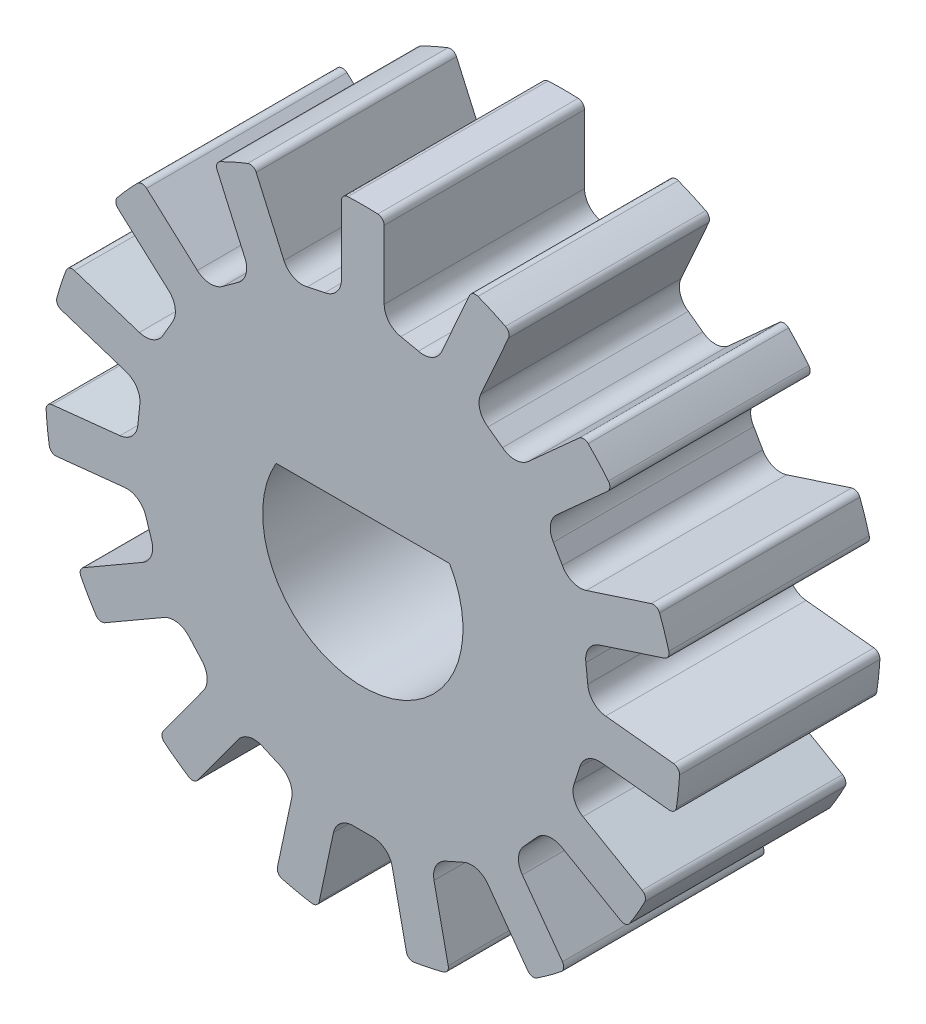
ISO-10303-21;
HEADER;
FILE_DESCRIPTION(('STEP AP214'),'2;1');
FILE_NAME('part.step','',(''),(''),'','','');
FILE_SCHEMA(('AUTOMOTIVE_DESIGN { 1 0 10303 214 1 1 1 1 }'));
ENDSEC;
DATA;
#1=APPLICATION_CONTEXT('core data for automotive mechanical design processes');
#2=APPLICATION_PROTOCOL_DEFINITION('international standard','automotive_design',2000,#1);
#3=PRODUCT_CONTEXT('',#1,'mechanical');
#4=PRODUCT('Part','Part','',(#3));
#5=PRODUCT_RELATED_PRODUCT_CATEGORY('part','',(#4));
#6=PRODUCT_DEFINITION_FORMATION('','',#4);
#7=PRODUCT_DEFINITION_CONTEXT('part definition',#1,'design');
#8=PRODUCT_DEFINITION('design','',#6,#7);
#9=PRODUCT_DEFINITION_SHAPE('','',#8);
#10=(LENGTH_UNIT() NAMED_UNIT(*) SI_UNIT(.MILLI.,.METRE.));
#11=(NAMED_UNIT(*) PLANE_ANGLE_UNIT() SI_UNIT($,.RADIAN.));
#12=(NAMED_UNIT(*) SI_UNIT($,.STERADIAN.) SOLID_ANGLE_UNIT());
#13=UNCERTAINTY_MEASURE_WITH_UNIT(LENGTH_MEASURE(1.E-05),#10,'distance_accuracy_value','');
#14=(GEOMETRIC_REPRESENTATION_CONTEXT(3) GLOBAL_UNCERTAINTY_ASSIGNED_CONTEXT((#13)) GLOBAL_UNIT_ASSIGNED_CONTEXT((#10,
#11,#12)) REPRESENTATION_CONTEXT('',''));
#15=CARTESIAN_POINT('',(0.,0.,0.));
#16=DIRECTION('',(0.,0.,1.));
#17=DIRECTION('',(1.,0.,0.));
#18=AXIS2_PLACEMENT_3D('',#15,#16,#17);
#19=CARTESIAN_POINT('',(0.,0.,3.));
#20=DIRECTION('',(0.,0.,1.));
#21=DIRECTION('',(1.,0.,0.));
#22=AXIS2_PLACEMENT_3D('',#19,#20,#21);
#23=PLANE('',#22);
#24=DIRECTION('',(-0.994521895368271,0.10452846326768,0.));
#25=VECTOR('',#24,1.);
#26=CARTESIAN_POINT('',(1.06759105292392,-0.433970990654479,3.));
#27=LINE('',#26,#25);
#28=CARTESIAN_POINT('',(4.58589901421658,-0.803760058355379,3.));
#29=VERTEX_POINT('',#28);
#30=CARTESIAN_POINT('',(3.56903057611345,-0.69688287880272,3.));
#31=VERTEX_POINT('',#30);
#32=EDGE_CURVE('E1733',#29,#31,#27,.T.);
#33=ORIENTED_EDGE('',*,*,#32,.F.);
#34=CARTESIAN_POINT('',(4.59635186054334,-0.704307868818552,3.));
#35=DIRECTION('',(0.,0.,1.));
#36=DIRECTION('',(1.,0.,0.));
#37=AXIS2_PLACEMENT_3D('',#34,#35,#36);
#38=CIRCLE('',#37,0.1);
#39=CARTESIAN_POINT('',(4.69519813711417,-0.719454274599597,3.));
#40=VERTEX_POINT('',#39);
#41=EDGE_CURVE('E1185',#29,#40,#38,.T.);
#42=ORIENTED_EDGE('',*,*,#41,.T.);
#43=CARTESIAN_POINT('',(0.,0.,3.));
#44=DIRECTION('',(0.,0.,1.));
#45=DIRECTION('',(1.,0.,0.));
#46=AXIS2_PLACEMENT_3D('',#43,#44,#45);
#47=CIRCLE('',#46,4.75);
#48=CARTESIAN_POINT('',(4.74217974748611,-0.272454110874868,3.));
#49=VERTEX_POINT('',#48);
#50=EDGE_CURVE('E1439',#40,#49,#47,.T.);
#51=ORIENTED_EDGE('',*,*,#50,.T.);
#52=CARTESIAN_POINT('',(4.64234438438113,-0.266718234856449,3.));
#53=DIRECTION('',(0.,0.,1.));
#54=DIRECTION('',(1.,0.,0.));
#55=AXIS2_PLACEMENT_3D('',#52,#53,#54);
#56=CIRCLE('',#55,0.1);
#57=CARTESIAN_POINT('',(4.6527972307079,-0.167266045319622,3.));
#58=VERTEX_POINT('',#57);
#59=EDGE_CURVE('E1157',#49,#58,#56,.T.);
#60=ORIENTED_EDGE('',*,*,#59,.T.);
#61=DIRECTION('',(-0.994521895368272,0.104528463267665,0.));
#62=VECTOR('',#61,1.);
#63=CARTESIAN_POINT('',(1.13448926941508,0.202523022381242,3.));
#64=LINE('',#63,#62);
#65=CARTESIAN_POINT('',(3.63592879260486,-0.0603888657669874,3.));
#66=VERTEX_POINT('',#65);
#67=EDGE_CURVE('E1514',#58,#66,#64,.T.);
#68=ORIENTED_EDGE('',*,*,#67,.T.);
#69=CARTESIAN_POINT('',(3.66728733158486,0.237967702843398,3.));
#70=DIRECTION('',(0.,0.,1.));
#71=DIRECTION('',(1.,0.,0.));
#72=AXIS2_PLACEMENT_3D('',#69,#70,#71);
#73=CIRCLE('',#72,0.299999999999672);
#74=CARTESIAN_POINT('',(3.36791693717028,0.218541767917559,3.));
#75=VERTEX_POINT('',#74);
#76=EDGE_CURVE('E1734',#66,#75,#73,.F.);
#77=ORIENTED_EDGE('',*,*,#76,.T.);
#78=DIRECTION('',(0.104528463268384,-0.994521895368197,0.));
#79=VECTOR('',#78,1.);
#80=CARTESIAN_POINT('',(4.45487725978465,-10.1231948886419,3.));
#81=LINE('',#80,#79);
#82=CARTESIAN_POINT('',(3.33975726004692,0.486463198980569,3.));
#83=VERTEX_POINT('',#82);
#84=EDGE_CURVE('E1730',#83,#75,#81,.T.);
#85=ORIENTED_EDGE('',*,*,#84,.F.);
#86=CARTESIAN_POINT('',(3.63662457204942,0.52970437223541,3.));
#87=DIRECTION('',(0.,0.,1.));
#88=DIRECTION('',(1.,0.,0.));
#89=AXIS2_PLACEMENT_3D('',#86,#87,#88);
#90=CIRCLE('',#89,0.300000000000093);
#91=CARTESIAN_POINT('',(3.54391947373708,0.815021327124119,3.));
#92=VERTEX_POINT('',#91);
#93=EDGE_CURVE('E1727',#92,#83,#90,.T.);
#94=ORIENTED_EDGE('',*,*,#93,.F.);
#95=DIRECTION('',(-0.951056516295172,-0.309016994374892,0.));
#96=VECTOR('',#95,1.);
#97=CARTESIAN_POINT('',(-3.01385519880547,-1.31572882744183,3.));
#98=LINE('',#97,#96);
#99=CARTESIAN_POINT('',(4.51634588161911,1.13098182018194,3.));
#100=VERTEX_POINT('',#99);
#101=EDGE_CURVE('E1720',#100,#92,#98,.T.);
#102=ORIENTED_EDGE('',*,*,#101,.F.);
#103=CARTESIAN_POINT('',(4.48544418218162,1.22608747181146,3.));
#104=DIRECTION('',(0.,0.,1.));
#105=DIRECTION('',(1.,0.,0.));
#106=AXIS2_PLACEMENT_3D('',#103,#104,#105);
#107=CIRCLE('',#106,0.1);
#108=CARTESIAN_POINT('',(4.58190534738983,1.25245494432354,3.));
#109=VERTEX_POINT('',#108);
#110=EDGE_CURVE('E1155',#100,#109,#107,.T.);
#111=ORIENTED_EDGE('',*,*,#110,.T.);
#112=CARTESIAN_POINT('',(4.44301383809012,1.67991905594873,3.));
#113=VERTEX_POINT('',#112);
#114=EDGE_CURVE('E1127',#109,#113,#47,.T.);
#115=ORIENTED_EDGE('',*,*,#114,.T.);
#116=CARTESIAN_POINT('',(4.34947670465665,1.64455233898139,3.));
#117=DIRECTION('',(0.,0.,1.));
#118=DIRECTION('',(1.,0.,0.));
#119=AXIS2_PLACEMENT_3D('',#116,#117,#118);
#120=CIRCLE('',#119,0.1);
#121=CARTESIAN_POINT('',(4.31857500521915,1.73965799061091,3.));
#122=VERTEX_POINT('',#121);
#123=EDGE_CURVE('E1153',#113,#122,#120,.T.);
#124=ORIENTED_EDGE('',*,*,#123,.T.);
#125=DIRECTION('',(-0.951056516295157,-0.309016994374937,0.));
#126=VECTOR('',#125,1.);
#127=CARTESIAN_POINT('',(-3.21162607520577,-0.707052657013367,3.));
#128=LINE('',#127,#126);
#129=CARTESIAN_POINT('',(3.34614859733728,1.42369749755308,3.));
#130=VERTEX_POINT('',#129);
#131=EDGE_CURVE('E1497',#122,#130,#128,.T.);
#132=ORIENTED_EDGE('',*,*,#131,.T.);
#133=CARTESIAN_POINT('',(3.25344349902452,1.70901445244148,3.));
#134=DIRECTION('',(0.,0.,1.));
#135=DIRECTION('',(1.,0.,0.));
#136=AXIS2_PLACEMENT_3D('',#133,#134,#135);
#137=CIRCLE('',#136,0.299999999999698);
#138=CARTESIAN_POINT('',(2.9878562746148,1.569503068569,3.));
#139=VERTEX_POINT('',#138);
#140=EDGE_CURVE('E1721',#130,#139,#137,.F.);
#141=ORIENTED_EDGE('',*,*,#140,.T.);
#142=DIRECTION('',(0.500000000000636,-0.866025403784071,0.));
#143=VECTOR('',#142,1.);
#144=CARTESIAN_POINT('',(7.50672694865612,-6.25741053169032,3.));
#145=LINE('',#144,#143);
#146=CARTESIAN_POINT('',(2.85315766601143,1.80280790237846,3.));
#147=VERTEX_POINT('',#146);
#148=EDGE_CURVE('E1717',#147,#139,#145,.T.);
#149=ORIENTED_EDGE('',*,*,#148,.F.);
#150=CARTESIAN_POINT('',(3.10677168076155,1.96305749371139,3.));
#151=DIRECTION('',(0.,0.,1.));
#152=DIRECTION('',(1.,0.,0.));
#153=AXIS2_PLACEMENT_3D('',#150,#151,#152);
#154=CIRCLE('',#153,0.300000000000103);
#155=CARTESIAN_POINT('',(2.90603249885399,2.18600094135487,3.));
#156=VERTEX_POINT('',#155);
#157=EDGE_CURVE('E1714',#156,#147,#154,.T.);
#158=ORIENTED_EDGE('',*,*,#157,.F.);
#159=DIRECTION('',(-0.743144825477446,-0.669130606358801,0.));
#160=VECTOR('',#159,1.);
#161=CARTESIAN_POINT('',(-5.05257842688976,-4.97996452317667,3.));
#162=LINE('',#161,#160);
#163=CARTESIAN_POINT('',(3.66587551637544,2.87016666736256,3.));
#164=VERTEX_POINT('',#163);
#165=EDGE_CURVE('E1708',#164,#156,#162,.T.);
#166=ORIENTED_EDGE('',*,*,#165,.F.);
#167=CARTESIAN_POINT('',(3.59896245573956,2.9444811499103,3.));
#168=DIRECTION('',(0.,0.,1.));
#169=DIRECTION('',(1.,0.,0.));
#170=AXIS2_PLACEMENT_3D('',#167,#168,#169);
#171=CIRCLE('',#170,0.1);
#172=CARTESIAN_POINT('',(3.67635949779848,3.00780332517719,3.));
#173=VERTEX_POINT('',#172);
#174=EDGE_CURVE('E1151',#164,#173,#171,.T.);
#175=ORIENTED_EDGE('',*,*,#174,.T.);
#176=CARTESIAN_POINT('',(3.37561047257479,3.34181895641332,3.));
#177=VERTEX_POINT('',#176);
#178=EDGE_CURVE('E1121',#173,#177,#47,.T.);
#179=ORIENTED_EDGE('',*,*,#178,.T.);
#180=CARTESIAN_POINT('',(3.30454498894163,3.27146487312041,3.));
#181=DIRECTION('',(0.,0.,1.));
#182=DIRECTION('',(1.,0.,0.));
#183=AXIS2_PLACEMENT_3D('',#180,#181,#182);
#184=CIRCLE('',#183,0.1);
#185=CARTESIAN_POINT('',(3.23763192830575,3.34577935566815,3.));
#186=VERTEX_POINT('',#185);
#187=EDGE_CURVE('E1149',#177,#186,#184,.T.);
#188=ORIENTED_EDGE('',*,*,#187,.T.);
#189=DIRECTION('',(-0.743144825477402,-0.66913060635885,0.));
#190=VECTOR('',#189,1.);
#191=CARTESIAN_POINT('',(-5.48082201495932,-4.50435183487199,3.));
#192=LINE('',#191,#190);
#193=CARTESIAN_POINT('',(2.47778891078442,2.66161362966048,3.));
#194=VERTEX_POINT('',#193);
#195=EDGE_CURVE('E1472',#186,#194,#192,.T.);
#196=ORIENTED_EDGE('',*,*,#195,.T.);
#197=CARTESIAN_POINT('',(2.27704972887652,2.8845570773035,3.));
#198=DIRECTION('',(0.,0.,1.));
#199=DIRECTION('',(1.,0.,0.));
#200=AXIS2_PLACEMENT_3D('',#197,#198,#199);
#201=CIRCLE('',#200,0.29999999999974);
#202=CARTESIAN_POINT('',(2.09116811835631,2.64908303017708,3.));
#203=VERTEX_POINT('',#202);
#204=EDGE_CURVE('E1709',#194,#203,#201,.F.);
#205=ORIENTED_EDGE('',*,*,#204,.T.);
#206=DIRECTION('',(0.80901699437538,-0.587785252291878,0.));
#207=VECTOR('',#206,1.);
#208=CARTESIAN_POINT('',(7.01871480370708,-0.930989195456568,3.));
#209=LINE('',#208,#207);
#210=CARTESIAN_POINT('',(1.87322119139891,2.80743074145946,3.));
#211=VERTEX_POINT('',#210);
#212=EDGE_CURVE('E1705',#211,#203,#209,.T.);
#213=ORIENTED_EDGE('',*,*,#212,.F.);
#214=CARTESIAN_POINT('',(2.03972974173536,3.05698014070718,3.));
#215=DIRECTION('',(0.,0.,1.));
#216=DIRECTION('',(1.,0.,0.));
#217=AXIS2_PLACEMENT_3D('',#214,#215,#216);
#218=CIRCLE('',#217,0.300000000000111);
#219=CARTESIAN_POINT('',(1.76566610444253,3.17900113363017,3.));
#220=VERTEX_POINT('',#219);
#221=EDGE_CURVE('E1702',#220,#211,#218,.T.);
#222=ORIENTED_EDGE('',*,*,#221,.F.);
#223=DIRECTION('',(-0.406736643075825,-0.91354545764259,0.));
#224=VECTOR('',#223,1.);
#225=CARTESIAN_POINT('',(-3.64314544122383,-8.96938850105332,3.));
#226=LINE('',#225,#224);
#227=CARTESIAN_POINT('',(2.18154197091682,4.11307362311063,3.));
#228=VERTEX_POINT('',#227);
#229=EDGE_CURVE('E1692',#228,#220,#226,.T.);
#230=ORIENTED_EDGE('',*,*,#229,.F.);
#231=CARTESIAN_POINT('',(2.09018742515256,4.15374728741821,3.));
#232=DIRECTION('',(0.,0.,1.));
#233=DIRECTION('',(1.,0.,0.));
#234=AXIS2_PLACEMENT_3D('',#231,#232,#233);
#235=CIRCLE('',#234,0.1);
#236=CARTESIAN_POINT('',(2.13513769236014,4.24307518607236,3.));
#237=VERTEX_POINT('',#236);
#238=EDGE_CURVE('E1147',#228,#237,#235,.T.);
#239=ORIENTED_EDGE('',*,*,#238,.T.);
#240=CARTESIAN_POINT('',(1.72453338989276,4.42588799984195,3.));
#241=VERTEX_POINT('',#240);
#242=EDGE_CURVE('E1118',#237,#241,#47,.T.);
#243=ORIENTED_EDGE('',*,*,#242,.T.);
#244=CARTESIAN_POINT('',(1.68822742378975,4.3327114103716,3.));
#245=DIRECTION('',(0.,0.,1.));
#246=DIRECTION('',(1.,0.,0.));
#247=AXIS2_PLACEMENT_3D('',#244,#245,#246);
#248=CIRCLE('',#247,0.1);
#249=CARTESIAN_POINT('',(1.59687287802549,4.37338507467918,3.));
#250=VERTEX_POINT('',#249);
#251=EDGE_CURVE('E1145',#241,#250,#248,.T.);
#252=ORIENTED_EDGE('',*,*,#251,.T.);
#253=DIRECTION('',(-0.40673664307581,-0.913545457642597,0.));
#254=VECTOR('',#253,1.);
#255=CARTESIAN_POINT('',(-4.22781453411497,-8.70907704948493,3.));
#256=LINE('',#255,#254);
#257=CARTESIAN_POINT('',(1.18099701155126,3.4393125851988,3.));
#258=VERTEX_POINT('',#257);
#259=EDGE_CURVE('E1698',#250,#258,#256,.T.);
#260=ORIENTED_EDGE('',*,*,#259,.T.);
#261=CARTESIAN_POINT('',(0.906933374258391,3.56133357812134,3.));
#262=DIRECTION('',(0.,0.,1.));
#263=DIRECTION('',(1.,0.,0.));
#264=AXIS2_PLACEMENT_3D('',#261,#262,#263);
#265=CIRCLE('',#264,0.299999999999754);
#266=CARTESIAN_POINT('',(0.832897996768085,3.27061246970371,3.));
#267=VERTEX_POINT('',#266);
#268=EDGE_CURVE('E1693',#258,#267,#265,.F.);
#269=ORIENTED_EDGE('',*,*,#268,.T.);
#270=DIRECTION('',(0.978147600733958,-0.207911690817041,0.));
#271=VECTOR('',#270,1.);
#272=CARTESIAN_POINT('',(2.85510245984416,2.84077964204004,3.));
#273=LINE('',#272,#271);
#274=CARTESIAN_POINT('',(0.569387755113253,3.3266233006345,3.));
#275=VERTEX_POINT('',#274);
#276=EDGE_CURVE('E1689',#275,#267,#273,.T.);
#277=ORIENTED_EDGE('',*,*,#276,.F.);
#278=CARTESIAN_POINT('',(0.620000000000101,3.62232314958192,3.));
#279=DIRECTION('',(0.,0.,1.));
#280=DIRECTION('',(1.,0.,0.));
#281=AXIS2_PLACEMENT_3D('',#278,#279,#280);
#282=CIRCLE('',#281,0.300000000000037);
#283=CARTESIAN_POINT('',(0.320000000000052,3.62232314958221,3.));
#284=VERTEX_POINT('',#283);
#285=EDGE_CURVE('E1686',#284,#275,#282,.T.);
#286=ORIENTED_EDGE('',*,*,#285,.F.);
#287=DIRECTION('',(0.,-1.,0.));
#288=VECTOR('',#287,1.);
#289=CARTESIAN_POINT('',(0.31999999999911,-10.5914213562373,3.));
#290=LINE('',#289,#288);
#291=CARTESIAN_POINT('',(0.32000000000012,4.64479278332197,3.));
#292=VERTEX_POINT('',#291);
#293=EDGE_CURVE('E1092',#292,#284,#290,.T.);
#294=ORIENTED_EDGE('',*,*,#293,.F.);
#295=CARTESIAN_POINT('',(0.22000000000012,4.64479278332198,3.));
#296=DIRECTION('',(0.,0.,1.));
#297=DIRECTION('',(1.,0.,0.));
#298=AXIS2_PLACEMENT_3D('',#295,#296,#297);
#299=CIRCLE('',#298,0.1);
#300=CARTESIAN_POINT('',(0.224731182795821,4.74468080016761,3.));
#301=VERTEX_POINT('',#300);
#302=EDGE_CURVE('E1143',#292,#301,#299,.T.);
#303=ORIENTED_EDGE('',*,*,#302,.T.);
#304=CARTESIAN_POINT('',(-0.224731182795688,4.74468080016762,3.));
#305=VERTEX_POINT('',#304);
#306=EDGE_CURVE('E1122',#301,#305,#47,.T.);
#307=ORIENTED_EDGE('',*,*,#306,.T.);
#308=CARTESIAN_POINT('',(-0.219999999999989,4.64479278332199,3.));
#309=DIRECTION('',(0.,0.,1.));
#310=DIRECTION('',(1.,0.,0.));
#311=AXIS2_PLACEMENT_3D('',#308,#309,#310);
#312=CIRCLE('',#311,0.1);
#313=CARTESIAN_POINT('',(-0.319999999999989,4.64479278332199,3.));
#314=VERTEX_POINT('',#313);
#315=EDGE_CURVE('E1141',#305,#314,#312,.T.);
#316=ORIENTED_EDGE('',*,*,#315,.T.);
#317=DIRECTION('',(0.,-1.,0.));
#318=VECTOR('',#317,1.);
#319=CARTESIAN_POINT('',(-0.320000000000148,-10.5914213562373,3.));
#320=LINE('',#319,#318);
#321=CARTESIAN_POINT('',(-0.32,3.62232314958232,3.));
#322=VERTEX_POINT('',#321);
#323=EDGE_CURVE('E1682',#314,#322,#320,.T.);
#324=ORIENTED_EDGE('',*,*,#323,.T.);
#325=CARTESIAN_POINT('',(-0.620000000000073,3.62232314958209,3.));
#326=DIRECTION('',(0.,0.,1.));
#327=DIRECTION('',(1.,0.,0.));
#328=AXIS2_PLACEMENT_3D('',#325,#326,#327);
#329=CIRCLE('',#328,0.29999999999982);
#330=CARTESIAN_POINT('',(-0.56938775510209,3.32662330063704,3.));
#331=VERTEX_POINT('',#330);
#332=EDGE_CURVE('E1678',#322,#331,#329,.F.);
#333=ORIENTED_EDGE('',*,*,#332,.T.);
#334=DIRECTION('',(0.978147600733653,0.207911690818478,0.));
#335=VECTOR('',#334,1.);
#336=CARTESIAN_POINT('',(-2.85510245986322,2.84077964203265,3.));
#337=LINE('',#336,#335);
#338=CARTESIAN_POINT('',(-0.83289799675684,3.27061246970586,3.));
#339=VERTEX_POINT('',#338);
#340=EDGE_CURVE('E1090',#339,#331,#337,.T.);
#341=ORIENTED_EDGE('',*,*,#340,.F.);
#342=CARTESIAN_POINT('',(-0.906933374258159,3.56133357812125,3.));
#343=DIRECTION('',(0.,0.,1.));
#344=DIRECTION('',(1.,0.,0.));
#345=AXIS2_PLACEMENT_3D('',#342,#343,#344);
#346=CIRCLE('',#345,0.300000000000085);
#347=CARTESIAN_POINT('',(-1.18099701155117,3.43931258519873,3.));
#348=VERTEX_POINT('',#347);
#349=EDGE_CURVE('E1074',#348,#339,#346,.T.);
#350=ORIENTED_EDGE('',*,*,#349,.F.);
#351=DIRECTION('',(0.406736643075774,-0.913545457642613,0.));
#352=VECTOR('',#351,1.);
#353=CARTESIAN_POINT('',(4.22781453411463,-8.70907704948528,3.));
#354=LINE('',#353,#352);
#355=CARTESIAN_POINT('',(-1.5968728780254,4.37338507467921,3.));
#356=VERTEX_POINT('',#355);
#357=EDGE_CURVE('E1065',#356,#348,#354,.T.);
#358=ORIENTED_EDGE('',*,*,#357,.F.);
#359=CARTESIAN_POINT('',(-1.68822742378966,4.33271141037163,3.));
#360=DIRECTION('',(0.,0.,1.));
#361=DIRECTION('',(1.,0.,0.));
#362=AXIS2_PLACEMENT_3D('',#359,#360,#361);
#363=CIRCLE('',#362,0.1);
#364=CARTESIAN_POINT('',(-1.72453338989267,4.42588799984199,3.));
#365=VERTEX_POINT('',#364);
#366=EDGE_CURVE('E1139',#356,#365,#363,.T.);
#367=ORIENTED_EDGE('',*,*,#366,.T.);
#368=CARTESIAN_POINT('',(-2.13513769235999,4.24307518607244,3.));
#369=VERTEX_POINT('',#368);
#370=EDGE_CURVE('E1414',#365,#369,#47,.T.);
#371=ORIENTED_EDGE('',*,*,#370,.T.);
#372=CARTESIAN_POINT('',(-2.09018742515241,4.15374728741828,3.));
#373=DIRECTION('',(0.,0.,1.));
#374=DIRECTION('',(1.,0.,0.));
#375=AXIS2_PLACEMENT_3D('',#372,#373,#374);
#376=CIRCLE('',#375,0.1);
#377=CARTESIAN_POINT('',(-2.18154197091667,4.11307362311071,3.));
#378=VERTEX_POINT('',#377);
#379=EDGE_CURVE('E1137',#369,#378,#376,.T.);
#380=ORIENTED_EDGE('',*,*,#379,.T.);
#381=DIRECTION('',(0.406736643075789,-0.913545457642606,0.));
#382=VECTOR('',#381,1.);
#383=CARTESIAN_POINT('',(3.64314544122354,-8.96938850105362,3.));
#384=LINE('',#383,#382);
#385=CARTESIAN_POINT('',(-1.76566610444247,3.17900113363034,3.));
#386=VERTEX_POINT('',#385);
#387=EDGE_CURVE('E1674',#378,#386,#384,.T.);
#388=ORIENTED_EDGE('',*,*,#387,.T.);
#389=CARTESIAN_POINT('',(-2.03972974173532,3.05698014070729,3.));
#390=DIRECTION('',(0.,0.,1.));
#391=DIRECTION('',(1.,0.,0.));
#392=AXIS2_PLACEMENT_3D('',#389,#390,#391);
#393=CIRCLE('',#392,0.299999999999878);
#394=CARTESIAN_POINT('',(-1.87322119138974,2.80743074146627,3.));
#395=VERTEX_POINT('',#394);
#396=EDGE_CURVE('E1862',#386,#395,#393,.F.);
#397=ORIENTED_EDGE('',*,*,#396,.T.);
#398=DIRECTION('',(0.809016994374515,0.587785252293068,0.));
#399=VECTOR('',#398,1.);
#400=CARTESIAN_POINT('',(-7.01871480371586,-0.930989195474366,3.));
#401=LINE('',#400,#399);
#402=CARTESIAN_POINT('',(-2.09116811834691,2.64908303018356,3.));
#403=VERTEX_POINT('',#402);
#404=EDGE_CURVE('E1676',#403,#395,#401,.T.);
#405=ORIENTED_EDGE('',*,*,#404,.F.);
#406=CARTESIAN_POINT('',(-2.27704972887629,2.88455707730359,3.));
#407=DIRECTION('',(0.,0.,1.));
#408=DIRECTION('',(1.,0.,0.));
#409=AXIS2_PLACEMENT_3D('',#406,#407,#408);
#410=CIRCLE('',#409,0.300000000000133);
#411=CARTESIAN_POINT('',(-2.47778891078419,2.66161362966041,3.));
#412=VERTEX_POINT('',#411);
#413=EDGE_CURVE('E1857',#412,#403,#410,.T.);
#414=ORIENTED_EDGE('',*,*,#413,.F.);
#415=DIRECTION('',(0.743144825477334,-0.669130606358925,0.));
#416=VECTOR('',#415,1.);
#417=CARTESIAN_POINT('',(5.48082201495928,-4.50435183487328,3.));
#418=LINE('',#417,#416);
#419=CARTESIAN_POINT('',(-3.2376319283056,3.34577935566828,3.));
#420=VERTEX_POINT('',#419);
#421=EDGE_CURVE('E1850',#420,#412,#418,.T.);
#422=ORIENTED_EDGE('',*,*,#421,.F.);
#423=CARTESIAN_POINT('',(-3.30454498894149,3.27146487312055,3.));
#424=DIRECTION('',(0.,0.,1.));
#425=DIRECTION('',(1.,0.,0.));
#426=AXIS2_PLACEMENT_3D('',#423,#424,#425);
#427=CIRCLE('',#426,0.1);
#428=CARTESIAN_POINT('',(-3.37561047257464,3.34181895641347,3.));
#429=VERTEX_POINT('',#428);
#430=EDGE_CURVE('E1126',#420,#429,#427,.T.);
#431=ORIENTED_EDGE('',*,*,#430,.T.);
#432=CARTESIAN_POINT('',(-3.67635949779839,3.00780332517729,3.));
#433=VERTEX_POINT('',#432);
#434=EDGE_CURVE('E1411',#429,#433,#47,.T.);
#435=ORIENTED_EDGE('',*,*,#434,.T.);
#436=CARTESIAN_POINT('',(-3.59896245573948,2.9444811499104,3.));
#437=DIRECTION('',(0.,0.,1.));
#438=DIRECTION('',(1.,0.,0.));
#439=AXIS2_PLACEMENT_3D('',#436,#437,#438);
#440=CIRCLE('',#439,0.1);
#441=CARTESIAN_POINT('',(-3.66587551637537,2.87016666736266,3.));
#442=VERTEX_POINT('',#441);
#443=EDGE_CURVE('E1129',#433,#442,#440,.T.);
#444=ORIENTED_EDGE('',*,*,#443,.T.);
#445=DIRECTION('',(0.743144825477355,-0.669130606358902,0.));
#446=VECTOR('',#445,1.);
#447=CARTESIAN_POINT('',(5.05257842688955,-4.97996452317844,3.));
#448=LINE('',#447,#446);
#449=CARTESIAN_POINT('',(-2.90603249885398,2.18600094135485,3.));
#450=VERTEX_POINT('',#449);
#451=EDGE_CURVE('E1392',#442,#450,#448,.T.);
#452=ORIENTED_EDGE('',*,*,#451,.T.);
#453=CARTESIAN_POINT('',(-3.10677168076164,1.96305749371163,3.));
#454=DIRECTION('',(0.,0.,1.));
#455=DIRECTION('',(1.,0.,0.));
#456=AXIS2_PLACEMENT_3D('',#453,#454,#455);
#457=CIRCLE('',#456,0.299999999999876);
#458=CARTESIAN_POINT('',(-2.85315766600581,1.80280790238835,3.));
#459=VERTEX_POINT('',#458);
#460=EDGE_CURVE('E1851',#450,#459,#457,.F.);
#461=ORIENTED_EDGE('',*,*,#460,.T.);
#462=DIRECTION('',(0.499999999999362,0.866025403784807,0.));
#463=VECTOR('',#462,1.);
#464=CARTESIAN_POINT('',(-7.50672694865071,-6.25741053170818,3.));
#465=LINE('',#464,#463);
#466=CARTESIAN_POINT('',(-2.98785627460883,1.56950306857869,3.));
#467=VERTEX_POINT('',#466);
#468=EDGE_CURVE('E1847',#467,#459,#465,.T.);
#469=ORIENTED_EDGE('',*,*,#468,.F.);
#470=CARTESIAN_POINT('',(-3.25344349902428,1.70901445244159,3.));
#471=DIRECTION('',(0.,0.,1.));
#472=DIRECTION('',(1.,0.,0.));
#473=AXIS2_PLACEMENT_3D('',#470,#471,#472);
#474=CIRCLE('',#473,0.300000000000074);
#475=CARTESIAN_POINT('',(-3.34614859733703,1.42369749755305,3.));
#476=VERTEX_POINT('',#475);
#477=EDGE_CURVE('E1844',#476,#467,#474,.T.);
#478=ORIENTED_EDGE('',*,*,#477,.F.);
#479=DIRECTION('',(0.951056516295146,-0.309016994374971,0.));
#480=VECTOR('',#479,1.);
#481=CARTESIAN_POINT('',(3.21162607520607,-0.707052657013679,3.));
#482=LINE('',#481,#480);
#483=CARTESIAN_POINT('',(-4.31857500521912,1.73965799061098,3.));
#484=VERTEX_POINT('',#483);
#485=EDGE_CURVE('E1837',#484,#476,#482,.T.);
#486=ORIENTED_EDGE('',*,*,#485,.F.);
#487=CARTESIAN_POINT('',(-4.34947670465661,1.64455233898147,3.));
#488=DIRECTION('',(0.,0.,1.));
#489=DIRECTION('',(1.,0.,0.));
#490=AXIS2_PLACEMENT_3D('',#487,#488,#489);
#491=CIRCLE('',#490,0.1);
#492=CARTESIAN_POINT('',(-4.44301383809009,1.67991905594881,3.));
#493=VERTEX_POINT('',#492);
#494=EDGE_CURVE('E1131',#484,#493,#491,.T.);
#495=ORIENTED_EDGE('',*,*,#494,.T.);
#496=CARTESIAN_POINT('',(-4.58190534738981,1.25245494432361,3.));
#497=VERTEX_POINT('',#496);
#498=EDGE_CURVE('E1415',#493,#497,#47,.T.);
#499=ORIENTED_EDGE('',*,*,#498,.T.);
#500=CARTESIAN_POINT('',(-4.4854441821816,1.22608747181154,3.));
#501=DIRECTION('',(0.,0.,1.));
#502=DIRECTION('',(1.,0.,0.));
#503=AXIS2_PLACEMENT_3D('',#500,#501,#502);
#504=CIRCLE('',#503,0.1);
#505=CARTESIAN_POINT('',(-4.5163458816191,1.13098182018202,3.));
#506=VERTEX_POINT('',#505);
#507=EDGE_CURVE('E1167',#497,#506,#504,.T.);
#508=ORIENTED_EDGE('',*,*,#507,.T.);
#509=DIRECTION('',(0.951056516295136,-0.309016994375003,0.));
#510=VECTOR('',#509,1.);
#511=CARTESIAN_POINT('',(3.01385519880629,-1.31572882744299,3.));
#512=LINE('',#511,#510);
#513=CARTESIAN_POINT('',(-3.5439194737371,0.815021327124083,3.));
#514=VERTEX_POINT('',#513);
#515=EDGE_CURVE('E1649',#506,#514,#512,.T.);
#516=ORIENTED_EDGE('',*,*,#515,.T.);
#517=CARTESIAN_POINT('',(-3.63662457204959,0.529704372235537,3.));
#518=DIRECTION('',(0.,0.,1.));
#519=DIRECTION('',(1.,0.,0.));
#520=AXIS2_PLACEMENT_3D('',#517,#518,#519);
#521=CIRCLE('',#520,0.299999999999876);
#522=CARTESIAN_POINT('',(-3.33975726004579,0.486463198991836,3.));
#523=VERTEX_POINT('',#522);
#524=EDGE_CURVE('E1838',#514,#523,#521,.F.);
#525=ORIENTED_EDGE('',*,*,#524,.T.);
#526=DIRECTION('',(0.104528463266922,0.99452189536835,0.));
#527=VECTOR('',#526,1.);
#528=CARTESIAN_POINT('',(-4.45487725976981,-10.1231948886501,3.));
#529=LINE('',#528,#527);
#530=CARTESIAN_POINT('',(-3.36791693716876,0.218541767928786,3.));
#531=VERTEX_POINT('',#530);
#532=EDGE_CURVE('E1834',#531,#523,#529,.T.);
#533=ORIENTED_EDGE('',*,*,#532,.F.);
#534=CARTESIAN_POINT('',(-3.66728733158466,0.23796770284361,3.));
#535=DIRECTION('',(0.,0.,1.));
#536=DIRECTION('',(1.,0.,0.));
#537=AXIS2_PLACEMENT_3D('',#534,#535,#536);
#538=CIRCLE('',#537,0.300000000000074);
#539=CARTESIAN_POINT('',(-3.63592879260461,-0.0603888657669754,3.));
#540=VERTEX_POINT('',#539);
#541=EDGE_CURVE('E1831',#540,#531,#538,.T.);
#542=ORIENTED_EDGE('',*,*,#541,.F.);
#543=DIRECTION('',(0.994521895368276,0.104528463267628,0.));
#544=VECTOR('',#543,1.);
#545=CARTESIAN_POINT('',(-1.13448926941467,0.202523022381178,3.));
#546=LINE('',#545,#544);
#547=CARTESIAN_POINT('',(-4.6527972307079,-0.167266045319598,3.));
#548=VERTEX_POINT('',#547);
#549=EDGE_CURVE('E1824',#548,#540,#546,.T.);
#550=ORIENTED_EDGE('',*,*,#549,.F.);
#551=CARTESIAN_POINT('',(-4.64234438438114,-0.266718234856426,3.));
#552=DIRECTION('',(0.,0.,1.));
#553=DIRECTION('',(1.,0.,0.));
#554=AXIS2_PLACEMENT_3D('',#551,#552,#553);
#555=CIRCLE('',#554,0.1);
#556=CARTESIAN_POINT('',(-4.74217974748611,-0.272454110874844,3.));
#557=VERTEX_POINT('',#556);
#558=EDGE_CURVE('E1133',#548,#557,#555,.T.);
#559=ORIENTED_EDGE('',*,*,#558,.T.);
#560=CARTESIAN_POINT('',(-4.69519813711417,-0.719454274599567,3.));
#561=VERTEX_POINT('',#560);
#562=EDGE_CURVE('E1418',#557,#561,#47,.T.);
#563=ORIENTED_EDGE('',*,*,#562,.T.);
#564=CARTESIAN_POINT('',(-4.59635186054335,-0.704307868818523,3.));
#565=DIRECTION('',(0.,0.,1.));
#566=DIRECTION('',(1.,0.,0.));
#567=AXIS2_PLACEMENT_3D('',#564,#565,#566);
#568=CIRCLE('',#567,0.1);
#569=CARTESIAN_POINT('',(-4.58589901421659,-0.803760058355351,3.));
#570=VERTEX_POINT('',#569);
#571=EDGE_CURVE('E1169',#561,#570,#568,.T.);
#572=ORIENTED_EDGE('',*,*,#571,.T.);
#573=DIRECTION('',(0.994521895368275,0.104528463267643,0.));
#574=VECTOR('',#573,1.);
#575=CARTESIAN_POINT('',(-1.06759105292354,-0.43397099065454,3.));
#576=LINE('',#575,#574);
#577=CARTESIAN_POINT('',(-3.56903057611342,-0.696882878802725,3.));
#578=VERTEX_POINT('',#577);
#579=EDGE_CURVE('E1633',#570,#578,#576,.T.);
#580=ORIENTED_EDGE('',*,*,#579,.T.);
#581=CARTESIAN_POINT('',(-3.53767203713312,-0.995239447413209,3.));
#582=DIRECTION('',(0.,0.,1.));
#583=DIRECTION('',(1.,0.,0.));
#584=AXIS2_PLACEMENT_3D('',#581,#582,#583);
#585=CIRCLE('',#584,0.29999999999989);
#586=CARTESIAN_POINT('',(-3.24888248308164,-0.913995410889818,3.));
#587=VERTEX_POINT('',#586);
#588=EDGE_CURVE('E1825',#578,#587,#585,.F.);
#589=ORIENTED_EDGE('',*,*,#588,.T.);
#590=DIRECTION('',(-0.309016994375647,0.951056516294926,0.));
#591=VECTOR('',#590,1.);
#592=CARTESIAN_POINT('',(-0.0945176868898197,-10.6221320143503,3.));
#593=LINE('',#592,#591);
#594=CARTESIAN_POINT('',(-3.16563416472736,-1.17020738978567,3.));
#595=VERTEX_POINT('',#594);
#596=EDGE_CURVE('E1821',#595,#587,#593,.T.);
#597=ORIENTED_EDGE('',*,*,#596,.F.);
#598=CARTESIAN_POINT('',(-3.44702386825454,-1.27422582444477,3.));
#599=DIRECTION('',(0.,0.,1.));
#600=DIRECTION('',(1.,0.,0.));
#601=AXIS2_PLACEMENT_3D('',#598,#599,#600);
#602=CIRCLE('',#601,0.300000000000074);
#603=CARTESIAN_POINT('',(-3.29702386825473,-1.5340334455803,3.));
#604=VERTEX_POINT('',#603);
#605=EDGE_CURVE('E1818',#604,#595,#602,.T.);
#606=ORIENTED_EDGE('',*,*,#605,.F.);
#607=DIRECTION('',(0.866025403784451,0.499999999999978,0.));
#608=VECTOR('',#607,1.);
#609=CARTESIAN_POINT('',(-4.74621997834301,-2.37072720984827,3.));
#610=LINE('',#609,#608);
#611=CARTESIAN_POINT('',(-4.18250854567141,-2.04526826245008,3.));
#612=VERTEX_POINT('',#611);
#613=EDGE_CURVE('E1811',#612,#604,#610,.T.);
#614=ORIENTED_EDGE('',*,*,#613,.F.);
#615=CARTESIAN_POINT('',(-4.13250854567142,-2.13187080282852,3.));
#616=DIRECTION('',(0.,0.,1.));
#617=DIRECTION('',(1.,0.,0.));
#618=AXIS2_PLACEMENT_3D('',#615,#616,#617);
#619=CIRCLE('',#618,0.1);
#620=CARTESIAN_POINT('',(-4.22137969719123,-2.17771748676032,3.));
#621=VERTEX_POINT('',#620);
#622=EDGE_CURVE('E1135',#612,#621,#619,.T.);
#623=ORIENTED_EDGE('',*,*,#622,.T.);
#624=CARTESIAN_POINT('',(-3.99664851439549,-2.56696331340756,3.));
#625=VERTEX_POINT('',#624);
#626=EDGE_CURVE('E1421',#621,#625,#47,.T.);
#627=ORIENTED_EDGE('',*,*,#626,.T.);
#628=CARTESIAN_POINT('',(-3.91250854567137,-2.51292198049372,3.));
#629=DIRECTION('',(0.,0.,1.));
#630=DIRECTION('',(1.,0.,0.));
#631=AXIS2_PLACEMENT_3D('',#628,#629,#630);
#632=CIRCLE('',#631,0.1);
#633=CARTESIAN_POINT('',(-3.86250854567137,-2.59952452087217,3.));
#634=VERTEX_POINT('',#633);
#635=EDGE_CURVE('E1171',#625,#634,#632,.T.);
#636=ORIENTED_EDGE('',*,*,#635,.T.);
#637=DIRECTION('',(0.866025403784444,0.499999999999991,0.));
#638=VECTOR('',#637,1.);
#639=CARTESIAN_POINT('',(-4.4262199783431,-2.92498346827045,3.));
#640=LINE('',#639,#638);
#641=CARTESIAN_POINT('',(-2.9770238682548,-2.08828970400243,3.));
#642=VERTEX_POINT('',#641);
#643=EDGE_CURVE('E1616',#634,#642,#640,.T.);
#644=ORIENTED_EDGE('',*,*,#643,.T.);
#645=CARTESIAN_POINT('',(-2.82702386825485,-2.34809732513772,3.));
#646=DIRECTION('',(0.,0.,1.));
#647=DIRECTION('',(1.,0.,0.));
#648=AXIS2_PLACEMENT_3D('',#645,#646,#647);
#649=CIRCLE('',#648,0.299999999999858);
#650=CARTESIAN_POINT('',(-2.59624640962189,-2.15641591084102,3.));
#651=VERTEX_POINT('',#650);
#652=EDGE_CURVE('E1812',#642,#651,#649,.F.);
#653=ORIENTED_EDGE('',*,*,#652,.T.);
#654=DIRECTION('',(-0.669130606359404,0.743144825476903,0.));
#655=VECTOR('',#654,1.);
#656=CARTESIAN_POINT('',(2.76058477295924,-8.1057796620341,3.));
#657=LINE('',#656,#655);
#658=CARTESIAN_POINT('',(-2.41598448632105,-2.35661705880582,3.));
#659=VERTEX_POINT('',#658);
#660=EDGE_CURVE('E1808',#659,#651,#657,.T.);
#661=ORIENTED_EDGE('',*,*,#660,.F.);
#662=CARTESIAN_POINT('',(-2.63073866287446,-2.56609413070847,3.));
#663=DIRECTION('',(0.,0.,1.));
#664=DIRECTION('',(1.,0.,0.));
#665=AXIS2_PLACEMENT_3D('',#662,#663,#664);
#666=CIRCLE('',#665,0.300000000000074);
#667=CARTESIAN_POINT('',(-2.38803356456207,-2.74242970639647,3.));
#668=VERTEX_POINT('',#667);
#669=EDGE_CURVE('E1805',#668,#659,#666,.T.);
#670=ORIENTED_EDGE('',*,*,#669,.F.);
#671=DIRECTION('',(0.587785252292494,0.809016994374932,0.));
#672=VECTOR('',#671,1.);
#673=CARTESIAN_POINT('',(-5.29540558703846,-6.74408399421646,3.));
#674=LINE('',#673,#672);
#675=CARTESIAN_POINT('',(-2.98902613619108,-3.56962501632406,3.));
#676=VERTEX_POINT('',#675);
#677=EDGE_CURVE('E1798',#676,#668,#674,.T.);
#678=ORIENTED_EDGE('',*,*,#677,.F.);
#679=CARTESIAN_POINT('',(-2.90812443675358,-3.62840354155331,3.));
#680=DIRECTION('',(0.,0.,1.));
#681=DIRECTION('',(1.,0.,0.));
#682=AXIS2_PLACEMENT_3D('',#679,#680,#681);
#683=CIRCLE('',#682,0.1);
#684=CARTESIAN_POINT('',(-2.9706647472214,-3.70643372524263,3.));
#685=VERTEX_POINT('',#684);
#686=EDGE_CURVE('E1165',#676,#685,#683,.T.);
#687=ORIENTED_EDGE('',*,*,#686,.T.);
#688=CARTESIAN_POINT('',(-2.60704205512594,-3.97062107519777,3.));
#689=VERTEX_POINT('',#688);
#690=EDGE_CURVE('E1424',#685,#689,#47,.T.);
#691=ORIENTED_EDGE('',*,*,#690,.T.);
#692=CARTESIAN_POINT('',(-2.55215695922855,-3.88702905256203,3.));
#693=DIRECTION('',(0.,0.,1.));
#694=DIRECTION('',(1.,0.,0.));
#695=AXIS2_PLACEMENT_3D('',#692,#693,#694);
#696=CIRCLE('',#695,0.1);
#697=CARTESIAN_POINT('',(-2.47125525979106,-3.94580757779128,3.));
#698=VERTEX_POINT('',#697);
#699=EDGE_CURVE('E1173',#689,#698,#696,.T.);
#700=ORIENTED_EDGE('',*,*,#699,.T.);
#701=DIRECTION('',(0.587785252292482,0.809016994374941,0.));
#702=VECTOR('',#701,1.);
#703=CARTESIAN_POINT('',(-4.77763471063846,-7.1202665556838,3.));
#704=LINE('',#703,#702);
#705=CARTESIAN_POINT('',(-1.87026268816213,-3.11861226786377,3.));
#706=VERTEX_POINT('',#705);
#707=EDGE_CURVE('E1599',#698,#706,#704,.T.);
#708=ORIENTED_EDGE('',*,*,#707,.T.);
#709=CARTESIAN_POINT('',(-1.62755758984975,-3.29494784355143,3.));
#710=DIRECTION('',(0.,0.,1.));
#711=DIRECTION('',(1.,0.,0.));
#712=AXIS2_PLACEMENT_3D('',#709,#710,#711);
#713=CIRCLE('',#712,0.299999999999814);
#714=CARTESIAN_POINT('',(-1.49469574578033,-3.02597250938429,3.));
#715=VERTEX_POINT('',#714);
#716=EDGE_CURVE('E1799',#706,#715,#713,.F.);
#717=ORIENTED_EDGE('',*,*,#716,.T.);
#718=DIRECTION('',(-0.9135454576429,0.406736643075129,0.));
#719=VECTOR('',#718,1.);
#720=CARTESIAN_POINT('',(2.5638375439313,-4.83294795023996,3.));
#721=LINE('',#720,#719);
#722=CARTESIAN_POINT('',(-1.2485891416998,-3.1355462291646,3.));
#723=VERTEX_POINT('',#722);
#724=EDGE_CURVE('E1795',#723,#715,#721,.T.);
#725=ORIENTED_EDGE('',*,*,#724,.F.);
#726=CARTESIAN_POINT('',(-1.35957484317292,-3.41426144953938,3.));
#727=DIRECTION('',(0.,0.,1.));
#728=DIRECTION('',(1.,0.,0.));
#729=AXIS2_PLACEMENT_3D('',#726,#727,#728);
#730=CIRCLE('',#729,0.300000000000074);
#731=CARTESIAN_POINT('',(-1.06613056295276,-3.47663495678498,3.));
#732=VERTEX_POINT('',#731);
#733=EDGE_CURVE('E1792',#732,#723,#730,.T.);
#734=ORIENTED_EDGE('',*,*,#733,.F.);
#735=DIRECTION('',(0.207911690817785,0.9781476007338,0.));
#736=VECTOR('',#735,1.);
#737=CARTESIAN_POINT('',(-2.46696681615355,-10.0670513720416,3.));
#738=LINE('',#737,#736);
#739=CARTESIAN_POINT('',(-1.27871395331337,-4.47676117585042,3.));
#740=VERTEX_POINT('',#739);
#741=EDGE_CURVE('E1785',#740,#732,#738,.T.);
#742=ORIENTED_EDGE('',*,*,#741,.F.);
#743=CARTESIAN_POINT('',(-1.18089919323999,-4.4975523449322,3.));
#744=DIRECTION('',(0.,0.,1.));
#745=DIRECTION('',(1.,0.,0.));
#746=AXIS2_PLACEMENT_3D('',#743,#744,#745);
#747=CIRCLE('',#746,0.1);
#748=CARTESIAN_POINT('',(-1.20629487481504,-4.59427390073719,3.));
#749=VERTEX_POINT('',#748);
#750=EDGE_CURVE('E1175',#740,#749,#747,.T.);
#751=ORIENTED_EDGE('',*,*,#750,.T.);
#752=CARTESIAN_POINT('',(-0.766654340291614,-4.68772238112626,3.));
#753=VERTEX_POINT('',#752);
#754=EDGE_CURVE('E1427',#749,#753,#47,.T.);
#755=ORIENTED_EDGE('',*,*,#754,.T.);
#756=CARTESIAN_POINT('',(-0.750514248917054,-4.58903348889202,3.));
#757=DIRECTION('',(0.,0.,1.));
#758=DIRECTION('',(1.,0.,0.));
#759=AXIS2_PLACEMENT_3D('',#756,#757,#758);
#760=CIRCLE('',#759,0.1);
#761=CARTESIAN_POINT('',(-0.652699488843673,-4.6098246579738,3.));
#762=VERTEX_POINT('',#761);
#763=EDGE_CURVE('E1177',#753,#762,#760,.T.);
#764=ORIENTED_EDGE('',*,*,#763,.T.);
#765=DIRECTION('',(0.20791169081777,0.978147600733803,0.));
#766=VECTOR('',#765,1.);
#767=CARTESIAN_POINT('',(-1.84095235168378,-10.200114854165,3.));
#768=LINE('',#767,#766);
#769=CARTESIAN_POINT('',(-0.440116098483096,-3.60969843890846,3.));
#770=VERTEX_POINT('',#769);
#771=EDGE_CURVE('E1582',#762,#770,#768,.T.);
#772=ORIENTED_EDGE('',*,*,#771,.T.);
#773=CARTESIAN_POINT('',(-0.146671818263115,-3.67207194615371,3.));
#774=DIRECTION('',(0.,0.,1.));
#775=DIRECTION('',(1.,0.,0.));
#776=AXIS2_PLACEMENT_3D('',#773,#774,#775);
#777=CIRCLE('',#776,0.299999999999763);
#778=CARTESIAN_POINT('',(-0.134698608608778,-3.37231097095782,3.));
#779=VERTEX_POINT('',#778);
#780=EDGE_CURVE('E1786',#770,#779,#777,.F.);
#781=ORIENTED_EDGE('',*,*,#780,.T.);
#782=DIRECTION('',(-1.,-7.34077650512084E-13,0.));
#783=VECTOR('',#782,1.);
#784=CARTESIAN_POINT('',(-5.29897185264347E-12,-3.37231097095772,3.));
#785=LINE('',#784,#783);
#786=CARTESIAN_POINT('',(0.134698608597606,-3.37231097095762,3.));
#787=VERTEX_POINT('',#786);
#788=EDGE_CURVE('E1782',#787,#779,#785,.T.);
#789=ORIENTED_EDGE('',*,*,#788,.F.);
#790=CARTESIAN_POINT('',(0.146671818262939,-3.67207194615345,3.));
#791=DIRECTION('',(0.,0.,1.));
#792=DIRECTION('',(1.,0.,0.));
#793=AXIS2_PLACEMENT_3D('',#790,#791,#792);
#794=CIRCLE('',#793,0.300000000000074);
#795=CARTESIAN_POINT('',(0.440116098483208,-3.60969843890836,3.));
#796=VERTEX_POINT('',#795);
#797=EDGE_CURVE('E1779',#796,#787,#794,.T.);
#798=ORIENTED_EDGE('',*,*,#797,.F.);
#799=DIRECTION('',(-0.207911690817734,0.978147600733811,0.));
#800=VECTOR('',#799,1.);
#801=CARTESIAN_POINT('',(1.84095235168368,-10.2001148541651,3.));
#802=LINE('',#801,#800);
#803=CARTESIAN_POINT('',(0.652699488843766,-4.60982465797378,3.));
#804=VERTEX_POINT('',#803);
#805=EDGE_CURVE('E1772',#804,#796,#802,.T.);
#806=ORIENTED_EDGE('',*,*,#805,.F.);
#807=CARTESIAN_POINT('',(0.750514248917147,-4.589033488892,3.));
#808=DIRECTION('',(0.,0.,1.));
#809=DIRECTION('',(1.,0.,0.));
#810=AXIS2_PLACEMENT_3D('',#807,#808,#809);
#811=CIRCLE('',#810,0.1);
#812=CARTESIAN_POINT('',(0.76665434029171,-4.68772238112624,3.));
#813=VERTEX_POINT('',#812);
#814=EDGE_CURVE('E1179',#804,#813,#811,.T.);
#815=ORIENTED_EDGE('',*,*,#814,.T.);
#816=CARTESIAN_POINT('',(1.20629487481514,-4.59427390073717,3.));
#817=VERTEX_POINT('',#816);
#818=EDGE_CURVE('E1430',#813,#817,#47,.T.);
#819=ORIENTED_EDGE('',*,*,#818,.T.);
#820=CARTESIAN_POINT('',(1.18089919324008,-4.49755234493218,3.));
#821=DIRECTION('',(0.,0.,1.));
#822=DIRECTION('',(1.,0.,0.));
#823=AXIS2_PLACEMENT_3D('',#820,#821,#822);
#824=CIRCLE('',#823,0.1);
#825=CARTESIAN_POINT('',(1.27871395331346,-4.4767611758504,3.));
#826=VERTEX_POINT('',#825);
#827=EDGE_CURVE('E1163',#817,#826,#824,.T.);
#828=ORIENTED_EDGE('',*,*,#827,.T.);
#829=DIRECTION('',(-0.207911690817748,0.978147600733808,0.));
#830=VECTOR('',#829,1.);
#831=CARTESIAN_POINT('',(2.46696681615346,-10.0670513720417,3.));
#832=LINE('',#831,#830);
#833=CARTESIAN_POINT('',(1.06613056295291,-3.47663495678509,3.));
#834=VERTEX_POINT('',#833);
#835=EDGE_CURVE('E1565',#826,#834,#832,.T.);
#836=ORIENTED_EDGE('',*,*,#835,.T.);
#837=CARTESIAN_POINT('',(1.35957484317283,-3.4142614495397,3.));
#838=DIRECTION('',(0.,0.,1.));
#839=DIRECTION('',(1.,0.,0.));
#840=AXIS2_PLACEMENT_3D('',#837,#838,#839);
#841=CIRCLE('',#840,0.299999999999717);
#842=CARTESIAN_POINT('',(1.24858914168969,-3.13554622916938,3.));
#843=VERTEX_POINT('',#842);
#844=EDGE_CURVE('E1773',#834,#843,#841,.F.);
#845=ORIENTED_EDGE('',*,*,#844,.T.);
#846=DIRECTION('',(-0.913545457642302,-0.406736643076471,0.));
#847=VECTOR('',#846,1.);
#848=CARTESIAN_POINT('',(-2.56383754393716,-4.83294795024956,3.));
#849=LINE('',#848,#847);
#850=CARTESIAN_POINT('',(1.49469574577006,-3.02597250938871,3.));
#851=VERTEX_POINT('',#850);
#852=EDGE_CURVE('E1769',#851,#843,#849,.T.);
#853=ORIENTED_EDGE('',*,*,#852,.F.);
#854=CARTESIAN_POINT('',(1.62755758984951,-3.29494784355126,3.));
#855=DIRECTION('',(0.,0.,1.));
#856=DIRECTION('',(1.,0.,0.));
#857=AXIS2_PLACEMENT_3D('',#854,#855,#856);
#858=CIRCLE('',#857,0.300000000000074);
#859=CARTESIAN_POINT('',(1.8702626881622,-3.11861226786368,3.));
#860=VERTEX_POINT('',#859);
#861=EDGE_CURVE('E1766',#860,#851,#858,.T.);
#862=ORIENTED_EDGE('',*,*,#861,.F.);
#863=DIRECTION('',(-0.587785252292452,0.809016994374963,0.));
#864=VECTOR('',#863,1.);
#865=CARTESIAN_POINT('',(4.77763471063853,-7.12026655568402,3.));
#866=LINE('',#865,#864);
#867=CARTESIAN_POINT('',(2.47125525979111,-3.94580757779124,3.));
#868=VERTEX_POINT('',#867);
#869=EDGE_CURVE('E1759',#868,#860,#866,.T.);
#870=ORIENTED_EDGE('',*,*,#869,.F.);
#871=CARTESIAN_POINT('',(2.55215695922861,-3.88702905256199,3.));
#872=DIRECTION('',(0.,0.,1.));
#873=DIRECTION('',(1.,0.,0.));
#874=AXIS2_PLACEMENT_3D('',#871,#872,#873);
#875=CIRCLE('',#874,0.1);
#876=CARTESIAN_POINT('',(2.607042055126,-3.97062107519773,3.));
#877=VERTEX_POINT('',#876);
#878=EDGE_CURVE('E1181',#868,#877,#875,.T.);
#879=ORIENTED_EDGE('',*,*,#878,.T.);
#880=CARTESIAN_POINT('',(2.97066474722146,-3.70643372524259,3.));
#881=VERTEX_POINT('',#880);
#882=EDGE_CURVE('E1433',#877,#881,#47,.T.);
#883=ORIENTED_EDGE('',*,*,#882,.T.);
#884=CARTESIAN_POINT('',(2.90812443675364,-3.62840354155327,3.));
#885=DIRECTION('',(0.,0.,1.));
#886=DIRECTION('',(1.,0.,0.));
#887=AXIS2_PLACEMENT_3D('',#884,#885,#886);
#888=CIRCLE('',#887,0.1);
#889=CARTESIAN_POINT('',(2.98902613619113,-3.56962501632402,3.));
#890=VERTEX_POINT('',#889);
#891=EDGE_CURVE('E1161',#881,#890,#888,.T.);
#892=ORIENTED_EDGE('',*,*,#891,.T.);
#893=DIRECTION('',(-0.587785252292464,0.809016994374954,0.));
#894=VECTOR('',#893,1.);
#895=CARTESIAN_POINT('',(5.29540558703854,-6.7440839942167,3.));
#896=LINE('',#895,#894);
#897=CARTESIAN_POINT('',(2.38803356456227,-2.74242970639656,3.));
#898=VERTEX_POINT('',#897);
#899=EDGE_CURVE('E1548',#890,#898,#896,.T.);
#900=ORIENTED_EDGE('',*,*,#899,.T.);
#901=CARTESIAN_POINT('',(2.63073866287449,-2.5660941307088,3.));
#902=DIRECTION('',(0.,0.,1.));
#903=DIRECTION('',(1.,0.,0.));
#904=AXIS2_PLACEMENT_3D('',#901,#902,#903);
#905=CIRCLE('',#904,0.299999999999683);
#906=CARTESIAN_POINT('',(2.41598448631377,-2.35661705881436,3.));
#907=VERTEX_POINT('',#906);
#908=EDGE_CURVE('E1760',#898,#907,#905,.F.);
#909=ORIENTED_EDGE('',*,*,#908,.T.);
#910=DIRECTION('',(-0.669130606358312,-0.743144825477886,0.));
#911=VECTOR('',#910,1.);
#912=CARTESIAN_POINT('',(-2.76058477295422,-8.10577966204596,3.));
#913=LINE('',#912,#911);
#914=CARTESIAN_POINT('',(2.59624640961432,-2.15641591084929,3.));
#915=VERTEX_POINT('',#914);
#916=EDGE_CURVE('E1756',#915,#907,#913,.T.);
#917=ORIENTED_EDGE('',*,*,#916,.F.);
#918=CARTESIAN_POINT('',(2.82702386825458,-2.34809732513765,3.));
#919=DIRECTION('',(0.,0.,1.));
#920=DIRECTION('',(1.,0.,0.));
#921=AXIS2_PLACEMENT_3D('',#918,#919,#920);
#922=CIRCLE('',#921,0.300000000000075);
#923=CARTESIAN_POINT('',(2.97702386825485,-2.08828970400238,3.));
#924=VERTEX_POINT('',#923);
#925=EDGE_CURVE('E1753',#924,#915,#922,.T.);
#926=ORIENTED_EDGE('',*,*,#925,.F.);
#927=DIRECTION('',(-0.866025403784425,0.500000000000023,0.));
#928=VECTOR('',#927,1.);
#929=CARTESIAN_POINT('',(4.42621997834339,-2.92498346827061,3.));
#930=LINE('',#929,#928);
#931=CARTESIAN_POINT('',(3.86250854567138,-2.59952452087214,3.));
#932=VERTEX_POINT('',#931);
#933=EDGE_CURVE('E1746',#932,#924,#930,.T.);
#934=ORIENTED_EDGE('',*,*,#933,.F.);
#935=CARTESIAN_POINT('',(3.91250854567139,-2.5129219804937,3.));
#936=DIRECTION('',(0.,0.,1.));
#937=DIRECTION('',(1.,0.,0.));
#938=AXIS2_PLACEMENT_3D('',#935,#936,#937);
#939=CIRCLE('',#938,0.1);
#940=CARTESIAN_POINT('',(3.9966485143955,-2.56696331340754,3.));
#941=VERTEX_POINT('',#940);
#942=EDGE_CURVE('E1183',#932,#941,#939,.T.);
#943=ORIENTED_EDGE('',*,*,#942,.T.);
#944=CARTESIAN_POINT('',(4.22137969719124,-2.17771748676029,3.));
#945=VERTEX_POINT('',#944);
#946=EDGE_CURVE('E1436',#941,#945,#47,.T.);
#947=ORIENTED_EDGE('',*,*,#946,.T.);
#948=CARTESIAN_POINT('',(4.13250854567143,-2.1318708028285,3.));
#949=DIRECTION('',(0.,0.,1.));
#950=DIRECTION('',(1.,0.,0.));
#951=AXIS2_PLACEMENT_3D('',#948,#949,#950);
#952=CIRCLE('',#951,0.1);
#953=CARTESIAN_POINT('',(4.18250854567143,-2.04526826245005,3.));
#954=VERTEX_POINT('',#953);
#955=EDGE_CURVE('E1159',#945,#954,#952,.T.);
#956=ORIENTED_EDGE('',*,*,#955,.T.);
#957=DIRECTION('',(-0.866025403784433,0.50000000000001,0.));
#958=VECTOR('',#957,1.);
#959=CARTESIAN_POINT('',(4.74621997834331,-2.37072720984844,3.));
#960=LINE('',#959,#958);
#961=CARTESIAN_POINT('',(3.29702386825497,-1.53403344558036,3.));
#962=VERTEX_POINT('',#961);
#963=EDGE_CURVE('E1531',#954,#962,#960,.T.);
#964=ORIENTED_EDGE('',*,*,#963,.T.);
#965=CARTESIAN_POINT('',(3.44702386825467,-1.27422582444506,3.));
#966=DIRECTION('',(0.,0.,1.));
#967=DIRECTION('',(1.,0.,0.));
#968=AXIS2_PLACEMENT_3D('',#965,#966,#967);
#969=CIRCLE('',#968,0.299999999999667);
#970=CARTESIAN_POINT('',(3.1656341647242,-1.17020738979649,3.));
#971=VERTEX_POINT('',#970);
#972=EDGE_CURVE('E1747',#962,#971,#969,.F.);
#973=ORIENTED_EDGE('',*,*,#972,.T.);
#974=DIRECTION('',(-0.309016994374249,-0.951056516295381,0.));
#975=VECTOR('',#974,1.);
#976=CARTESIAN_POINT('',(0.0945176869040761,-10.6221320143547,3.));
#977=LINE('',#976,#975);
#978=CARTESIAN_POINT('',(3.2488824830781,-0.913995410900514,3.));
#979=VERTEX_POINT('',#978);
#980=EDGE_CURVE('E1743',#979,#971,#977,.T.);
#981=ORIENTED_EDGE('',*,*,#980,.F.);
#982=CARTESIAN_POINT('',(3.53767203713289,-0.99523944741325,3.));
#983=DIRECTION('',(0.,0.,1.));
#984=DIRECTION('',(1.,0.,0.));
#985=AXIS2_PLACEMENT_3D('',#982,#983,#984);
#986=CIRCLE('',#985,0.300000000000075);
#987=EDGE_CURVE('E1740',#31,#979,#986,.T.);
#988=ORIENTED_EDGE('',*,*,#987,.F.);
#989=EDGE_LOOP('',(#33,#42,#51,#60,#68,#77,#85,#94,#102,#111,#115,#124,#132,#141,#149,#158,#166,
#175,#179,#188,#196,#205,#213,#222,#230,#239,#243,#252,#260,#269,#277,#286,#294,#303,#307,#316,
#324,#333,#341,#350,#358,#367,#371,#380,#388,#397,#405,#414,#422,#431,#435,#444,#452,#461,#469,
#478,#486,#495,#499,#508,#516,#525,#533,#542,#550,#559,#563,#572,#580,#589,#597,#606,#614,#623,
#627,#636,#644,#653,#661,#670,#678,#687,#691,#700,#708,#717,#725,#734,#742,#751,#755,#764,#772,
#781,#789,#798,#806,#815,#819,#828,#836,#845,#853,#862,#870,#879,#883,#892,#900,#909,#917,#926,
#934,#943,#947,#956,#964,#973,#981,#988));
#990=FACE_BOUND('',#989,.T.);
#991=DIRECTION('',(-1.,0.,0.));
#992=VECTOR('',#991,1.);
#993=CARTESIAN_POINT('',(-1.29903810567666,0.75,3.));
#994=LINE('',#993,#992);
#995=CARTESIAN_POINT('',(1.29903810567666,0.75,3.));
#996=VERTEX_POINT('',#995);
#997=CARTESIAN_POINT('',(-1.29903810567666,0.75,3.));
#998=VERTEX_POINT('',#997);
#999=EDGE_CURVE('E1104',#996,#998,#994,.T.);
#1000=ORIENTED_EDGE('',*,*,#999,.F.);
#1001=CARTESIAN_POINT('',(0.,0.,3.));
#1002=DIRECTION('',(0.,0.,1.));
#1003=DIRECTION('',(1.,0.,0.));
#1004=AXIS2_PLACEMENT_3D('',#1001,#1002,#1003);
#1005=CIRCLE('',#1004,1.5);
#1006=EDGE_CURVE('E1101',#998,#996,#1005,.T.);
#1007=ORIENTED_EDGE('',*,*,#1006,.F.);
#1008=EDGE_LOOP('',(#1000,#1007));
#1009=FACE_BOUND('',#1008,.T.);
#1010=ADVANCED_FACE('F313',(#990,#1009),#23,.T.);
#1011=CARTESIAN_POINT('',(0.,0.,0.));
#1012=DIRECTION('',(0.,0.,1.));
#1013=DIRECTION('',(1.,0.,0.));
#1014=AXIS2_PLACEMENT_3D('',#1011,#1012,#1013);
#1015=PLANE('',#1014);
#1016=CARTESIAN_POINT('',(0.,0.,0.));
#1017=DIRECTION('',(0.,0.,1.));
#1018=DIRECTION('',(1.,0.,0.));
#1019=AXIS2_PLACEMENT_3D('',#1016,#1017,#1018);
#1020=CIRCLE('',#1019,1.5);
#1021=CARTESIAN_POINT('',(-1.29903810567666,0.75,0.));
#1022=VERTEX_POINT('',#1021);
#1023=CARTESIAN_POINT('',(1.29903810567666,0.75,0.));
#1024=VERTEX_POINT('',#1023);
#1025=EDGE_CURVE('E1083',#1022,#1024,#1020,.T.);
#1026=ORIENTED_EDGE('',*,*,#1025,.T.);
#1027=DIRECTION('',(-1.,0.,0.));
#1028=VECTOR('',#1027,1.);
#1029=CARTESIAN_POINT('',(-1.29903810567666,0.75,0.));
#1030=LINE('',#1029,#1028);
#1031=EDGE_CURVE('E1098',#1024,#1022,#1030,.T.);
#1032=ORIENTED_EDGE('',*,*,#1031,.T.);
#1033=EDGE_LOOP('',(#1026,#1032));
#1034=FACE_BOUND('',#1033,.T.);
#1035=CARTESIAN_POINT('',(0.,0.,0.));
#1036=DIRECTION('',(0.,0.,1.));
#1037=DIRECTION('',(1.,0.,0.));
#1038=AXIS2_PLACEMENT_3D('',#1035,#1036,#1037);
#1039=CIRCLE('',#1038,4.75);
#1040=CARTESIAN_POINT('',(4.69519813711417,-0.719454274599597,0.));
#1041=VERTEX_POINT('',#1040);
#1042=CARTESIAN_POINT('',(4.74217974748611,-0.272454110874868,0.));
#1043=VERTEX_POINT('',#1042);
#1044=EDGE_CURVE('E1112',#1041,#1043,#1039,.T.);
#1045=ORIENTED_EDGE('',*,*,#1044,.F.);
#1046=CARTESIAN_POINT('',(4.59635186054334,-0.704307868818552,0.));
#1047=DIRECTION('',(0.,0.,1.));
#1048=DIRECTION('',(1.,0.,0.));
#1049=AXIS2_PLACEMENT_3D('',#1046,#1047,#1048);
#1050=CIRCLE('',#1049,0.1);
#1051=CARTESIAN_POINT('',(4.58589901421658,-0.803760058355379,0.));
#1052=VERTEX_POINT('',#1051);
#1053=EDGE_CURVE('E1249',#1041,#1052,#1050,.F.);
#1054=ORIENTED_EDGE('',*,*,#1053,.T.);
#1055=DIRECTION('',(-0.994521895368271,0.10452846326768,0.));
#1056=VECTOR('',#1055,1.);
#1057=CARTESIAN_POINT('',(1.06759105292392,-0.433970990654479,0.));
#1058=LINE('',#1057,#1056);
#1059=CARTESIAN_POINT('',(3.56903057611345,-0.69688287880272,0.));
#1060=VERTEX_POINT('',#1059);
#1061=EDGE_CURVE('E1511',#1052,#1060,#1058,.T.);
#1062=ORIENTED_EDGE('',*,*,#1061,.T.);
#1063=CARTESIAN_POINT('',(3.53767203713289,-0.99523944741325,0.));
#1064=DIRECTION('',(0.,0.,1.));
#1065=DIRECTION('',(1.,0.,0.));
#1066=AXIS2_PLACEMENT_3D('',#1063,#1064,#1065);
#1067=CIRCLE('',#1066,0.300000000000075);
#1068=CARTESIAN_POINT('',(3.2488824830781,-0.913995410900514,0.));
#1069=VERTEX_POINT('',#1068);
#1070=EDGE_CURVE('E1515',#1060,#1069,#1067,.T.);
#1071=ORIENTED_EDGE('',*,*,#1070,.T.);
#1072=DIRECTION('',(-0.309016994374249,-0.951056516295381,0.));
#1073=VECTOR('',#1072,1.);
#1074=CARTESIAN_POINT('',(0.0945176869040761,-10.6221320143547,0.));
#1075=LINE('',#1074,#1073);
#1076=CARTESIAN_POINT('',(3.1656341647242,-1.17020738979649,0.));
#1077=VERTEX_POINT('',#1076);
#1078=EDGE_CURVE('E1519',#1069,#1077,#1075,.T.);
#1079=ORIENTED_EDGE('',*,*,#1078,.T.);
#1080=CARTESIAN_POINT('',(3.44702386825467,-1.27422582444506,0.));
#1081=DIRECTION('',(0.,0.,1.));
#1082=DIRECTION('',(1.,0.,0.));
#1083=AXIS2_PLACEMENT_3D('',#1080,#1081,#1082);
#1084=CIRCLE('',#1083,0.299999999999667);
#1085=CARTESIAN_POINT('',(3.29702386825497,-1.53403344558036,0.));
#1086=VERTEX_POINT('',#1085);
#1087=EDGE_CURVE('E1510',#1086,#1077,#1084,.F.);
#1088=ORIENTED_EDGE('',*,*,#1087,.F.);
#1089=DIRECTION('',(-0.866025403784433,0.50000000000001,0.));
#1090=VECTOR('',#1089,1.);
#1091=CARTESIAN_POINT('',(4.74621997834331,-2.37072720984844,0.));
#1092=LINE('',#1091,#1090);
#1093=CARTESIAN_POINT('',(4.18250854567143,-2.04526826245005,0.));
#1094=VERTEX_POINT('',#1093);
#1095=EDGE_CURVE('E1525',#1094,#1086,#1092,.T.);
#1096=ORIENTED_EDGE('',*,*,#1095,.F.);
#1097=CARTESIAN_POINT('',(4.13250854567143,-2.1318708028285,0.));
#1098=DIRECTION('',(0.,0.,1.));
#1099=DIRECTION('',(1.,0.,0.));
#1100=AXIS2_PLACEMENT_3D('',#1097,#1098,#1099);
#1101=CIRCLE('',#1100,0.1);
#1102=CARTESIAN_POINT('',(4.22137969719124,-2.17771748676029,0.));
#1103=VERTEX_POINT('',#1102);
#1104=EDGE_CURVE('E1223',#1094,#1103,#1101,.F.);
#1105=ORIENTED_EDGE('',*,*,#1104,.T.);
#1106=CARTESIAN_POINT('',(3.9966485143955,-2.56696331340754,0.));
#1107=VERTEX_POINT('',#1106);
#1108=EDGE_CURVE('E1446',#1107,#1103,#1039,.T.);
#1109=ORIENTED_EDGE('',*,*,#1108,.F.);
#1110=CARTESIAN_POINT('',(3.91250854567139,-2.5129219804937,0.));
#1111=DIRECTION('',(0.,0.,1.));
#1112=DIRECTION('',(1.,0.,0.));
#1113=AXIS2_PLACEMENT_3D('',#1110,#1111,#1112);
#1114=CIRCLE('',#1113,0.1);
#1115=CARTESIAN_POINT('',(3.86250854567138,-2.59952452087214,0.));
#1116=VERTEX_POINT('',#1115);
#1117=EDGE_CURVE('E1247',#1107,#1116,#1114,.F.);
#1118=ORIENTED_EDGE('',*,*,#1117,.T.);
#1119=DIRECTION('',(-0.866025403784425,0.500000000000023,0.));
#1120=VECTOR('',#1119,1.);
#1121=CARTESIAN_POINT('',(4.42621997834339,-2.92498346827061,0.));
#1122=LINE('',#1121,#1120);
#1123=CARTESIAN_POINT('',(2.97702386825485,-2.08828970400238,0.));
#1124=VERTEX_POINT('',#1123);
#1125=EDGE_CURVE('E1528',#1116,#1124,#1122,.T.);
#1126=ORIENTED_EDGE('',*,*,#1125,.T.);
#1127=CARTESIAN_POINT('',(2.82702386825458,-2.34809732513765,0.));
#1128=DIRECTION('',(0.,0.,1.));
#1129=DIRECTION('',(1.,0.,0.));
#1130=AXIS2_PLACEMENT_3D('',#1127,#1128,#1129);
#1131=CIRCLE('',#1130,0.300000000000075);
#1132=CARTESIAN_POINT('',(2.59624640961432,-2.15641591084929,0.));
#1133=VERTEX_POINT('',#1132);
#1134=EDGE_CURVE('E1532',#1124,#1133,#1131,.T.);
#1135=ORIENTED_EDGE('',*,*,#1134,.T.);
#1136=DIRECTION('',(-0.669130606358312,-0.743144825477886,0.));
#1137=VECTOR('',#1136,1.);
#1138=CARTESIAN_POINT('',(-2.76058477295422,-8.10577966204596,0.));
#1139=LINE('',#1138,#1137);
#1140=CARTESIAN_POINT('',(2.41598448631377,-2.35661705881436,0.));
#1141=VERTEX_POINT('',#1140);
#1142=EDGE_CURVE('E1536',#1133,#1141,#1139,.T.);
#1143=ORIENTED_EDGE('',*,*,#1142,.T.);
#1144=CARTESIAN_POINT('',(2.63073866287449,-2.5660941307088,0.));
#1145=DIRECTION('',(0.,0.,1.));
#1146=DIRECTION('',(1.,0.,0.));
#1147=AXIS2_PLACEMENT_3D('',#1144,#1145,#1146);
#1148=CIRCLE('',#1147,0.299999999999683);
#1149=CARTESIAN_POINT('',(2.38803356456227,-2.74242970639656,0.));
#1150=VERTEX_POINT('',#1149);
#1151=EDGE_CURVE('E1527',#1150,#1141,#1148,.F.);
#1152=ORIENTED_EDGE('',*,*,#1151,.F.);
#1153=DIRECTION('',(-0.587785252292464,0.809016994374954,0.));
#1154=VECTOR('',#1153,1.);
#1155=CARTESIAN_POINT('',(5.29540558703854,-6.7440839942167,0.));
#1156=LINE('',#1155,#1154);
#1157=CARTESIAN_POINT('',(2.98902613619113,-3.56962501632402,0.));
#1158=VERTEX_POINT('',#1157);
#1159=EDGE_CURVE('E1542',#1158,#1150,#1156,.T.);
#1160=ORIENTED_EDGE('',*,*,#1159,.F.);
#1161=CARTESIAN_POINT('',(2.90812443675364,-3.62840354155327,0.));
#1162=DIRECTION('',(0.,0.,1.));
#1163=DIRECTION('',(1.,0.,0.));
#1164=AXIS2_PLACEMENT_3D('',#1161,#1162,#1163);
#1165=CIRCLE('',#1164,0.1);
#1166=CARTESIAN_POINT('',(2.97066474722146,-3.70643372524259,0.));
#1167=VERTEX_POINT('',#1166);
#1168=EDGE_CURVE('E1225',#1158,#1167,#1165,.F.);
#1169=ORIENTED_EDGE('',*,*,#1168,.T.);
#1170=CARTESIAN_POINT('',(2.607042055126,-3.97062107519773,0.));
#1171=VERTEX_POINT('',#1170);
#1172=EDGE_CURVE('E2017',#1171,#1167,#1039,.T.);
#1173=ORIENTED_EDGE('',*,*,#1172,.F.);
#1174=CARTESIAN_POINT('',(2.55215695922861,-3.88702905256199,0.));
#1175=DIRECTION('',(0.,0.,1.));
#1176=DIRECTION('',(1.,0.,0.));
#1177=AXIS2_PLACEMENT_3D('',#1174,#1175,#1176);
#1178=CIRCLE('',#1177,0.1);
#1179=CARTESIAN_POINT('',(2.47125525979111,-3.94580757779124,0.));
#1180=VERTEX_POINT('',#1179);
#1181=EDGE_CURVE('E1245',#1171,#1180,#1178,.F.);
#1182=ORIENTED_EDGE('',*,*,#1181,.T.);
#1183=DIRECTION('',(-0.587785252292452,0.809016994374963,0.));
#1184=VECTOR('',#1183,1.);
#1185=CARTESIAN_POINT('',(4.77763471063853,-7.12026655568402,0.));
#1186=LINE('',#1185,#1184);
#1187=CARTESIAN_POINT('',(1.8702626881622,-3.11861226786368,0.));
#1188=VERTEX_POINT('',#1187);
#1189=EDGE_CURVE('E1545',#1180,#1188,#1186,.T.);
#1190=ORIENTED_EDGE('',*,*,#1189,.T.);
#1191=CARTESIAN_POINT('',(1.62755758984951,-3.29494784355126,0.));
#1192=DIRECTION('',(0.,0.,1.));
#1193=DIRECTION('',(1.,0.,0.));
#1194=AXIS2_PLACEMENT_3D('',#1191,#1192,#1193);
#1195=CIRCLE('',#1194,0.300000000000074);
#1196=CARTESIAN_POINT('',(1.49469574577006,-3.02597250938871,0.));
#1197=VERTEX_POINT('',#1196);
#1198=EDGE_CURVE('E1549',#1188,#1197,#1195,.T.);
#1199=ORIENTED_EDGE('',*,*,#1198,.T.);
#1200=DIRECTION('',(-0.913545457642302,-0.406736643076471,0.));
#1201=VECTOR('',#1200,1.);
#1202=CARTESIAN_POINT('',(-2.56383754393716,-4.83294795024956,0.));
#1203=LINE('',#1202,#1201);
#1204=CARTESIAN_POINT('',(1.24858914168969,-3.13554622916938,0.));
#1205=VERTEX_POINT('',#1204);
#1206=EDGE_CURVE('E1553',#1197,#1205,#1203,.T.);
#1207=ORIENTED_EDGE('',*,*,#1206,.T.);
#1208=CARTESIAN_POINT('',(1.35957484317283,-3.4142614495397,0.));
#1209=DIRECTION('',(0.,0.,1.));
#1210=DIRECTION('',(1.,0.,0.));
#1211=AXIS2_PLACEMENT_3D('',#1208,#1209,#1210);
#1212=CIRCLE('',#1211,0.299999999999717);
#1213=CARTESIAN_POINT('',(1.06613056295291,-3.47663495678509,0.));
#1214=VERTEX_POINT('',#1213);
#1215=EDGE_CURVE('E1544',#1214,#1205,#1212,.F.);
#1216=ORIENTED_EDGE('',*,*,#1215,.F.);
#1217=DIRECTION('',(-0.207911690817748,0.978147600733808,0.));
#1218=VECTOR('',#1217,1.);
#1219=CARTESIAN_POINT('',(2.46696681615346,-10.0670513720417,0.));
#1220=LINE('',#1219,#1218);
#1221=CARTESIAN_POINT('',(1.27871395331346,-4.4767611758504,0.));
#1222=VERTEX_POINT('',#1221);
#1223=EDGE_CURVE('E1559',#1222,#1214,#1220,.T.);
#1224=ORIENTED_EDGE('',*,*,#1223,.F.);
#1225=CARTESIAN_POINT('',(1.18089919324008,-4.49755234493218,0.));
#1226=DIRECTION('',(0.,0.,1.));
#1227=DIRECTION('',(1.,0.,0.));
#1228=AXIS2_PLACEMENT_3D('',#1225,#1226,#1227);
#1229=CIRCLE('',#1228,0.1);
#1230=CARTESIAN_POINT('',(1.20629487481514,-4.59427390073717,0.));
#1231=VERTEX_POINT('',#1230);
#1232=EDGE_CURVE('E1227',#1222,#1231,#1229,.F.);
#1233=ORIENTED_EDGE('',*,*,#1232,.T.);
#1234=CARTESIAN_POINT('',(0.76665434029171,-4.68772238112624,0.));
#1235=VERTEX_POINT('',#1234);
#1236=EDGE_CURVE('E2022',#1235,#1231,#1039,.T.);
#1237=ORIENTED_EDGE('',*,*,#1236,.F.);
#1238=CARTESIAN_POINT('',(0.750514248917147,-4.589033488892,0.));
#1239=DIRECTION('',(0.,0.,1.));
#1240=DIRECTION('',(1.,0.,0.));
#1241=AXIS2_PLACEMENT_3D('',#1238,#1239,#1240);
#1242=CIRCLE('',#1241,0.1);
#1243=CARTESIAN_POINT('',(0.652699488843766,-4.60982465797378,0.));
#1244=VERTEX_POINT('',#1243);
#1245=EDGE_CURVE('E1243',#1235,#1244,#1242,.F.);
#1246=ORIENTED_EDGE('',*,*,#1245,.T.);
#1247=DIRECTION('',(-0.207911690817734,0.978147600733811,0.));
#1248=VECTOR('',#1247,1.);
#1249=CARTESIAN_POINT('',(1.84095235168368,-10.2001148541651,0.));
#1250=LINE('',#1249,#1248);
#1251=CARTESIAN_POINT('',(0.440116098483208,-3.60969843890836,0.));
#1252=VERTEX_POINT('',#1251);
#1253=EDGE_CURVE('E1562',#1244,#1252,#1250,.T.);
#1254=ORIENTED_EDGE('',*,*,#1253,.T.);
#1255=CARTESIAN_POINT('',(0.146671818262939,-3.67207194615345,0.));
#1256=DIRECTION('',(0.,0.,1.));
#1257=DIRECTION('',(1.,0.,0.));
#1258=AXIS2_PLACEMENT_3D('',#1255,#1256,#1257);
#1259=CIRCLE('',#1258,0.300000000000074);
#1260=CARTESIAN_POINT('',(0.134698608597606,-3.37231097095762,0.));
#1261=VERTEX_POINT('',#1260);
#1262=EDGE_CURVE('E1566',#1252,#1261,#1259,.T.);
#1263=ORIENTED_EDGE('',*,*,#1262,.T.);
#1264=DIRECTION('',(-1.,-7.34077650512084E-13,0.));
#1265=VECTOR('',#1264,1.);
#1266=CARTESIAN_POINT('',(-5.29897185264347E-12,-3.37231097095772,0.));
#1267=LINE('',#1266,#1265);
#1268=CARTESIAN_POINT('',(-0.134698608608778,-3.37231097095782,0.));
#1269=VERTEX_POINT('',#1268);
#1270=EDGE_CURVE('E1570',#1261,#1269,#1267,.T.);
#1271=ORIENTED_EDGE('',*,*,#1270,.T.);
#1272=CARTESIAN_POINT('',(-0.146671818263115,-3.67207194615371,0.));
#1273=DIRECTION('',(0.,0.,1.));
#1274=DIRECTION('',(1.,0.,0.));
#1275=AXIS2_PLACEMENT_3D('',#1272,#1273,#1274);
#1276=CIRCLE('',#1275,0.299999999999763);
#1277=CARTESIAN_POINT('',(-0.440116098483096,-3.60969843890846,0.));
#1278=VERTEX_POINT('',#1277);
#1279=EDGE_CURVE('E1561',#1278,#1269,#1276,.F.);
#1280=ORIENTED_EDGE('',*,*,#1279,.F.);
#1281=DIRECTION('',(0.20791169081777,0.978147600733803,0.));
#1282=VECTOR('',#1281,1.);
#1283=CARTESIAN_POINT('',(-1.84095235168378,-10.200114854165,0.));
#1284=LINE('',#1283,#1282);
#1285=CARTESIAN_POINT('',(-0.652699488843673,-4.6098246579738,0.));
#1286=VERTEX_POINT('',#1285);
#1287=EDGE_CURVE('E1576',#1286,#1278,#1284,.T.);
#1288=ORIENTED_EDGE('',*,*,#1287,.F.);
#1289=CARTESIAN_POINT('',(-0.750514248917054,-4.58903348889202,0.));
#1290=DIRECTION('',(0.,0.,1.));
#1291=DIRECTION('',(1.,0.,0.));
#1292=AXIS2_PLACEMENT_3D('',#1289,#1290,#1291);
#1293=CIRCLE('',#1292,0.1);
#1294=CARTESIAN_POINT('',(-0.766654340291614,-4.68772238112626,0.));
#1295=VERTEX_POINT('',#1294);
#1296=EDGE_CURVE('E1241',#1286,#1295,#1293,.F.);
#1297=ORIENTED_EDGE('',*,*,#1296,.T.);
#1298=CARTESIAN_POINT('',(-1.20629487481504,-4.59427390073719,0.));
#1299=VERTEX_POINT('',#1298);
#1300=EDGE_CURVE('E2027',#1299,#1295,#1039,.T.);
#1301=ORIENTED_EDGE('',*,*,#1300,.F.);
#1302=CARTESIAN_POINT('',(-1.18089919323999,-4.4975523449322,0.));
#1303=DIRECTION('',(0.,0.,1.));
#1304=DIRECTION('',(1.,0.,0.));
#1305=AXIS2_PLACEMENT_3D('',#1302,#1303,#1304);
#1306=CIRCLE('',#1305,0.1);
#1307=CARTESIAN_POINT('',(-1.27871395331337,-4.47676117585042,0.));
#1308=VERTEX_POINT('',#1307);
#1309=EDGE_CURVE('E1239',#1299,#1308,#1306,.F.);
#1310=ORIENTED_EDGE('',*,*,#1309,.T.);
#1311=DIRECTION('',(0.207911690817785,0.9781476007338,0.));
#1312=VECTOR('',#1311,1.);
#1313=CARTESIAN_POINT('',(-2.46696681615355,-10.0670513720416,0.));
#1314=LINE('',#1313,#1312);
#1315=CARTESIAN_POINT('',(-1.06613056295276,-3.47663495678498,0.));
#1316=VERTEX_POINT('',#1315);
#1317=EDGE_CURVE('E1579',#1308,#1316,#1314,.T.);
#1318=ORIENTED_EDGE('',*,*,#1317,.T.);
#1319=CARTESIAN_POINT('',(-1.35957484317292,-3.41426144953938,0.));
#1320=DIRECTION('',(0.,0.,1.));
#1321=DIRECTION('',(1.,0.,0.));
#1322=AXIS2_PLACEMENT_3D('',#1319,#1320,#1321);
#1323=CIRCLE('',#1322,0.300000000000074);
#1324=CARTESIAN_POINT('',(-1.2485891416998,-3.1355462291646,0.));
#1325=VERTEX_POINT('',#1324);
#1326=EDGE_CURVE('E1583',#1316,#1325,#1323,.T.);
#1327=ORIENTED_EDGE('',*,*,#1326,.T.);
#1328=DIRECTION('',(-0.9135454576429,0.406736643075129,0.));
#1329=VECTOR('',#1328,1.);
#1330=CARTESIAN_POINT('',(2.5638375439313,-4.83294795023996,0.));
#1331=LINE('',#1330,#1329);
#1332=CARTESIAN_POINT('',(-1.49469574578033,-3.02597250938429,0.));
#1333=VERTEX_POINT('',#1332);
#1334=EDGE_CURVE('E1587',#1325,#1333,#1331,.T.);
#1335=ORIENTED_EDGE('',*,*,#1334,.T.);
#1336=CARTESIAN_POINT('',(-1.62755758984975,-3.29494784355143,0.));
#1337=DIRECTION('',(0.,0.,1.));
#1338=DIRECTION('',(1.,0.,0.));
#1339=AXIS2_PLACEMENT_3D('',#1336,#1337,#1338);
#1340=CIRCLE('',#1339,0.299999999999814);
#1341=CARTESIAN_POINT('',(-1.87026268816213,-3.11861226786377,0.));
#1342=VERTEX_POINT('',#1341);
#1343=EDGE_CURVE('E1578',#1342,#1333,#1340,.F.);
#1344=ORIENTED_EDGE('',*,*,#1343,.F.);
#1345=DIRECTION('',(0.587785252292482,0.809016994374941,0.));
#1346=VECTOR('',#1345,1.);
#1347=CARTESIAN_POINT('',(-4.77763471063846,-7.1202665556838,0.));
#1348=LINE('',#1347,#1346);
#1349=CARTESIAN_POINT('',(-2.47125525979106,-3.94580757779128,0.));
#1350=VERTEX_POINT('',#1349);
#1351=EDGE_CURVE('E1593',#1350,#1342,#1348,.T.);
#1352=ORIENTED_EDGE('',*,*,#1351,.F.);
#1353=CARTESIAN_POINT('',(-2.55215695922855,-3.88702905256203,0.));
#1354=DIRECTION('',(0.,0.,1.));
#1355=DIRECTION('',(1.,0.,0.));
#1356=AXIS2_PLACEMENT_3D('',#1353,#1354,#1355);
#1357=CIRCLE('',#1356,0.1);
#1358=CARTESIAN_POINT('',(-2.60704205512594,-3.97062107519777,0.));
#1359=VERTEX_POINT('',#1358);
#1360=EDGE_CURVE('E1237',#1350,#1359,#1357,.F.);
#1361=ORIENTED_EDGE('',*,*,#1360,.T.);
#1362=CARTESIAN_POINT('',(-2.9706647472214,-3.70643372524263,0.));
#1363=VERTEX_POINT('',#1362);
#1364=EDGE_CURVE('E2032',#1363,#1359,#1039,.T.);
#1365=ORIENTED_EDGE('',*,*,#1364,.F.);
#1366=CARTESIAN_POINT('',(-2.90812443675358,-3.62840354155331,0.));
#1367=DIRECTION('',(0.,0.,1.));
#1368=DIRECTION('',(1.,0.,0.));
#1369=AXIS2_PLACEMENT_3D('',#1366,#1367,#1368);
#1370=CIRCLE('',#1369,0.1);
#1371=CARTESIAN_POINT('',(-2.98902613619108,-3.56962501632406,0.));
#1372=VERTEX_POINT('',#1371);
#1373=EDGE_CURVE('E1229',#1363,#1372,#1370,.F.);
#1374=ORIENTED_EDGE('',*,*,#1373,.T.);
#1375=DIRECTION('',(0.587785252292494,0.809016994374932,0.));
#1376=VECTOR('',#1375,1.);
#1377=CARTESIAN_POINT('',(-5.29540558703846,-6.74408399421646,0.));
#1378=LINE('',#1377,#1376);
#1379=CARTESIAN_POINT('',(-2.38803356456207,-2.74242970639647,0.));
#1380=VERTEX_POINT('',#1379);
#1381=EDGE_CURVE('E1596',#1372,#1380,#1378,.T.);
#1382=ORIENTED_EDGE('',*,*,#1381,.T.);
#1383=CARTESIAN_POINT('',(-2.63073866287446,-2.56609413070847,0.));
#1384=DIRECTION('',(0.,0.,1.));
#1385=DIRECTION('',(1.,0.,0.));
#1386=AXIS2_PLACEMENT_3D('',#1383,#1384,#1385);
#1387=CIRCLE('',#1386,0.300000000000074);
#1388=CARTESIAN_POINT('',(-2.41598448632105,-2.35661705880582,0.));
#1389=VERTEX_POINT('',#1388);
#1390=EDGE_CURVE('E1600',#1380,#1389,#1387,.T.);
#1391=ORIENTED_EDGE('',*,*,#1390,.T.);
#1392=DIRECTION('',(-0.669130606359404,0.743144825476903,0.));
#1393=VECTOR('',#1392,1.);
#1394=CARTESIAN_POINT('',(2.76058477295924,-8.1057796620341,0.));
#1395=LINE('',#1394,#1393);
#1396=CARTESIAN_POINT('',(-2.59624640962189,-2.15641591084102,0.));
#1397=VERTEX_POINT('',#1396);
#1398=EDGE_CURVE('E1604',#1389,#1397,#1395,.T.);
#1399=ORIENTED_EDGE('',*,*,#1398,.T.);
#1400=CARTESIAN_POINT('',(-2.82702386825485,-2.34809732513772,0.));
#1401=DIRECTION('',(0.,0.,1.));
#1402=DIRECTION('',(1.,0.,0.));
#1403=AXIS2_PLACEMENT_3D('',#1400,#1401,#1402);
#1404=CIRCLE('',#1403,0.299999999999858);
#1405=CARTESIAN_POINT('',(-2.9770238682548,-2.08828970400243,0.));
#1406=VERTEX_POINT('',#1405);
#1407=EDGE_CURVE('E1595',#1406,#1397,#1404,.F.);
#1408=ORIENTED_EDGE('',*,*,#1407,.F.);
#1409=DIRECTION('',(0.866025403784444,0.499999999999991,0.));
#1410=VECTOR('',#1409,1.);
#1411=CARTESIAN_POINT('',(-4.4262199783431,-2.92498346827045,0.));
#1412=LINE('',#1411,#1410);
#1413=CARTESIAN_POINT('',(-3.86250854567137,-2.59952452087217,0.));
#1414=VERTEX_POINT('',#1413);
#1415=EDGE_CURVE('E1610',#1414,#1406,#1412,.T.);
#1416=ORIENTED_EDGE('',*,*,#1415,.F.);
#1417=CARTESIAN_POINT('',(-3.91250854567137,-2.51292198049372,0.));
#1418=DIRECTION('',(0.,0.,1.));
#1419=DIRECTION('',(1.,0.,0.));
#1420=AXIS2_PLACEMENT_3D('',#1417,#1418,#1419);
#1421=CIRCLE('',#1420,0.1);
#1422=CARTESIAN_POINT('',(-3.99664851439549,-2.56696331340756,0.));
#1423=VERTEX_POINT('',#1422);
#1424=EDGE_CURVE('E1235',#1414,#1423,#1421,.F.);
#1425=ORIENTED_EDGE('',*,*,#1424,.T.);
#1426=CARTESIAN_POINT('',(-4.22137969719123,-2.17771748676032,0.));
#1427=VERTEX_POINT('',#1426);
#1428=EDGE_CURVE('E2037',#1427,#1423,#1039,.T.);
#1429=ORIENTED_EDGE('',*,*,#1428,.F.);
#1430=CARTESIAN_POINT('',(-4.13250854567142,-2.13187080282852,0.));
#1431=DIRECTION('',(0.,0.,1.));
#1432=DIRECTION('',(1.,0.,0.));
#1433=AXIS2_PLACEMENT_3D('',#1430,#1431,#1432);
#1434=CIRCLE('',#1433,0.1);
#1435=CARTESIAN_POINT('',(-4.18250854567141,-2.04526826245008,0.));
#1436=VERTEX_POINT('',#1435);
#1437=EDGE_CURVE('E1200',#1427,#1436,#1434,.F.);
#1438=ORIENTED_EDGE('',*,*,#1437,.T.);
#1439=DIRECTION('',(0.866025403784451,0.499999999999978,0.));
#1440=VECTOR('',#1439,1.);
#1441=CARTESIAN_POINT('',(-4.74621997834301,-2.37072720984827,0.));
#1442=LINE('',#1441,#1440);
#1443=CARTESIAN_POINT('',(-3.29702386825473,-1.5340334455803,0.));
#1444=VERTEX_POINT('',#1443);
#1445=EDGE_CURVE('E1613',#1436,#1444,#1442,.T.);
#1446=ORIENTED_EDGE('',*,*,#1445,.T.);
#1447=CARTESIAN_POINT('',(-3.44702386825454,-1.27422582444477,0.));
#1448=DIRECTION('',(0.,0.,1.));
#1449=DIRECTION('',(1.,0.,0.));
#1450=AXIS2_PLACEMENT_3D('',#1447,#1448,#1449);
#1451=CIRCLE('',#1450,0.300000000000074);
#1452=CARTESIAN_POINT('',(-3.16563416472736,-1.17020738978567,0.));
#1453=VERTEX_POINT('',#1452);
#1454=EDGE_CURVE('E1617',#1444,#1453,#1451,.T.);
#1455=ORIENTED_EDGE('',*,*,#1454,.T.);
#1456=DIRECTION('',(-0.309016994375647,0.951056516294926,0.));
#1457=VECTOR('',#1456,1.);
#1458=CARTESIAN_POINT('',(-0.0945176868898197,-10.6221320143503,0.));
#1459=LINE('',#1458,#1457);
#1460=CARTESIAN_POINT('',(-3.24888248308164,-0.913995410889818,0.));
#1461=VERTEX_POINT('',#1460);
#1462=EDGE_CURVE('E1621',#1453,#1461,#1459,.T.);
#1463=ORIENTED_EDGE('',*,*,#1462,.T.);
#1464=CARTESIAN_POINT('',(-3.53767203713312,-0.995239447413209,0.));
#1465=DIRECTION('',(0.,0.,1.));
#1466=DIRECTION('',(1.,0.,0.));
#1467=AXIS2_PLACEMENT_3D('',#1464,#1465,#1466);
#1468=CIRCLE('',#1467,0.29999999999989);
#1469=CARTESIAN_POINT('',(-3.56903057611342,-0.696882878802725,0.));
#1470=VERTEX_POINT('',#1469);
#1471=EDGE_CURVE('E1612',#1470,#1461,#1468,.F.);
#1472=ORIENTED_EDGE('',*,*,#1471,.F.);
#1473=DIRECTION('',(0.994521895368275,0.104528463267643,0.));
#1474=VECTOR('',#1473,1.);
#1475=CARTESIAN_POINT('',(-1.06759105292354,-0.43397099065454,0.));
#1476=LINE('',#1475,#1474);
#1477=CARTESIAN_POINT('',(-4.58589901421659,-0.803760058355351,0.));
#1478=VERTEX_POINT('',#1477);
#1479=EDGE_CURVE('E1627',#1478,#1470,#1476,.T.);
#1480=ORIENTED_EDGE('',*,*,#1479,.F.);
#1481=CARTESIAN_POINT('',(-4.59635186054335,-0.704307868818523,0.));
#1482=DIRECTION('',(0.,0.,1.));
#1483=DIRECTION('',(1.,0.,0.));
#1484=AXIS2_PLACEMENT_3D('',#1481,#1482,#1483);
#1485=CIRCLE('',#1484,0.1);
#1486=CARTESIAN_POINT('',(-4.69519813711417,-0.719454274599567,0.));
#1487=VERTEX_POINT('',#1486);
#1488=EDGE_CURVE('E1233',#1478,#1487,#1485,.F.);
#1489=ORIENTED_EDGE('',*,*,#1488,.T.);
#1490=CARTESIAN_POINT('',(-4.74217974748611,-0.272454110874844,0.));
#1491=VERTEX_POINT('',#1490);
#1492=EDGE_CURVE('E2042',#1491,#1487,#1039,.T.);
#1493=ORIENTED_EDGE('',*,*,#1492,.F.);
#1494=CARTESIAN_POINT('',(-4.64234438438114,-0.266718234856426,0.));
#1495=DIRECTION('',(0.,0.,1.));
#1496=DIRECTION('',(1.,0.,0.));
#1497=AXIS2_PLACEMENT_3D('',#1494,#1495,#1496);
#1498=CIRCLE('',#1497,0.1);
#1499=CARTESIAN_POINT('',(-4.6527972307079,-0.167266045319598,0.));
#1500=VERTEX_POINT('',#1499);
#1501=EDGE_CURVE('E1198',#1491,#1500,#1498,.F.);
#1502=ORIENTED_EDGE('',*,*,#1501,.T.);
#1503=DIRECTION('',(0.994521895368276,0.104528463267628,0.));
#1504=VECTOR('',#1503,1.);
#1505=CARTESIAN_POINT('',(-1.13448926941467,0.202523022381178,0.));
#1506=LINE('',#1505,#1504);
#1507=CARTESIAN_POINT('',(-3.63592879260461,-0.0603888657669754,0.));
#1508=VERTEX_POINT('',#1507);
#1509=EDGE_CURVE('E1630',#1500,#1508,#1506,.T.);
#1510=ORIENTED_EDGE('',*,*,#1509,.T.);
#1511=CARTESIAN_POINT('',(-3.66728733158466,0.23796770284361,0.));
#1512=DIRECTION('',(0.,0.,1.));
#1513=DIRECTION('',(1.,0.,0.));
#1514=AXIS2_PLACEMENT_3D('',#1511,#1512,#1513);
#1515=CIRCLE('',#1514,0.300000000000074);
#1516=CARTESIAN_POINT('',(-3.36791693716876,0.218541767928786,0.));
#1517=VERTEX_POINT('',#1516);
#1518=EDGE_CURVE('E1634',#1508,#1517,#1515,.T.);
#1519=ORIENTED_EDGE('',*,*,#1518,.T.);
#1520=DIRECTION('',(0.104528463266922,0.99452189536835,0.));
#1521=VECTOR('',#1520,1.);
#1522=CARTESIAN_POINT('',(-4.45487725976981,-10.1231948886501,0.));
#1523=LINE('',#1522,#1521);
#1524=CARTESIAN_POINT('',(-3.33975726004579,0.486463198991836,0.));
#1525=VERTEX_POINT('',#1524);
#1526=EDGE_CURVE('E1638',#1517,#1525,#1523,.T.);
#1527=ORIENTED_EDGE('',*,*,#1526,.T.);
#1528=CARTESIAN_POINT('',(-3.63662457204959,0.529704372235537,0.));
#1529=DIRECTION('',(0.,0.,1.));
#1530=DIRECTION('',(1.,0.,0.));
#1531=AXIS2_PLACEMENT_3D('',#1528,#1529,#1530);
#1532=CIRCLE('',#1531,0.299999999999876);
#1533=CARTESIAN_POINT('',(-3.5439194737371,0.815021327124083,0.));
#1534=VERTEX_POINT('',#1533);
#1535=EDGE_CURVE('E1629',#1534,#1525,#1532,.F.);
#1536=ORIENTED_EDGE('',*,*,#1535,.F.);
#1537=DIRECTION('',(0.951056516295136,-0.309016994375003,0.));
#1538=VECTOR('',#1537,1.);
#1539=CARTESIAN_POINT('',(3.01385519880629,-1.31572882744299,0.));
#1540=LINE('',#1539,#1538);
#1541=CARTESIAN_POINT('',(-4.5163458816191,1.13098182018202,0.));
#1542=VERTEX_POINT('',#1541);
#1543=EDGE_CURVE('E1644',#1542,#1534,#1540,.T.);
#1544=ORIENTED_EDGE('',*,*,#1543,.F.);
#1545=CARTESIAN_POINT('',(-4.4854441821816,1.22608747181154,0.));
#1546=DIRECTION('',(0.,0.,1.));
#1547=DIRECTION('',(1.,0.,0.));
#1548=AXIS2_PLACEMENT_3D('',#1545,#1546,#1547);
#1549=CIRCLE('',#1548,0.1);
#1550=CARTESIAN_POINT('',(-4.58190534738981,1.25245494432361,0.));
#1551=VERTEX_POINT('',#1550);
#1552=EDGE_CURVE('E1231',#1542,#1551,#1549,.F.);
#1553=ORIENTED_EDGE('',*,*,#1552,.T.);
#1554=CARTESIAN_POINT('',(-4.44301383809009,1.67991905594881,0.));
#1555=VERTEX_POINT('',#1554);
#1556=EDGE_CURVE('E2047',#1555,#1551,#1039,.T.);
#1557=ORIENTED_EDGE('',*,*,#1556,.F.);
#1558=CARTESIAN_POINT('',(-4.34947670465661,1.64455233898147,0.));
#1559=DIRECTION('',(0.,0.,1.));
#1560=DIRECTION('',(1.,0.,0.));
#1561=AXIS2_PLACEMENT_3D('',#1558,#1559,#1560);
#1562=CIRCLE('',#1561,0.1);
#1563=CARTESIAN_POINT('',(-4.31857500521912,1.73965799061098,0.));
#1564=VERTEX_POINT('',#1563);
#1565=EDGE_CURVE('E1196',#1555,#1564,#1562,.F.);
#1566=ORIENTED_EDGE('',*,*,#1565,.T.);
#1567=DIRECTION('',(0.951056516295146,-0.309016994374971,0.));
#1568=VECTOR('',#1567,1.);
#1569=CARTESIAN_POINT('',(3.21162607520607,-0.707052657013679,0.));
#1570=LINE('',#1569,#1568);
#1571=CARTESIAN_POINT('',(-3.34614859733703,1.42369749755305,0.));
#1572=VERTEX_POINT('',#1571);
#1573=EDGE_CURVE('E1646',#1564,#1572,#1570,.T.);
#1574=ORIENTED_EDGE('',*,*,#1573,.T.);
#1575=CARTESIAN_POINT('',(-3.25344349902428,1.70901445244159,0.));
#1576=DIRECTION('',(0.,0.,1.));
#1577=DIRECTION('',(1.,0.,0.));
#1578=AXIS2_PLACEMENT_3D('',#1575,#1576,#1577);
#1579=CIRCLE('',#1578,0.300000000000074);
#1580=CARTESIAN_POINT('',(-2.98785627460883,1.56950306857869,0.));
#1581=VERTEX_POINT('',#1580);
#1582=EDGE_CURVE('E1650',#1572,#1581,#1579,.T.);
#1583=ORIENTED_EDGE('',*,*,#1582,.T.);
#1584=DIRECTION('',(0.499999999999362,0.866025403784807,0.));
#1585=VECTOR('',#1584,1.);
#1586=CARTESIAN_POINT('',(-7.50672694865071,-6.25741053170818,0.));
#1587=LINE('',#1586,#1585);
#1588=CARTESIAN_POINT('',(-2.85315766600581,1.80280790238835,0.));
#1589=VERTEX_POINT('',#1588);
#1590=EDGE_CURVE('E1654',#1581,#1589,#1587,.T.);
#1591=ORIENTED_EDGE('',*,*,#1590,.T.);
#1592=CARTESIAN_POINT('',(-3.10677168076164,1.96305749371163,0.));
#1593=DIRECTION('',(0.,0.,1.));
#1594=DIRECTION('',(1.,0.,0.));
#1595=AXIS2_PLACEMENT_3D('',#1592,#1593,#1594);
#1596=CIRCLE('',#1595,0.299999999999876);
#1597=CARTESIAN_POINT('',(-2.90603249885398,2.18600094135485,0.));
#1598=VERTEX_POINT('',#1597);
#1599=EDGE_CURVE('E1402',#1598,#1589,#1596,.F.);
#1600=ORIENTED_EDGE('',*,*,#1599,.F.);
#1601=DIRECTION('',(0.743144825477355,-0.669130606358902,0.));
#1602=VECTOR('',#1601,1.);
#1603=CARTESIAN_POINT('',(5.05257842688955,-4.97996452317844,0.));
#1604=LINE('',#1603,#1602);
#1605=CARTESIAN_POINT('',(-3.66587551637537,2.87016666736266,0.));
#1606=VERTEX_POINT('',#1605);
#1607=EDGE_CURVE('E1390',#1606,#1598,#1604,.T.);
#1608=ORIENTED_EDGE('',*,*,#1607,.F.);
#1609=CARTESIAN_POINT('',(-3.59896245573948,2.9444811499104,0.));
#1610=DIRECTION('',(0.,0.,1.));
#1611=DIRECTION('',(1.,0.,0.));
#1612=AXIS2_PLACEMENT_3D('',#1609,#1610,#1611);
#1613=CIRCLE('',#1612,0.1);
#1614=CARTESIAN_POINT('',(-3.67635949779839,3.00780332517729,0.));
#1615=VERTEX_POINT('',#1614);
#1616=EDGE_CURVE('E1194',#1606,#1615,#1613,.F.);
#1617=ORIENTED_EDGE('',*,*,#1616,.T.);
#1618=CARTESIAN_POINT('',(-3.37561047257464,3.34181895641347,0.));
#1619=VERTEX_POINT('',#1618);
#1620=EDGE_CURVE('E1117',#1619,#1615,#1039,.T.);
#1621=ORIENTED_EDGE('',*,*,#1620,.F.);
#1622=CARTESIAN_POINT('',(-3.30454498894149,3.27146487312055,0.));
#1623=DIRECTION('',(0.,0.,1.));
#1624=DIRECTION('',(1.,0.,0.));
#1625=AXIS2_PLACEMENT_3D('',#1622,#1623,#1624);
#1626=CIRCLE('',#1625,0.1);
#1627=CARTESIAN_POINT('',(-3.2376319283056,3.34577935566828,0.));
#1628=VERTEX_POINT('',#1627);
#1629=EDGE_CURVE('E1192',#1619,#1628,#1626,.F.);
#1630=ORIENTED_EDGE('',*,*,#1629,.T.);
#1631=DIRECTION('',(0.743144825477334,-0.669130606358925,0.));
#1632=VECTOR('',#1631,1.);
#1633=CARTESIAN_POINT('',(5.48082201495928,-4.50435183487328,0.));
#1634=LINE('',#1633,#1632);
#1635=CARTESIAN_POINT('',(-2.47778891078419,2.66161362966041,0.));
#1636=VERTEX_POINT('',#1635);
#1637=EDGE_CURVE('E1658',#1628,#1636,#1634,.T.);
#1638=ORIENTED_EDGE('',*,*,#1637,.T.);
#1639=CARTESIAN_POINT('',(-2.27704972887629,2.88455707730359,0.));
#1640=DIRECTION('',(0.,0.,1.));
#1641=DIRECTION('',(1.,0.,0.));
#1642=AXIS2_PLACEMENT_3D('',#1639,#1640,#1641);
#1643=CIRCLE('',#1642,0.300000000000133);
#1644=CARTESIAN_POINT('',(-2.09116811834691,2.64908303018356,0.));
#1645=VERTEX_POINT('',#1644);
#1646=EDGE_CURVE('E1661',#1636,#1645,#1643,.T.);
#1647=ORIENTED_EDGE('',*,*,#1646,.T.);
#1648=DIRECTION('',(0.809016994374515,0.587785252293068,0.));
#1649=VECTOR('',#1648,1.);
#1650=CARTESIAN_POINT('',(-7.01871480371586,-0.930989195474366,0.));
#1651=LINE('',#1650,#1649);
#1652=CARTESIAN_POINT('',(-1.87322119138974,2.80743074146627,0.));
#1653=VERTEX_POINT('',#1652);
#1654=EDGE_CURVE('E1665',#1645,#1653,#1651,.T.);
#1655=ORIENTED_EDGE('',*,*,#1654,.T.);
#1656=CARTESIAN_POINT('',(-2.03972974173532,3.05698014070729,0.));
#1657=DIRECTION('',(0.,0.,1.));
#1658=DIRECTION('',(1.,0.,0.));
#1659=AXIS2_PLACEMENT_3D('',#1656,#1657,#1658);
#1660=CIRCLE('',#1659,0.299999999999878);
#1661=CARTESIAN_POINT('',(-1.76566610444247,3.17900113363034,0.));
#1662=VERTEX_POINT('',#1661);
#1663=EDGE_CURVE('E1403',#1662,#1653,#1660,.F.);
#1664=ORIENTED_EDGE('',*,*,#1663,.F.);
#1665=DIRECTION('',(0.406736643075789,-0.913545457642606,0.));
#1666=VECTOR('',#1665,1.);
#1667=CARTESIAN_POINT('',(3.64314544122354,-8.96938850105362,0.));
#1668=LINE('',#1667,#1666);
#1669=CARTESIAN_POINT('',(-2.18154197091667,4.11307362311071,0.));
#1670=VERTEX_POINT('',#1669);
#1671=EDGE_CURVE('E1671',#1670,#1662,#1668,.T.);
#1672=ORIENTED_EDGE('',*,*,#1671,.F.);
#1673=CARTESIAN_POINT('',(-2.09018742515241,4.15374728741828,0.));
#1674=DIRECTION('',(0.,0.,1.));
#1675=DIRECTION('',(1.,0.,0.));
#1676=AXIS2_PLACEMENT_3D('',#1673,#1674,#1675);
#1677=CIRCLE('',#1676,0.1);
#1678=CARTESIAN_POINT('',(-2.13513769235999,4.24307518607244,0.));
#1679=VERTEX_POINT('',#1678);
#1680=EDGE_CURVE('E1202',#1670,#1679,#1677,.F.);
#1681=ORIENTED_EDGE('',*,*,#1680,.T.);
#1682=CARTESIAN_POINT('',(-1.72453338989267,4.42588799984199,0.));
#1683=VERTEX_POINT('',#1682);
#1684=EDGE_CURVE('E1113',#1683,#1679,#1039,.T.);
#1685=ORIENTED_EDGE('',*,*,#1684,.F.);
#1686=CARTESIAN_POINT('',(-1.68822742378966,4.33271141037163,0.));
#1687=DIRECTION('',(0.,0.,1.));
#1688=DIRECTION('',(1.,0.,0.));
#1689=AXIS2_PLACEMENT_3D('',#1686,#1687,#1688);
#1690=CIRCLE('',#1689,0.1);
#1691=CARTESIAN_POINT('',(-1.5968728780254,4.37338507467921,0.));
#1692=VERTEX_POINT('',#1691);
#1693=EDGE_CURVE('E336',#1683,#1692,#1690,.F.);
#1694=ORIENTED_EDGE('',*,*,#1693,.T.);
#1695=DIRECTION('',(0.406736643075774,-0.913545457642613,0.));
#1696=VECTOR('',#1695,1.);
#1697=CARTESIAN_POINT('',(4.22781453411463,-8.70907704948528,0.));
#1698=LINE('',#1697,#1696);
#1699=CARTESIAN_POINT('',(-1.18099701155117,3.43931258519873,0.));
#1700=VERTEX_POINT('',#1699);
#1701=EDGE_CURVE('E1084',#1692,#1700,#1698,.T.);
#1702=ORIENTED_EDGE('',*,*,#1701,.T.);
#1703=CARTESIAN_POINT('',(-0.906933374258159,3.56133357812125,0.));
#1704=DIRECTION('',(0.,0.,1.));
#1705=DIRECTION('',(1.,0.,0.));
#1706=AXIS2_PLACEMENT_3D('',#1703,#1704,#1705);
#1707=CIRCLE('',#1706,0.300000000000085);
#1708=CARTESIAN_POINT('',(-0.83289799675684,3.27061246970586,0.));
#1709=VERTEX_POINT('',#1708);
#1710=EDGE_CURVE('E1082',#1700,#1709,#1707,.T.);
#1711=ORIENTED_EDGE('',*,*,#1710,.T.);
#1712=DIRECTION('',(0.978147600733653,0.207911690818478,0.));
#1713=VECTOR('',#1712,1.);
#1714=CARTESIAN_POINT('',(-2.85510245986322,2.84077964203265,0.));
#1715=LINE('',#1714,#1713);
#1716=CARTESIAN_POINT('',(-0.56938775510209,3.32662330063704,0.));
#1717=VERTEX_POINT('',#1716);
#1718=EDGE_CURVE('E1962',#1709,#1717,#1715,.T.);
#1719=ORIENTED_EDGE('',*,*,#1718,.T.);
#1720=CARTESIAN_POINT('',(-0.620000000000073,3.62232314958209,0.));
#1721=DIRECTION('',(0.,0.,1.));
#1722=DIRECTION('',(1.,0.,0.));
#1723=AXIS2_PLACEMENT_3D('',#1720,#1721,#1722);
#1724=CIRCLE('',#1723,0.29999999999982);
#1725=CARTESIAN_POINT('',(-0.32,3.62232314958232,0.));
#1726=VERTEX_POINT('',#1725);
#1727=EDGE_CURVE('E1075',#1726,#1717,#1724,.F.);
#1728=ORIENTED_EDGE('',*,*,#1727,.F.);
#1729=DIRECTION('',(0.,-1.,0.));
#1730=VECTOR('',#1729,1.);
#1731=CARTESIAN_POINT('',(-0.320000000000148,-10.5914213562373,0.));
#1732=LINE('',#1731,#1730);
#1733=CARTESIAN_POINT('',(-0.319999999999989,4.64479278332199,0.));
#1734=VERTEX_POINT('',#1733);
#1735=EDGE_CURVE('E1968',#1734,#1726,#1732,.T.);
#1736=ORIENTED_EDGE('',*,*,#1735,.F.);
#1737=CARTESIAN_POINT('',(-0.219999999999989,4.64479278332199,0.));
#1738=DIRECTION('',(0.,0.,1.));
#1739=DIRECTION('',(1.,0.,0.));
#1740=AXIS2_PLACEMENT_3D('',#1737,#1738,#1739);
#1741=CIRCLE('',#1740,0.1);
#1742=CARTESIAN_POINT('',(-0.224731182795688,4.74468080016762,0.));
#1743=VERTEX_POINT('',#1742);
#1744=EDGE_CURVE('E1205',#1734,#1743,#1741,.F.);
#1745=ORIENTED_EDGE('',*,*,#1744,.T.);
#1746=CARTESIAN_POINT('',(0.224731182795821,4.74468080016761,0.));
#1747=VERTEX_POINT('',#1746);
#1748=EDGE_CURVE('E1116',#1747,#1743,#1039,.T.);
#1749=ORIENTED_EDGE('',*,*,#1748,.F.);
#1750=CARTESIAN_POINT('',(0.22000000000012,4.64479278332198,0.));
#1751=DIRECTION('',(0.,0.,1.));
#1752=DIRECTION('',(1.,0.,0.));
#1753=AXIS2_PLACEMENT_3D('',#1750,#1751,#1752);
#1754=CIRCLE('',#1753,0.1);
#1755=CARTESIAN_POINT('',(0.32000000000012,4.64479278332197,0.));
#1756=VERTEX_POINT('',#1755);
#1757=EDGE_CURVE('E1207',#1747,#1756,#1754,.F.);
#1758=ORIENTED_EDGE('',*,*,#1757,.T.);
#1759=DIRECTION('',(0.,-1.,0.));
#1760=VECTOR('',#1759,1.);
#1761=CARTESIAN_POINT('',(0.31999999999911,-10.5914213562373,0.));
#1762=LINE('',#1761,#1760);
#1763=CARTESIAN_POINT('',(0.320000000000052,3.62232314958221,0.));
#1764=VERTEX_POINT('',#1763);
#1765=EDGE_CURVE('E1684',#1756,#1764,#1762,.T.);
#1766=ORIENTED_EDGE('',*,*,#1765,.T.);
#1767=CARTESIAN_POINT('',(0.620000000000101,3.62232314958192,0.));
#1768=DIRECTION('',(0.,0.,1.));
#1769=DIRECTION('',(1.,0.,0.));
#1770=AXIS2_PLACEMENT_3D('',#1767,#1768,#1769);
#1771=CIRCLE('',#1770,0.300000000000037);
#1772=CARTESIAN_POINT('',(0.569387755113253,3.3266233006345,0.));
#1773=VERTEX_POINT('',#1772);
#1774=EDGE_CURVE('E1955',#1764,#1773,#1771,.T.);
#1775=ORIENTED_EDGE('',*,*,#1774,.T.);
#1776=DIRECTION('',(0.978147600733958,-0.207911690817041,0.));
#1777=VECTOR('',#1776,1.);
#1778=CARTESIAN_POINT('',(2.85510245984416,2.84077964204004,0.));
#1779=LINE('',#1778,#1777);
#1780=CARTESIAN_POINT('',(0.832897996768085,3.27061246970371,0.));
#1781=VERTEX_POINT('',#1780);
#1782=EDGE_CURVE('E1952',#1773,#1781,#1779,.T.);
#1783=ORIENTED_EDGE('',*,*,#1782,.T.);
#1784=CARTESIAN_POINT('',(0.906933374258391,3.56133357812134,0.));
#1785=DIRECTION('',(0.,0.,1.));
#1786=DIRECTION('',(1.,0.,0.));
#1787=AXIS2_PLACEMENT_3D('',#1784,#1785,#1786);
#1788=CIRCLE('',#1787,0.299999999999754);
#1789=CARTESIAN_POINT('',(1.18099701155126,3.4393125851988,0.));
#1790=VERTEX_POINT('',#1789);
#1791=EDGE_CURVE('E1970',#1790,#1781,#1788,.F.);
#1792=ORIENTED_EDGE('',*,*,#1791,.F.);
#1793=DIRECTION('',(-0.40673664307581,-0.913545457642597,0.));
#1794=VECTOR('',#1793,1.);
#1795=CARTESIAN_POINT('',(-4.22781453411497,-8.70907704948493,0.));
#1796=LINE('',#1795,#1794);
#1797=CARTESIAN_POINT('',(1.59687287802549,4.37338507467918,0.));
#1798=VERTEX_POINT('',#1797);
#1799=EDGE_CURVE('E1978',#1798,#1790,#1796,.T.);
#1800=ORIENTED_EDGE('',*,*,#1799,.F.);
#1801=CARTESIAN_POINT('',(1.68822742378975,4.3327114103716,0.));
#1802=DIRECTION('',(0.,0.,1.));
#1803=DIRECTION('',(1.,0.,0.));
#1804=AXIS2_PLACEMENT_3D('',#1801,#1802,#1803);
#1805=CIRCLE('',#1804,0.1);
#1806=CARTESIAN_POINT('',(1.72453338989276,4.42588799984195,0.));
#1807=VERTEX_POINT('',#1806);
#1808=EDGE_CURVE('E1209',#1798,#1807,#1805,.F.);
#1809=ORIENTED_EDGE('',*,*,#1808,.T.);
#1810=CARTESIAN_POINT('',(2.13513769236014,4.24307518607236,0.));
#1811=VERTEX_POINT('',#1810);
#1812=EDGE_CURVE('E2004',#1811,#1807,#1039,.T.);
#1813=ORIENTED_EDGE('',*,*,#1812,.F.);
#1814=CARTESIAN_POINT('',(2.09018742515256,4.15374728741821,0.));
#1815=DIRECTION('',(0.,0.,1.));
#1816=DIRECTION('',(1.,0.,0.));
#1817=AXIS2_PLACEMENT_3D('',#1814,#1815,#1816);
#1818=CIRCLE('',#1817,0.1);
#1819=CARTESIAN_POINT('',(2.18154197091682,4.11307362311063,0.));
#1820=VERTEX_POINT('',#1819);
#1821=EDGE_CURVE('E1211',#1811,#1820,#1818,.F.);
#1822=ORIENTED_EDGE('',*,*,#1821,.T.);
#1823=DIRECTION('',(-0.406736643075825,-0.91354545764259,0.));
#1824=VECTOR('',#1823,1.);
#1825=CARTESIAN_POINT('',(-3.64314544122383,-8.96938850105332,0.));
#1826=LINE('',#1825,#1824);
#1827=CARTESIAN_POINT('',(1.76566610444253,3.17900113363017,0.));
#1828=VERTEX_POINT('',#1827);
#1829=EDGE_CURVE('E1700',#1820,#1828,#1826,.T.);
#1830=ORIENTED_EDGE('',*,*,#1829,.T.);
#1831=CARTESIAN_POINT('',(2.03972974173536,3.05698014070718,0.));
#1832=DIRECTION('',(0.,0.,1.));
#1833=DIRECTION('',(1.,0.,0.));
#1834=AXIS2_PLACEMENT_3D('',#1831,#1832,#1833);
#1835=CIRCLE('',#1834,0.300000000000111);
#1836=CARTESIAN_POINT('',(1.87322119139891,2.80743074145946,0.));
#1837=VERTEX_POINT('',#1836);
#1838=EDGE_CURVE('E1945',#1828,#1837,#1835,.T.);
#1839=ORIENTED_EDGE('',*,*,#1838,.T.);
#1840=DIRECTION('',(0.80901699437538,-0.587785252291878,0.));
#1841=VECTOR('',#1840,1.);
#1842=CARTESIAN_POINT('',(7.01871480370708,-0.930989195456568,0.));
#1843=LINE('',#1842,#1841);
#1844=CARTESIAN_POINT('',(2.09116811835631,2.64908303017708,0.));
#1845=VERTEX_POINT('',#1844);
#1846=EDGE_CURVE('E1942',#1837,#1845,#1843,.T.);
#1847=ORIENTED_EDGE('',*,*,#1846,.T.);
#1848=CARTESIAN_POINT('',(2.27704972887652,2.8845570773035,0.));
#1849=DIRECTION('',(0.,0.,1.));
#1850=DIRECTION('',(1.,0.,0.));
#1851=AXIS2_PLACEMENT_3D('',#1848,#1849,#1850);
#1852=CIRCLE('',#1851,0.29999999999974);
#1853=CARTESIAN_POINT('',(2.47778891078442,2.66161362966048,0.));
#1854=VERTEX_POINT('',#1853);
#1855=EDGE_CURVE('E1980',#1854,#1845,#1852,.F.);
#1856=ORIENTED_EDGE('',*,*,#1855,.F.);
#1857=DIRECTION('',(-0.743144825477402,-0.66913060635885,0.));
#1858=VECTOR('',#1857,1.);
#1859=CARTESIAN_POINT('',(-5.48082201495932,-4.50435183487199,0.));
#1860=LINE('',#1859,#1858);
#1861=CARTESIAN_POINT('',(3.23763192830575,3.34577935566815,0.));
#1862=VERTEX_POINT('',#1861);
#1863=EDGE_CURVE('E1480',#1862,#1854,#1860,.T.);
#1864=ORIENTED_EDGE('',*,*,#1863,.F.);
#1865=CARTESIAN_POINT('',(3.30454498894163,3.27146487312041,0.));
#1866=DIRECTION('',(0.,0.,1.));
#1867=DIRECTION('',(1.,0.,0.));
#1868=AXIS2_PLACEMENT_3D('',#1865,#1866,#1867);
#1869=CIRCLE('',#1868,0.1);
#1870=CARTESIAN_POINT('',(3.37561047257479,3.34181895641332,0.));
#1871=VERTEX_POINT('',#1870);
#1872=EDGE_CURVE('E1213',#1862,#1871,#1869,.F.);
#1873=ORIENTED_EDGE('',*,*,#1872,.T.);
#1874=CARTESIAN_POINT('',(3.67635949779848,3.00780332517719,0.));
#1875=VERTEX_POINT('',#1874);
#1876=EDGE_CURVE('E1445',#1875,#1871,#1039,.T.);
#1877=ORIENTED_EDGE('',*,*,#1876,.F.);
#1878=CARTESIAN_POINT('',(3.59896245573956,2.9444811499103,0.));
#1879=DIRECTION('',(0.,0.,1.));
#1880=DIRECTION('',(1.,0.,0.));
#1881=AXIS2_PLACEMENT_3D('',#1878,#1879,#1880);
#1882=CIRCLE('',#1881,0.1);
#1883=CARTESIAN_POINT('',(3.66587551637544,2.87016666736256,0.));
#1884=VERTEX_POINT('',#1883);
#1885=EDGE_CURVE('E1215',#1875,#1884,#1882,.F.);
#1886=ORIENTED_EDGE('',*,*,#1885,.T.);
#1887=DIRECTION('',(-0.743144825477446,-0.669130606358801,0.));
#1888=VECTOR('',#1887,1.);
#1889=CARTESIAN_POINT('',(-5.05257842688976,-4.97996452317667,0.));
#1890=LINE('',#1889,#1888);
#1891=CARTESIAN_POINT('',(2.90603249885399,2.18600094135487,0.));
#1892=VERTEX_POINT('',#1891);
#1893=EDGE_CURVE('E1465',#1884,#1892,#1890,.T.);
#1894=ORIENTED_EDGE('',*,*,#1893,.T.);
#1895=CARTESIAN_POINT('',(3.10677168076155,1.96305749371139,0.));
#1896=DIRECTION('',(0.,0.,1.));
#1897=DIRECTION('',(1.,0.,0.));
#1898=AXIS2_PLACEMENT_3D('',#1895,#1896,#1897);
#1899=CIRCLE('',#1898,0.300000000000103);
#1900=CARTESIAN_POINT('',(2.85315766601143,1.80280790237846,0.));
#1901=VERTEX_POINT('',#1900);
#1902=EDGE_CURVE('E1474',#1892,#1901,#1899,.T.);
#1903=ORIENTED_EDGE('',*,*,#1902,.T.);
#1904=DIRECTION('',(0.500000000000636,-0.866025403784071,0.));
#1905=VECTOR('',#1904,1.);
#1906=CARTESIAN_POINT('',(7.50672694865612,-6.25741053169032,0.));
#1907=LINE('',#1906,#1905);
#1908=CARTESIAN_POINT('',(2.9878562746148,1.569503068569,0.));
#1909=VERTEX_POINT('',#1908);
#1910=EDGE_CURVE('E1484',#1901,#1909,#1907,.T.);
#1911=ORIENTED_EDGE('',*,*,#1910,.T.);
#1912=CARTESIAN_POINT('',(3.25344349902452,1.70901445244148,0.));
#1913=DIRECTION('',(0.,0.,1.));
#1914=DIRECTION('',(1.,0.,0.));
#1915=AXIS2_PLACEMENT_3D('',#1912,#1913,#1914);
#1916=CIRCLE('',#1915,0.299999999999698);
#1917=CARTESIAN_POINT('',(3.34614859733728,1.42369749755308,0.));
#1918=VERTEX_POINT('',#1917);
#1919=EDGE_CURVE('E1488',#1918,#1909,#1916,.F.);
#1920=ORIENTED_EDGE('',*,*,#1919,.F.);
#1921=DIRECTION('',(-0.951056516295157,-0.309016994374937,0.));
#1922=VECTOR('',#1921,1.);
#1923=CARTESIAN_POINT('',(-3.21162607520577,-0.707052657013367,0.));
#1924=LINE('',#1923,#1922);
#1925=CARTESIAN_POINT('',(4.31857500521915,1.73965799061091,0.));
#1926=VERTEX_POINT('',#1925);
#1927=EDGE_CURVE('E1491',#1926,#1918,#1924,.T.);
#1928=ORIENTED_EDGE('',*,*,#1927,.F.);
#1929=CARTESIAN_POINT('',(4.34947670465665,1.64455233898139,0.));
#1930=DIRECTION('',(0.,0.,1.));
#1931=DIRECTION('',(1.,0.,0.));
#1932=AXIS2_PLACEMENT_3D('',#1929,#1930,#1931);
#1933=CIRCLE('',#1932,0.1);
#1934=CARTESIAN_POINT('',(4.44301383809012,1.67991905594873,0.));
#1935=VERTEX_POINT('',#1934);
#1936=EDGE_CURVE('E1217',#1926,#1935,#1933,.F.);
#1937=ORIENTED_EDGE('',*,*,#1936,.T.);
#1938=CARTESIAN_POINT('',(4.58190534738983,1.25245494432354,0.));
#1939=VERTEX_POINT('',#1938);
#1940=EDGE_CURVE('E1442',#1939,#1935,#1039,.T.);
#1941=ORIENTED_EDGE('',*,*,#1940,.F.);
#1942=CARTESIAN_POINT('',(4.48544418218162,1.22608747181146,0.));
#1943=DIRECTION('',(0.,0.,1.));
#1944=DIRECTION('',(1.,0.,0.));
#1945=AXIS2_PLACEMENT_3D('',#1942,#1943,#1944);
#1946=CIRCLE('',#1945,0.1);
#1947=CARTESIAN_POINT('',(4.51634588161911,1.13098182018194,0.));
#1948=VERTEX_POINT('',#1947);
#1949=EDGE_CURVE('E1219',#1939,#1948,#1946,.F.);
#1950=ORIENTED_EDGE('',*,*,#1949,.T.);
#1951=DIRECTION('',(-0.951056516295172,-0.309016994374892,0.));
#1952=VECTOR('',#1951,1.);
#1953=CARTESIAN_POINT('',(-3.01385519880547,-1.31572882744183,0.));
#1954=LINE('',#1953,#1952);
#1955=CARTESIAN_POINT('',(3.54391947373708,0.815021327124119,0.));
#1956=VERTEX_POINT('',#1955);
#1957=EDGE_CURVE('E1494',#1948,#1956,#1954,.T.);
#1958=ORIENTED_EDGE('',*,*,#1957,.T.);
#1959=CARTESIAN_POINT('',(3.63662457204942,0.52970437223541,0.));
#1960=DIRECTION('',(0.,0.,1.));
#1961=DIRECTION('',(1.,0.,0.));
#1962=AXIS2_PLACEMENT_3D('',#1959,#1960,#1961);
#1963=CIRCLE('',#1962,0.300000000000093);
#1964=CARTESIAN_POINT('',(3.33975726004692,0.486463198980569,0.));
#1965=VERTEX_POINT('',#1964);
#1966=EDGE_CURVE('E1498',#1956,#1965,#1963,.T.);
#1967=ORIENTED_EDGE('',*,*,#1966,.T.);
#1968=DIRECTION('',(0.104528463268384,-0.994521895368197,0.));
#1969=VECTOR('',#1968,1.);
#1970=CARTESIAN_POINT('',(4.45487725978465,-10.1231948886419,0.));
#1971=LINE('',#1970,#1969);
#1972=CARTESIAN_POINT('',(3.36791693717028,0.218541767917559,0.));
#1973=VERTEX_POINT('',#1972);
#1974=EDGE_CURVE('E1502',#1965,#1973,#1971,.T.);
#1975=ORIENTED_EDGE('',*,*,#1974,.T.);
#1976=CARTESIAN_POINT('',(3.66728733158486,0.237967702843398,0.));
#1977=DIRECTION('',(0.,0.,1.));
#1978=DIRECTION('',(1.,0.,0.));
#1979=AXIS2_PLACEMENT_3D('',#1976,#1977,#1978);
#1980=CIRCLE('',#1979,0.299999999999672);
#1981=CARTESIAN_POINT('',(3.63592879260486,-0.0603888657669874,0.));
#1982=VERTEX_POINT('',#1981);
#1983=EDGE_CURVE('E1493',#1982,#1973,#1980,.F.);
#1984=ORIENTED_EDGE('',*,*,#1983,.F.);
#1985=DIRECTION('',(-0.994521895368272,0.104528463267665,0.));
#1986=VECTOR('',#1985,1.);
#1987=CARTESIAN_POINT('',(1.13448926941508,0.202523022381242,0.));
#1988=LINE('',#1987,#1986);
#1989=CARTESIAN_POINT('',(4.6527972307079,-0.167266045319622,0.));
#1990=VERTEX_POINT('',#1989);
#1991=EDGE_CURVE('E1508',#1990,#1982,#1988,.T.);
#1992=ORIENTED_EDGE('',*,*,#1991,.F.);
#1993=CARTESIAN_POINT('',(4.64234438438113,-0.266718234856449,0.));
#1994=DIRECTION('',(0.,0.,1.));
#1995=DIRECTION('',(1.,0.,0.));
#1996=AXIS2_PLACEMENT_3D('',#1993,#1994,#1995);
#1997=CIRCLE('',#1996,0.1);
#1998=EDGE_CURVE('E1221',#1990,#1043,#1997,.F.);
#1999=ORIENTED_EDGE('',*,*,#1998,.T.);
#2000=EDGE_LOOP('',(#1045,#1054,#1062,#1071,#1079,#1088,#1096,#1105,#1109,#1118,#1126,#1135,
#1143,#1152,#1160,#1169,#1173,#1182,#1190,#1199,#1207,#1216,#1224,#1233,#1237,#1246,#1254,#1263,
#1271,#1280,#1288,#1297,#1301,#1310,#1318,#1327,#1335,#1344,#1352,#1361,#1365,#1374,#1382,#1391,
#1399,#1408,#1416,#1425,#1429,#1438,#1446,#1455,#1463,#1472,#1480,#1489,#1493,#1502,#1510,#1519,
#1527,#1536,#1544,#1553,#1557,#1566,#1574,#1583,#1591,#1600,#1608,#1617,#1621,#1630,#1638,#1647,
#1655,#1664,#1672,#1681,#1685,#1694,#1702,#1711,#1719,#1728,#1736,#1745,#1749,#1758,#1766,#1775,
#1783,#1792,#1800,#1809,#1813,#1822,#1830,#1839,#1847,#1856,#1864,#1873,#1877,#1886,#1894,#1903,
#1911,#1920,#1928,#1937,#1941,#1950,#1958,#1967,#1975,#1984,#1992,#1999));
#2001=FACE_BOUND('',#2000,.T.);
#2002=ADVANCED_FACE('F1397',(#1034,#2001),#1015,.F.);
#2003=CARTESIAN_POINT('',(0.,0.,3.));
#2004=DIRECTION('',(0.,0.,-1.));
#2005=DIRECTION('',(-1.,0.,0.));
#2006=AXIS2_PLACEMENT_3D('',#2003,#2004,#2005);
#2007=CYLINDRICAL_SURFACE('',#2006,4.75);
#2008=ORIENTED_EDGE('',*,*,#306,.F.);
#2009=DIRECTION('',(0.,0.,-1.));
#2010=VECTOR('',#2009,1.);
#2011=CARTESIAN_POINT('',(0.224731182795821,4.74468080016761,3.));
#2012=LINE('',#2011,#2010);
#2013=EDGE_CURVE('E1360',#301,#1747,#2012,.T.);
#2014=ORIENTED_EDGE('',*,*,#2013,.T.);
#2015=ORIENTED_EDGE('',*,*,#1748,.T.);
#2016=DIRECTION('',(0.,0.,-1.));
#2017=VECTOR('',#2016,1.);
#2018=CARTESIAN_POINT('',(-0.224731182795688,4.74468080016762,3.));
#2019=LINE('',#2018,#2017);
#2020=EDGE_CURVE('E1357',#1743,#305,#2019,.F.);
#2021=ORIENTED_EDGE('',*,*,#2020,.T.);
#2022=EDGE_LOOP('',(#2008,#2014,#2015,#2021));
#2023=FACE_BOUND('',#2022,.T.);
#2024=ADVANCED_FACE('F315',(#2023),#2007,.T.);
#2025=ORIENTED_EDGE('',*,*,#242,.F.);
#2026=DIRECTION('',(0.,0.,-1.));
#2027=VECTOR('',#2026,1.);
#2028=CARTESIAN_POINT('',(2.13513769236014,4.24307518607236,3.));
#2029=LINE('',#2028,#2027);
#2030=EDGE_CURVE('E1350',#237,#1811,#2029,.T.);
#2031=ORIENTED_EDGE('',*,*,#2030,.T.);
#2032=ORIENTED_EDGE('',*,*,#1812,.T.);
#2033=DIRECTION('',(0.,0.,-1.));
#2034=VECTOR('',#2033,1.);
#2035=CARTESIAN_POINT('',(1.72453338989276,4.42588799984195,3.));
#2036=LINE('',#2035,#2034);
#2037=EDGE_CURVE('E1347',#1807,#241,#2036,.F.);
#2038=ORIENTED_EDGE('',*,*,#2037,.T.);
#2039=EDGE_LOOP('',(#2025,#2031,#2032,#2038));
#2040=FACE_BOUND('',#2039,.T.);
#2041=ADVANCED_FACE('F3228',(#2040),#2007,.T.);
#2042=ORIENTED_EDGE('',*,*,#178,.F.);
#2043=DIRECTION('',(0.,0.,-1.));
#2044=VECTOR('',#2043,1.);
#2045=CARTESIAN_POINT('',(3.67635949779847,3.00780332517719,3.));
#2046=LINE('',#2045,#2044);
#2047=EDGE_CURVE('E1340',#173,#1875,#2046,.T.);
#2048=ORIENTED_EDGE('',*,*,#2047,.T.);
#2049=ORIENTED_EDGE('',*,*,#1876,.T.);
#2050=DIRECTION('',(0.,0.,-1.));
#2051=VECTOR('',#2050,1.);
#2052=CARTESIAN_POINT('',(3.37561047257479,3.34181895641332,3.));
#2053=LINE('',#2052,#2051);
#2054=EDGE_CURVE('E1337',#1871,#177,#2053,.F.);
#2055=ORIENTED_EDGE('',*,*,#2054,.T.);
#2056=EDGE_LOOP('',(#2042,#2048,#2049,#2055));
#2057=FACE_BOUND('',#2056,.T.);
#2058=ADVANCED_FACE('F1455',(#2057),#2007,.T.);
#2059=ORIENTED_EDGE('',*,*,#114,.F.);
#2060=DIRECTION('',(0.,0.,-1.));
#2061=VECTOR('',#2060,1.);
#2062=CARTESIAN_POINT('',(4.58190534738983,1.25245494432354,3.));
#2063=LINE('',#2062,#2061);
#2064=EDGE_CURVE('E1330',#109,#1939,#2063,.T.);
#2065=ORIENTED_EDGE('',*,*,#2064,.T.);
#2066=ORIENTED_EDGE('',*,*,#1940,.T.);
#2067=DIRECTION('',(0.,0.,-1.));
#2068=VECTOR('',#2067,1.);
#2069=CARTESIAN_POINT('',(4.44301383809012,1.67991905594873,3.));
#2070=LINE('',#2069,#2068);
#2071=EDGE_CURVE('E1327',#1935,#113,#2070,.F.);
#2072=ORIENTED_EDGE('',*,*,#2071,.T.);
#2073=EDGE_LOOP('',(#2059,#2065,#2066,#2072));
#2074=FACE_BOUND('',#2073,.T.);
#2075=ADVANCED_FACE('F2343',(#2074),#2007,.T.);
#2076=ORIENTED_EDGE('',*,*,#50,.F.);
#2077=DIRECTION('',(0.,0.,-1.));
#2078=VECTOR('',#2077,1.);
#2079=CARTESIAN_POINT('',(4.69519813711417,-0.719454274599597,3.));
#2080=LINE('',#2079,#2078);
#2081=EDGE_CURVE('E1190',#40,#1041,#2080,.T.);
#2082=ORIENTED_EDGE('',*,*,#2081,.T.);
#2083=ORIENTED_EDGE('',*,*,#1044,.T.);
#2084=DIRECTION('',(0.,0.,-1.));
#2085=VECTOR('',#2084,1.);
#2086=CARTESIAN_POINT('',(4.74217974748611,-0.272454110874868,3.));
#2087=LINE('',#2086,#2085);
#2088=EDGE_CURVE('E1187',#1043,#49,#2087,.F.);
#2089=ORIENTED_EDGE('',*,*,#2088,.T.);
#2090=EDGE_LOOP('',(#2076,#2082,#2083,#2089));
#2091=FACE_BOUND('',#2090,.T.);
#2092=ADVANCED_FACE('F2310',(#2091),#2007,.T.);
#2093=ORIENTED_EDGE('',*,*,#946,.F.);
#2094=DIRECTION('',(0.,0.,-1.));
#2095=VECTOR('',#2094,1.);
#2096=CARTESIAN_POINT('',(3.9966485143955,-2.56696331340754,3.));
#2097=LINE('',#2096,#2095);
#2098=EDGE_CURVE('E1257',#941,#1107,#2097,.T.);
#2099=ORIENTED_EDGE('',*,*,#2098,.T.);
#2100=ORIENTED_EDGE('',*,*,#1108,.T.);
#2101=DIRECTION('',(0.,0.,-1.));
#2102=VECTOR('',#2101,1.);
#2103=CARTESIAN_POINT('',(4.22137969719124,-2.17771748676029,3.));
#2104=LINE('',#2103,#2102);
#2105=EDGE_CURVE('E1254',#1103,#945,#2104,.F.);
#2106=ORIENTED_EDGE('',*,*,#2105,.T.);
#2107=EDGE_LOOP('',(#2093,#2099,#2100,#2106));
#2108=FACE_BOUND('',#2107,.T.);
#2109=ADVANCED_FACE('F2279',(#2108),#2007,.T.);
#2110=ORIENTED_EDGE('',*,*,#882,.F.);
#2111=DIRECTION('',(0.,0.,-1.));
#2112=VECTOR('',#2111,1.);
#2113=CARTESIAN_POINT('',(2.607042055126,-3.97062107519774,3.));
#2114=LINE('',#2113,#2112);
#2115=EDGE_CURVE('E1265',#877,#1171,#2114,.T.);
#2116=ORIENTED_EDGE('',*,*,#2115,.T.);
#2117=ORIENTED_EDGE('',*,*,#1172,.T.);
#2118=DIRECTION('',(0.,0.,-1.));
#2119=VECTOR('',#2118,1.);
#2120=CARTESIAN_POINT('',(2.97066474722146,-3.70643372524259,3.));
#2121=LINE('',#2120,#2119);
#2122=EDGE_CURVE('E1262',#1167,#881,#2121,.F.);
#2123=ORIENTED_EDGE('',*,*,#2122,.T.);
#2124=EDGE_LOOP('',(#2110,#2116,#2117,#2123));
#2125=FACE_BOUND('',#2124,.T.);
#2126=ADVANCED_FACE('F2247',(#2125),#2007,.T.);
#2127=ORIENTED_EDGE('',*,*,#818,.F.);
#2128=DIRECTION('',(0.,0.,-1.));
#2129=VECTOR('',#2128,1.);
#2130=CARTESIAN_POINT('',(0.76665434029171,-4.68772238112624,3.));
#2131=LINE('',#2130,#2129);
#2132=EDGE_CURVE('E1273',#813,#1235,#2131,.T.);
#2133=ORIENTED_EDGE('',*,*,#2132,.T.);
#2134=ORIENTED_EDGE('',*,*,#1236,.T.);
#2135=DIRECTION('',(0.,0.,-1.));
#2136=VECTOR('',#2135,1.);
#2137=CARTESIAN_POINT('',(1.20629487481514,-4.59427390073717,3.));
#2138=LINE('',#2137,#2136);
#2139=EDGE_CURVE('E1270',#1231,#817,#2138,.F.);
#2140=ORIENTED_EDGE('',*,*,#2139,.T.);
#2141=EDGE_LOOP('',(#2127,#2133,#2134,#2140));
#2142=FACE_BOUND('',#2141,.T.);
#2143=ADVANCED_FACE('F2215',(#2142),#2007,.T.);
#2144=ORIENTED_EDGE('',*,*,#1300,.T.);
#2145=DIRECTION('',(0.,0.,-1.));
#2146=VECTOR('',#2145,1.);
#2147=CARTESIAN_POINT('',(-0.766654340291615,-4.68772238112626,3.));
#2148=LINE('',#2147,#2146);
#2149=EDGE_CURVE('E1277',#1295,#753,#2148,.F.);
#2150=ORIENTED_EDGE('',*,*,#2149,.T.);
#2151=ORIENTED_EDGE('',*,*,#754,.F.);
#2152=DIRECTION('',(0.,0.,-1.));
#2153=VECTOR('',#2152,1.);
#2154=CARTESIAN_POINT('',(-1.20629487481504,-4.59427390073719,3.));
#2155=LINE('',#2154,#2153);
#2156=EDGE_CURVE('E1275',#749,#1299,#2155,.T.);
#2157=ORIENTED_EDGE('',*,*,#2156,.T.);
#2158=EDGE_LOOP('',(#2144,#2150,#2151,#2157));
#2159=FACE_BOUND('',#2158,.T.);
#2160=ADVANCED_FACE('F2183',(#2159),#2007,.T.);
#2161=ORIENTED_EDGE('',*,*,#1364,.T.);
#2162=DIRECTION('',(0.,0.,-1.));
#2163=VECTOR('',#2162,1.);
#2164=CARTESIAN_POINT('',(-2.60704205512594,-3.97062107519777,3.));
#2165=LINE('',#2164,#2163);
#2166=EDGE_CURVE('E1287',#1359,#689,#2165,.F.);
#2167=ORIENTED_EDGE('',*,*,#2166,.T.);
#2168=ORIENTED_EDGE('',*,*,#690,.F.);
#2169=DIRECTION('',(0.,0.,-1.));
#2170=VECTOR('',#2169,1.);
#2171=CARTESIAN_POINT('',(-2.9706647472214,-3.70643372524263,3.));
#2172=LINE('',#2171,#2170);
#2173=EDGE_CURVE('E1285',#685,#1363,#2172,.T.);
#2174=ORIENTED_EDGE('',*,*,#2173,.T.);
#2175=EDGE_LOOP('',(#2161,#2167,#2168,#2174));
#2176=FACE_BOUND('',#2175,.T.);
#2177=ADVANCED_FACE('F2151',(#2176),#2007,.T.);
#2178=ORIENTED_EDGE('',*,*,#1428,.T.);
#2179=DIRECTION('',(0.,0.,-1.));
#2180=VECTOR('',#2179,1.);
#2181=CARTESIAN_POINT('',(-3.99664851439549,-2.56696331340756,3.));
#2182=LINE('',#2181,#2180);
#2183=EDGE_CURVE('E1294',#1423,#625,#2182,.F.);
#2184=ORIENTED_EDGE('',*,*,#2183,.T.);
#2185=ORIENTED_EDGE('',*,*,#626,.F.);
#2186=DIRECTION('',(0.,0.,-1.));
#2187=VECTOR('',#2186,1.);
#2188=CARTESIAN_POINT('',(-4.22137969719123,-2.17771748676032,3.));
#2189=LINE('',#2188,#2187);
#2190=EDGE_CURVE('E1292',#621,#1427,#2189,.T.);
#2191=ORIENTED_EDGE('',*,*,#2190,.T.);
#2192=EDGE_LOOP('',(#2178,#2184,#2185,#2191));
#2193=FACE_BOUND('',#2192,.T.);
#2194=ADVANCED_FACE('F2119',(#2193),#2007,.T.);
#2195=ORIENTED_EDGE('',*,*,#1492,.T.);
#2196=DIRECTION('',(0.,0.,-1.));
#2197=VECTOR('',#2196,1.);
#2198=CARTESIAN_POINT('',(-4.69519813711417,-0.719454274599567,3.));
#2199=LINE('',#2198,#2197);
#2200=EDGE_CURVE('E1301',#1487,#561,#2199,.F.);
#2201=ORIENTED_EDGE('',*,*,#2200,.T.);
#2202=ORIENTED_EDGE('',*,*,#562,.F.);
#2203=DIRECTION('',(0.,0.,-1.));
#2204=VECTOR('',#2203,1.);
#2205=CARTESIAN_POINT('',(-4.74217974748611,-0.272454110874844,3.));
#2206=LINE('',#2205,#2204);
#2207=EDGE_CURVE('E1299',#557,#1491,#2206,.T.);
#2208=ORIENTED_EDGE('',*,*,#2207,.T.);
#2209=EDGE_LOOP('',(#2195,#2201,#2202,#2208));
#2210=FACE_BOUND('',#2209,.T.);
#2211=ADVANCED_FACE('F2087',(#2210),#2007,.T.);
#2212=ORIENTED_EDGE('',*,*,#1556,.T.);
#2213=DIRECTION('',(0.,0.,-1.));
#2214=VECTOR('',#2213,1.);
#2215=CARTESIAN_POINT('',(-4.58190534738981,1.25245494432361,3.));
#2216=LINE('',#2215,#2214);
#2217=EDGE_CURVE('E1308',#1551,#497,#2216,.F.);
#2218=ORIENTED_EDGE('',*,*,#2217,.T.);
#2219=ORIENTED_EDGE('',*,*,#498,.F.);
#2220=DIRECTION('',(0.,0.,-1.));
#2221=VECTOR('',#2220,1.);
#2222=CARTESIAN_POINT('',(-4.44301383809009,1.67991905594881,3.));
#2223=LINE('',#2222,#2221);
#2224=EDGE_CURVE('E1306',#493,#1555,#2223,.T.);
#2225=ORIENTED_EDGE('',*,*,#2224,.T.);
#2226=EDGE_LOOP('',(#2212,#2218,#2219,#2225));
#2227=FACE_BOUND('',#2226,.T.);
#2228=ADVANCED_FACE('F2055',(#2227),#2007,.T.);
#2229=ORIENTED_EDGE('',*,*,#1620,.T.);
#2230=DIRECTION('',(0.,0.,-1.));
#2231=VECTOR('',#2230,1.);
#2232=CARTESIAN_POINT('',(-3.67635949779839,3.00780332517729,3.));
#2233=LINE('',#2232,#2231);
#2234=EDGE_CURVE('E1382',#1615,#433,#2233,.F.);
#2235=ORIENTED_EDGE('',*,*,#2234,.T.);
#2236=ORIENTED_EDGE('',*,*,#434,.F.);
#2237=DIRECTION('',(0.,0.,-1.));
#2238=VECTOR('',#2237,1.);
#2239=CARTESIAN_POINT('',(-3.37561047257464,3.34181895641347,3.));
#2240=LINE('',#2239,#2238);
#2241=EDGE_CURVE('E1380',#429,#1619,#2240,.T.);
#2242=ORIENTED_EDGE('',*,*,#2241,.T.);
#2243=EDGE_LOOP('',(#2229,#2235,#2236,#2242));
#2244=FACE_BOUND('',#2243,.T.);
#2245=ADVANCED_FACE('F1410',(#2244),#2007,.T.);
#2246=ORIENTED_EDGE('',*,*,#370,.F.);
#2247=DIRECTION('',(0.,0.,-1.));
#2248=VECTOR('',#2247,1.);
#2249=CARTESIAN_POINT('',(-1.72453338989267,4.42588799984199,3.));
#2250=LINE('',#2249,#2248);
#2251=EDGE_CURVE('E1367',#365,#1683,#2250,.T.);
#2252=ORIENTED_EDGE('',*,*,#2251,.T.);
#2253=ORIENTED_EDGE('',*,*,#1684,.T.);
#2254=DIRECTION('',(0.,0.,-1.));
#2255=VECTOR('',#2254,1.);
#2256=CARTESIAN_POINT('',(-2.13513769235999,4.24307518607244,3.));
#2257=LINE('',#2256,#2255);
#2258=EDGE_CURVE('E1364',#1679,#369,#2257,.F.);
#2259=ORIENTED_EDGE('',*,*,#2258,.T.);
#2260=EDGE_LOOP('',(#2246,#2252,#2253,#2259));
#2261=FACE_BOUND('',#2260,.T.);
#2262=ADVANCED_FACE('F2388',(#2261),#2007,.T.);
#2263=CARTESIAN_POINT('',(0.,0.,3.));
#2264=DIRECTION('',(0.,0.,-1.));
#2265=DIRECTION('',(-1.,0.,0.));
#2266=AXIS2_PLACEMENT_3D('',#2263,#2264,#2265);
#2267=CYLINDRICAL_SURFACE('',#2266,1.5);
#2268=ORIENTED_EDGE('',*,*,#1025,.F.);
#2269=DIRECTION('',(0.,0.,-1.));
#2270=VECTOR('',#2269,1.);
#2271=CARTESIAN_POINT('',(-1.29903810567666,0.75,3.));
#2272=LINE('',#2271,#2270);
#2273=EDGE_CURVE('E1106',#998,#1022,#2272,.T.);
#2274=ORIENTED_EDGE('',*,*,#2273,.F.);
#2275=ORIENTED_EDGE('',*,*,#1006,.T.);
#2276=DIRECTION('',(0.,0.,-1.));
#2277=VECTOR('',#2276,1.);
#2278=CARTESIAN_POINT('',(1.29903810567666,0.75,3.));
#2279=LINE('',#2278,#2277);
#2280=EDGE_CURVE('E1109',#996,#1024,#2279,.T.);
#2281=ORIENTED_EDGE('',*,*,#2280,.T.);
#2282=EDGE_LOOP('',(#2268,#2274,#2275,#2281));
#2283=FACE_BOUND('',#2282,.T.);
#2284=ADVANCED_FACE('F2384',(#2283),#2267,.F.);
#2285=CARTESIAN_POINT('',(-1.29903810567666,0.75,3.));
#2286=DIRECTION('',(0.,-1.,0.));
#2287=DIRECTION('',(1.,0.,0.));
#2288=AXIS2_PLACEMENT_3D('',#2285,#2286,#2287);
#2289=PLANE('',#2288);
#2290=ORIENTED_EDGE('',*,*,#1031,.F.);
#2291=ORIENTED_EDGE('',*,*,#2280,.F.);
#2292=ORIENTED_EDGE('',*,*,#999,.T.);
#2293=ORIENTED_EDGE('',*,*,#2273,.T.);
#2294=EDGE_LOOP('',(#2290,#2291,#2292,#2293));
#2295=FACE_BOUND('',#2294,.T.);
#2296=ADVANCED_FACE('F2387',(#2295),#2289,.T.);
#2297=CARTESIAN_POINT('',(-0.320000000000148,-10.5914213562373,0.));
#2298=DIRECTION('',(-1.,0.,0.));
#2299=DIRECTION('',(0.,-1.,0.));
#2300=AXIS2_PLACEMENT_3D('',#2297,#2298,#2299);
#2301=PLANE('',#2300);
#2302=ORIENTED_EDGE('',*,*,#323,.F.);
#2303=DIRECTION('',(0.,0.,1.));
#2304=VECTOR('',#2303,1.);
#2305=CARTESIAN_POINT('',(-0.319999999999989,4.64479278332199,0.));
#2306=LINE('',#2305,#2304);
#2307=EDGE_CURVE('E328',#314,#1734,#2306,.F.);
#2308=ORIENTED_EDGE('',*,*,#2307,.T.);
#2309=ORIENTED_EDGE('',*,*,#1735,.T.);
#2310=DIRECTION('',(0.,0.,1.));
#2311=VECTOR('',#2310,1.);
#2312=CARTESIAN_POINT('',(-0.32,3.62232314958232,0.));
#2313=LINE('',#2312,#2311);
#2314=EDGE_CURVE('E1680',#1726,#322,#2313,.T.);
#2315=ORIENTED_EDGE('',*,*,#2314,.T.);
#2316=EDGE_LOOP('',(#2302,#2308,#2309,#2315));
#2317=FACE_BOUND('',#2316,.T.);
#2318=ADVANCED_FACE('F2392',(#2317),#2301,.T.);
#2319=CARTESIAN_POINT('',(-0.620000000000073,3.62232314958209,0.));
#2320=DIRECTION('',(0.,0.,1.));
#2321=DIRECTION('',(1.,0.,0.));
#2322=AXIS2_PLACEMENT_3D('',#2319,#2320,#2321);
#2323=CYLINDRICAL_SURFACE('',#2322,0.29999999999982);
#2324=ORIENTED_EDGE('',*,*,#332,.F.);
#2325=ORIENTED_EDGE('',*,*,#2314,.F.);
#2326=ORIENTED_EDGE('',*,*,#1727,.T.);
#2327=DIRECTION('',(0.,0.,1.));
#2328=VECTOR('',#2327,1.);
#2329=CARTESIAN_POINT('',(-0.56938775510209,3.32662330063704,0.));
#2330=LINE('',#2329,#2328);
#2331=EDGE_CURVE('E1681',#1717,#331,#2330,.T.);
#2332=ORIENTED_EDGE('',*,*,#2331,.T.);
#2333=EDGE_LOOP('',(#2324,#2325,#2326,#2332));
#2334=FACE_BOUND('',#2333,.T.);
#2335=ADVANCED_FACE('F2397',(#2334),#2323,.F.);
#2336=CARTESIAN_POINT('',(-2.85510245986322,2.84077964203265,0.));
#2337=DIRECTION('',(0.207911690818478,-0.978147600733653,0.));
#2338=DIRECTION('',(0.978147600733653,0.207911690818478,0.));
#2339=AXIS2_PLACEMENT_3D('',#2336,#2337,#2338);
#2340=PLANE('',#2339);
#2341=ORIENTED_EDGE('',*,*,#340,.T.);
#2342=ORIENTED_EDGE('',*,*,#2331,.F.);
#2343=ORIENTED_EDGE('',*,*,#1718,.F.);
#2344=DIRECTION('',(0.,0.,1.));
#2345=VECTOR('',#2344,1.);
#2346=CARTESIAN_POINT('',(-0.83289799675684,3.27061246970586,0.));
#2347=LINE('',#2346,#2345);
#2348=EDGE_CURVE('E1675',#1709,#339,#2347,.T.);
#2349=ORIENTED_EDGE('',*,*,#2348,.T.);
#2350=EDGE_LOOP('',(#2341,#2342,#2343,#2349));
#2351=FACE_BOUND('',#2350,.T.);
#2352=ADVANCED_FACE('F2394',(#2351),#2340,.F.);
#2353=CARTESIAN_POINT('',(4.22781453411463,-8.70907704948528,0.));
#2354=DIRECTION('',(-0.913545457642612,-0.406736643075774,0.));
#2355=DIRECTION('',(0.406736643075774,-0.913545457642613,0.));
#2356=AXIS2_PLACEMENT_3D('',#2353,#2354,#2355);
#2357=PLANE('',#2356);
#2358=ORIENTED_EDGE('',*,*,#1701,.F.);
#2359=DIRECTION('',(0.,0.,-1.));
#2360=VECTOR('',#2359,1.);
#2361=CARTESIAN_POINT('',(-1.5968728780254,4.37338507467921,0.));
#2362=LINE('',#2361,#2360);
#2363=EDGE_CURVE('E1071',#1692,#356,#2362,.F.);
#2364=ORIENTED_EDGE('',*,*,#2363,.T.);
#2365=ORIENTED_EDGE('',*,*,#357,.T.);
#2366=DIRECTION('',(0.,0.,1.));
#2367=VECTOR('',#2366,1.);
#2368=CARTESIAN_POINT('',(-1.18099701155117,3.43931258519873,0.));
#2369=LINE('',#2368,#2367);
#2370=EDGE_CURVE('E1068',#1700,#348,#2369,.T.);
#2371=ORIENTED_EDGE('',*,*,#2370,.F.);
#2372=EDGE_LOOP('',(#2358,#2364,#2365,#2371));
#2373=FACE_BOUND('',#2372,.T.);
#2374=ADVANCED_FACE('F1067',(#2373),#2357,.F.);
#2375=CARTESIAN_POINT('',(-0.906933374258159,3.56133357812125,0.));
#2376=DIRECTION('',(0.,0.,1.));
#2377=DIRECTION('',(1.,0.,0.));
#2378=AXIS2_PLACEMENT_3D('',#2375,#2376,#2377);
#2379=CYLINDRICAL_SURFACE('',#2378,0.300000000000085);
#2380=ORIENTED_EDGE('',*,*,#349,.T.);
#2381=ORIENTED_EDGE('',*,*,#2348,.F.);
#2382=ORIENTED_EDGE('',*,*,#1710,.F.);
#2383=ORIENTED_EDGE('',*,*,#2370,.T.);
#2384=EDGE_LOOP('',(#2380,#2381,#2382,#2383));
#2385=FACE_BOUND('',#2384,.T.);
#2386=ADVANCED_FACE('F1079',(#2385),#2379,.F.);
#2387=CARTESIAN_POINT('',(3.64314544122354,-8.96938850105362,0.));
#2388=DIRECTION('',(-0.913545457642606,-0.406736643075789,0.));
#2389=DIRECTION('',(0.406736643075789,-0.913545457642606,0.));
#2390=AXIS2_PLACEMENT_3D('',#2387,#2388,#2389);
#2391=PLANE('',#2390);
#2392=ORIENTED_EDGE('',*,*,#387,.F.);
#2393=DIRECTION('',(0.,0.,1.));
#2394=VECTOR('',#2393,1.);
#2395=CARTESIAN_POINT('',(-2.18154197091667,4.1130736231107,0.));
#2396=LINE('',#2395,#2394);
#2397=EDGE_CURVE('E1369',#378,#1670,#2396,.F.);
#2398=ORIENTED_EDGE('',*,*,#2397,.T.);
#2399=ORIENTED_EDGE('',*,*,#1671,.T.);
#2400=DIRECTION('',(0.,0.,1.));
#2401=VECTOR('',#2400,1.);
#2402=CARTESIAN_POINT('',(-1.76566610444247,3.17900113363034,0.));
#2403=LINE('',#2402,#2401);
#2404=EDGE_CURVE('E1864',#1662,#386,#2403,.T.);
#2405=ORIENTED_EDGE('',*,*,#2404,.T.);
#2406=EDGE_LOOP('',(#2392,#2398,#2399,#2405));
#2407=FACE_BOUND('',#2406,.T.);
#2408=ADVANCED_FACE('F3173',(#2407),#2391,.T.);
#2409=CARTESIAN_POINT('',(-2.03972974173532,3.05698014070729,0.));
#2410=DIRECTION('',(0.,0.,1.));
#2411=DIRECTION('',(1.,0.,0.));
#2412=AXIS2_PLACEMENT_3D('',#2409,#2410,#2411);
#2413=CYLINDRICAL_SURFACE('',#2412,0.299999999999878);
#2414=ORIENTED_EDGE('',*,*,#396,.F.);
#2415=ORIENTED_EDGE('',*,*,#2404,.F.);
#2416=ORIENTED_EDGE('',*,*,#1663,.T.);
#2417=DIRECTION('',(0.,0.,1.));
#2418=VECTOR('',#2417,1.);
#2419=CARTESIAN_POINT('',(-1.87322119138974,2.80743074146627,0.));
#2420=LINE('',#2419,#2418);
#2421=EDGE_CURVE('E1668',#1653,#395,#2420,.T.);
#2422=ORIENTED_EDGE('',*,*,#2421,.T.);
#2423=EDGE_LOOP('',(#2414,#2415,#2416,#2422));
#2424=FACE_BOUND('',#2423,.T.);
#2425=ADVANCED_FACE('F3164',(#2424),#2413,.F.);
#2426=CARTESIAN_POINT('',(-7.01871480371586,-0.930989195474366,0.));
#2427=DIRECTION('',(0.587785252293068,-0.809016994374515,0.));
#2428=DIRECTION('',(0.809016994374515,0.587785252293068,0.));
#2429=AXIS2_PLACEMENT_3D('',#2426,#2427,#2428);
#2430=PLANE('',#2429);
#2431=ORIENTED_EDGE('',*,*,#404,.T.);
#2432=ORIENTED_EDGE('',*,*,#2421,.F.);
#2433=ORIENTED_EDGE('',*,*,#1654,.F.);
#2434=DIRECTION('',(0.,0.,1.));
#2435=VECTOR('',#2434,1.);
#2436=CARTESIAN_POINT('',(-2.09116811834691,2.64908303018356,0.));
#2437=LINE('',#2436,#2435);
#2438=EDGE_CURVE('E1664',#1645,#403,#2437,.T.);
#2439=ORIENTED_EDGE('',*,*,#2438,.T.);
#2440=EDGE_LOOP('',(#2431,#2432,#2433,#2439));
#2441=FACE_BOUND('',#2440,.T.);
#2442=ADVANCED_FACE('F3155',(#2441),#2430,.F.);
#2443=CARTESIAN_POINT('',(5.48082201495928,-4.50435183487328,0.));
#2444=DIRECTION('',(-0.669130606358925,-0.743144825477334,0.));
#2445=DIRECTION('',(0.743144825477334,-0.669130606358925,0.));
#2446=AXIS2_PLACEMENT_3D('',#2443,#2444,#2445);
#2447=PLANE('',#2446);
#2448=ORIENTED_EDGE('',*,*,#1637,.F.);
#2449=DIRECTION('',(0.,0.,-1.));
#2450=VECTOR('',#2449,1.);
#2451=CARTESIAN_POINT('',(-3.2376319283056,3.34577935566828,0.));
#2452=LINE('',#2451,#2450);
#2453=EDGE_CURVE('E13',#1628,#420,#2452,.F.);
#2454=ORIENTED_EDGE('',*,*,#2453,.T.);
#2455=ORIENTED_EDGE('',*,*,#421,.T.);
#2456=DIRECTION('',(0.,0.,1.));
#2457=VECTOR('',#2456,1.);
#2458=CARTESIAN_POINT('',(-2.47778891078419,2.66161362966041,0.));
#2459=LINE('',#2458,#2457);
#2460=EDGE_CURVE('E1660',#1636,#412,#2459,.T.);
#2461=ORIENTED_EDGE('',*,*,#2460,.F.);
#2462=EDGE_LOOP('',(#2448,#2454,#2455,#2461));
#2463=FACE_BOUND('',#2462,.T.);
#2464=ADVANCED_FACE('F3146',(#2463),#2447,.F.);
#2465=CARTESIAN_POINT('',(-2.27704972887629,2.88455707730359,0.));
#2466=DIRECTION('',(0.,0.,1.));
#2467=DIRECTION('',(1.,0.,0.));
#2468=AXIS2_PLACEMENT_3D('',#2465,#2466,#2467);
#2469=CYLINDRICAL_SURFACE('',#2468,0.300000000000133);
#2470=ORIENTED_EDGE('',*,*,#413,.T.);
#2471=ORIENTED_EDGE('',*,*,#2438,.F.);
#2472=ORIENTED_EDGE('',*,*,#1646,.F.);
#2473=ORIENTED_EDGE('',*,*,#2460,.T.);
#2474=EDGE_LOOP('',(#2470,#2471,#2472,#2473));
#2475=FACE_BOUND('',#2474,.T.);
#2476=ADVANCED_FACE('F3138',(#2475),#2469,.F.);
#2477=CARTESIAN_POINT('',(5.05257842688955,-4.97996452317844,0.));
#2478=DIRECTION('',(-0.669130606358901,-0.743144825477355,0.));
#2479=DIRECTION('',(0.743144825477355,-0.669130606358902,0.));
#2480=AXIS2_PLACEMENT_3D('',#2477,#2478,#2479);
#2481=PLANE('',#2480);
#2482=ORIENTED_EDGE('',*,*,#451,.F.);
#2483=DIRECTION('',(0.,0.,1.));
#2484=VECTOR('',#2483,1.);
#2485=CARTESIAN_POINT('',(-3.66587551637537,2.87016666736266,0.));
#2486=LINE('',#2485,#2484);
#2487=EDGE_CURVE('E321',#442,#1606,#2486,.F.);
#2488=ORIENTED_EDGE('',*,*,#2487,.T.);
#2489=ORIENTED_EDGE('',*,*,#1607,.T.);
#2490=DIRECTION('',(0.,0.,1.));
#2491=VECTOR('',#2490,1.);
#2492=CARTESIAN_POINT('',(-2.90603249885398,2.18600094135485,0.));
#2493=LINE('',#2492,#2491);
#2494=EDGE_CURVE('E1854',#1598,#450,#2493,.T.);
#2495=ORIENTED_EDGE('',*,*,#2494,.T.);
#2496=EDGE_LOOP('',(#2482,#2488,#2489,#2495));
#2497=FACE_BOUND('',#2496,.T.);
#2498=ADVANCED_FACE('F1388',(#2497),#2481,.T.);
#2499=CARTESIAN_POINT('',(-3.10677168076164,1.96305749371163,0.));
#2500=DIRECTION('',(0.,0.,1.));
#2501=DIRECTION('',(1.,0.,0.));
#2502=AXIS2_PLACEMENT_3D('',#2499,#2500,#2501);
#2503=CYLINDRICAL_SURFACE('',#2502,0.299999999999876);
#2504=ORIENTED_EDGE('',*,*,#460,.F.);
#2505=ORIENTED_EDGE('',*,*,#2494,.F.);
#2506=ORIENTED_EDGE('',*,*,#1599,.T.);
#2507=DIRECTION('',(0.,0.,1.));
#2508=VECTOR('',#2507,1.);
#2509=CARTESIAN_POINT('',(-2.85315766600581,1.80280790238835,0.));
#2510=LINE('',#2509,#2508);
#2511=EDGE_CURVE('E1656',#1589,#459,#2510,.T.);
#2512=ORIENTED_EDGE('',*,*,#2511,.T.);
#2513=EDGE_LOOP('',(#2504,#2505,#2506,#2512));
#2514=FACE_BOUND('',#2513,.T.);
#2515=ADVANCED_FACE('F3121',(#2514),#2503,.F.);
#2516=CARTESIAN_POINT('',(-7.50672694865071,-6.25741053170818,0.));
#2517=DIRECTION('',(0.866025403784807,-0.499999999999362,0.));
#2518=DIRECTION('',(0.499999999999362,0.866025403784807,0.));
#2519=AXIS2_PLACEMENT_3D('',#2516,#2517,#2518);
#2520=PLANE('',#2519);
#2521=ORIENTED_EDGE('',*,*,#468,.T.);
#2522=ORIENTED_EDGE('',*,*,#2511,.F.);
#2523=ORIENTED_EDGE('',*,*,#1590,.F.);
#2524=DIRECTION('',(0.,0.,1.));
#2525=VECTOR('',#2524,1.);
#2526=CARTESIAN_POINT('',(-2.98785627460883,1.56950306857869,0.));
#2527=LINE('',#2526,#2525);
#2528=EDGE_CURVE('E1653',#1581,#467,#2527,.T.);
#2529=ORIENTED_EDGE('',*,*,#2528,.T.);
#2530=EDGE_LOOP('',(#2521,#2522,#2523,#2529));
#2531=FACE_BOUND('',#2530,.T.);
#2532=ADVANCED_FACE('F3112',(#2531),#2520,.F.);
#2533=CARTESIAN_POINT('',(3.21162607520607,-0.707052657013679,0.));
#2534=DIRECTION('',(-0.309016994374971,-0.951056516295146,0.));
#2535=DIRECTION('',(0.951056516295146,-0.309016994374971,0.));
#2536=AXIS2_PLACEMENT_3D('',#2533,#2534,#2535);
#2537=PLANE('',#2536);
#2538=ORIENTED_EDGE('',*,*,#1573,.F.);
#2539=DIRECTION('',(0.,0.,-1.));
#2540=VECTOR('',#2539,1.);
#2541=CARTESIAN_POINT('',(-4.31857500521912,1.73965799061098,0.));
#2542=LINE('',#2541,#2540);
#2543=EDGE_CURVE('E1377',#1564,#484,#2542,.F.);
#2544=ORIENTED_EDGE('',*,*,#2543,.T.);
#2545=ORIENTED_EDGE('',*,*,#485,.T.);
#2546=DIRECTION('',(0.,0.,1.));
#2547=VECTOR('',#2546,1.);
#2548=CARTESIAN_POINT('',(-3.34614859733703,1.42369749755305,0.));
#2549=LINE('',#2548,#2547);
#2550=EDGE_CURVE('E1648',#1572,#476,#2549,.T.);
#2551=ORIENTED_EDGE('',*,*,#2550,.F.);
#2552=EDGE_LOOP('',(#2538,#2544,#2545,#2551));
#2553=FACE_BOUND('',#2552,.T.);
#2554=ADVANCED_FACE('F3103',(#2553),#2537,.F.);
#2555=CARTESIAN_POINT('',(-3.25344349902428,1.70901445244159,0.));
#2556=DIRECTION('',(0.,0.,1.));
#2557=DIRECTION('',(1.,0.,0.));
#2558=AXIS2_PLACEMENT_3D('',#2555,#2556,#2557);
#2559=CYLINDRICAL_SURFACE('',#2558,0.300000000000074);
#2560=ORIENTED_EDGE('',*,*,#477,.T.);
#2561=ORIENTED_EDGE('',*,*,#2528,.F.);
#2562=ORIENTED_EDGE('',*,*,#1582,.F.);
#2563=ORIENTED_EDGE('',*,*,#2550,.T.);
#2564=EDGE_LOOP('',(#2560,#2561,#2562,#2563));
#2565=FACE_BOUND('',#2564,.T.);
#2566=ADVANCED_FACE('F3095',(#2565),#2559,.F.);
#2567=CARTESIAN_POINT('',(3.01385519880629,-1.31572882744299,0.));
#2568=DIRECTION('',(-0.309016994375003,-0.951056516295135,0.));
#2569=DIRECTION('',(0.951056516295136,-0.309016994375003,0.));
#2570=AXIS2_PLACEMENT_3D('',#2567,#2568,#2569);
#2571=PLANE('',#2570);
#2572=ORIENTED_EDGE('',*,*,#515,.F.);
#2573=DIRECTION('',(0.,0.,1.));
#2574=VECTOR('',#2573,1.);
#2575=CARTESIAN_POINT('',(-4.5163458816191,1.13098182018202,0.));
#2576=LINE('',#2575,#2574);
#2577=EDGE_CURVE('E1311',#506,#1542,#2576,.F.);
#2578=ORIENTED_EDGE('',*,*,#2577,.T.);
#2579=ORIENTED_EDGE('',*,*,#1543,.T.);
#2580=DIRECTION('',(0.,0.,1.));
#2581=VECTOR('',#2580,1.);
#2582=CARTESIAN_POINT('',(-3.5439194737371,0.815021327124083,0.));
#2583=LINE('',#2582,#2581);
#2584=EDGE_CURVE('E1841',#1534,#514,#2583,.T.);
#2585=ORIENTED_EDGE('',*,*,#2584,.T.);
#2586=EDGE_LOOP('',(#2572,#2578,#2579,#2585));
#2587=FACE_BOUND('',#2586,.T.);
#2588=ADVANCED_FACE('F2064',(#2587),#2571,.T.);
#2589=CARTESIAN_POINT('',(-3.63662457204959,0.529704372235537,0.));
#2590=DIRECTION('',(0.,0.,1.));
#2591=DIRECTION('',(1.,0.,0.));
#2592=AXIS2_PLACEMENT_3D('',#2589,#2590,#2591);
#2593=CYLINDRICAL_SURFACE('',#2592,0.299999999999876);
#2594=ORIENTED_EDGE('',*,*,#524,.F.);
#2595=ORIENTED_EDGE('',*,*,#2584,.F.);
#2596=ORIENTED_EDGE('',*,*,#1535,.T.);
#2597=DIRECTION('',(0.,0.,1.));
#2598=VECTOR('',#2597,1.);
#2599=CARTESIAN_POINT('',(-3.33975726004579,0.486463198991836,0.));
#2600=LINE('',#2599,#2598);
#2601=EDGE_CURVE('E1641',#1525,#523,#2600,.T.);
#2602=ORIENTED_EDGE('',*,*,#2601,.T.);
#2603=EDGE_LOOP('',(#2594,#2595,#2596,#2602));
#2604=FACE_BOUND('',#2603,.T.);
#2605=ADVANCED_FACE('F2070',(#2604),#2593,.F.);
#2606=CARTESIAN_POINT('',(-4.45487725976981,-10.1231948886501,0.));
#2607=DIRECTION('',(0.99452189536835,-0.104528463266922,0.));
#2608=DIRECTION('',(0.104528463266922,0.99452189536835,0.));
#2609=AXIS2_PLACEMENT_3D('',#2606,#2607,#2608);
#2610=PLANE('',#2609);
#2611=ORIENTED_EDGE('',*,*,#532,.T.);
#2612=ORIENTED_EDGE('',*,*,#2601,.F.);
#2613=ORIENTED_EDGE('',*,*,#1526,.F.);
#2614=DIRECTION('',(0.,0.,1.));
#2615=VECTOR('',#2614,1.);
#2616=CARTESIAN_POINT('',(-3.36791693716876,0.218541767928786,0.));
#2617=LINE('',#2616,#2615);
#2618=EDGE_CURVE('E1637',#1517,#531,#2617,.T.);
#2619=ORIENTED_EDGE('',*,*,#2618,.T.);
#2620=EDGE_LOOP('',(#2611,#2612,#2613,#2619));
#2621=FACE_BOUND('',#2620,.T.);
#2622=ADVANCED_FACE('F2075',(#2621),#2610,.F.);
#2623=CARTESIAN_POINT('',(-1.13448926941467,0.202523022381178,0.));
#2624=DIRECTION('',(0.104528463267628,-0.994521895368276,0.));
#2625=DIRECTION('',(0.994521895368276,0.104528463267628,0.));
#2626=AXIS2_PLACEMENT_3D('',#2623,#2624,#2625);
#2627=PLANE('',#2626);
#2628=ORIENTED_EDGE('',*,*,#1509,.F.);
#2629=DIRECTION('',(0.,0.,-1.));
#2630=VECTOR('',#2629,1.);
#2631=CARTESIAN_POINT('',(-4.6527972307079,-0.167266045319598,0.));
#2632=LINE('',#2631,#2630);
#2633=EDGE_CURVE('E1374',#1500,#548,#2632,.F.);
#2634=ORIENTED_EDGE('',*,*,#2633,.T.);
#2635=ORIENTED_EDGE('',*,*,#549,.T.);
#2636=DIRECTION('',(0.,0.,1.));
#2637=VECTOR('',#2636,1.);
#2638=CARTESIAN_POINT('',(-3.63592879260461,-0.0603888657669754,0.));
#2639=LINE('',#2638,#2637);
#2640=EDGE_CURVE('E1632',#1508,#540,#2639,.T.);
#2641=ORIENTED_EDGE('',*,*,#2640,.F.);
#2642=EDGE_LOOP('',(#2628,#2634,#2635,#2641));
#2643=FACE_BOUND('',#2642,.T.);
#2644=ADVANCED_FACE('F2083',(#2643),#2627,.F.);
#2645=CARTESIAN_POINT('',(-3.66728733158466,0.23796770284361,0.));
#2646=DIRECTION('',(0.,0.,1.));
#2647=DIRECTION('',(1.,0.,0.));
#2648=AXIS2_PLACEMENT_3D('',#2645,#2646,#2647);
#2649=CYLINDRICAL_SURFACE('',#2648,0.300000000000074);
#2650=ORIENTED_EDGE('',*,*,#541,.T.);
#2651=ORIENTED_EDGE('',*,*,#2618,.F.);
#2652=ORIENTED_EDGE('',*,*,#1518,.F.);
#2653=ORIENTED_EDGE('',*,*,#2640,.T.);
#2654=EDGE_LOOP('',(#2650,#2651,#2652,#2653));
#2655=FACE_BOUND('',#2654,.T.);
#2656=ADVANCED_FACE('F2079',(#2655),#2649,.F.);
#2657=CARTESIAN_POINT('',(-1.06759105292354,-0.43397099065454,0.));
#2658=DIRECTION('',(0.104528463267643,-0.994521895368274,0.));
#2659=DIRECTION('',(0.994521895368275,0.104528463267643,0.));
#2660=AXIS2_PLACEMENT_3D('',#2657,#2658,#2659);
#2661=PLANE('',#2660);
#2662=ORIENTED_EDGE('',*,*,#579,.F.);
#2663=DIRECTION('',(0.,0.,1.));
#2664=VECTOR('',#2663,1.);
#2665=CARTESIAN_POINT('',(-4.58589901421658,-0.803760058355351,0.));
#2666=LINE('',#2665,#2664);
#2667=EDGE_CURVE('E1304',#570,#1478,#2666,.F.);
#2668=ORIENTED_EDGE('',*,*,#2667,.T.);
#2669=ORIENTED_EDGE('',*,*,#1479,.T.);
#2670=DIRECTION('',(0.,0.,1.));
#2671=VECTOR('',#2670,1.);
#2672=CARTESIAN_POINT('',(-3.56903057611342,-0.696882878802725,0.));
#2673=LINE('',#2672,#2671);
#2674=EDGE_CURVE('E1828',#1470,#578,#2673,.T.);
#2675=ORIENTED_EDGE('',*,*,#2674,.T.);
#2676=EDGE_LOOP('',(#2662,#2668,#2669,#2675));
#2677=FACE_BOUND('',#2676,.T.);
#2678=ADVANCED_FACE('F2098',(#2677),#2661,.T.);
#2679=CARTESIAN_POINT('',(-3.53767203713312,-0.995239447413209,0.));
#2680=DIRECTION('',(0.,0.,1.));
#2681=DIRECTION('',(1.,0.,0.));
#2682=AXIS2_PLACEMENT_3D('',#2679,#2680,#2681);
#2683=CYLINDRICAL_SURFACE('',#2682,0.29999999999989);
#2684=ORIENTED_EDGE('',*,*,#588,.F.);
#2685=ORIENTED_EDGE('',*,*,#2674,.F.);
#2686=ORIENTED_EDGE('',*,*,#1471,.T.);
#2687=DIRECTION('',(0.,0.,1.));
#2688=VECTOR('',#2687,1.);
#2689=CARTESIAN_POINT('',(-3.24888248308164,-0.913995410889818,0.));
#2690=LINE('',#2689,#2688);
#2691=EDGE_CURVE('E1624',#1461,#587,#2690,.T.);
#2692=ORIENTED_EDGE('',*,*,#2691,.T.);
#2693=EDGE_LOOP('',(#2684,#2685,#2686,#2692));
#2694=FACE_BOUND('',#2693,.T.);
#2695=ADVANCED_FACE('F2102',(#2694),#2683,.F.);
#2696=CARTESIAN_POINT('',(-0.0945176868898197,-10.6221320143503,0.));
#2697=DIRECTION('',(0.951056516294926,0.309016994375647,0.));
#2698=DIRECTION('',(-0.309016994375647,0.951056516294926,0.));
#2699=AXIS2_PLACEMENT_3D('',#2696,#2697,#2698);
#2700=PLANE('',#2699);
#2701=ORIENTED_EDGE('',*,*,#596,.T.);
#2702=ORIENTED_EDGE('',*,*,#2691,.F.);
#2703=ORIENTED_EDGE('',*,*,#1462,.F.);
#2704=DIRECTION('',(0.,0.,1.));
#2705=VECTOR('',#2704,1.);
#2706=CARTESIAN_POINT('',(-3.16563416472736,-1.17020738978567,0.));
#2707=LINE('',#2706,#2705);
#2708=EDGE_CURVE('E1620',#1453,#595,#2707,.T.);
#2709=ORIENTED_EDGE('',*,*,#2708,.T.);
#2710=EDGE_LOOP('',(#2701,#2702,#2703,#2709));
#2711=FACE_BOUND('',#2710,.T.);
#2712=ADVANCED_FACE('F2107',(#2711),#2700,.F.);
#2713=CARTESIAN_POINT('',(-4.74621997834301,-2.37072720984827,0.));
#2714=DIRECTION('',(0.499999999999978,-0.866025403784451,0.));
#2715=DIRECTION('',(0.866025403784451,0.499999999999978,0.));
#2716=AXIS2_PLACEMENT_3D('',#2713,#2714,#2715);
#2717=PLANE('',#2716);
#2718=ORIENTED_EDGE('',*,*,#1445,.F.);
#2719=DIRECTION('',(0.,0.,-1.));
#2720=VECTOR('',#2719,1.);
#2721=CARTESIAN_POINT('',(-4.18250854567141,-2.04526826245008,0.));
#2722=LINE('',#2721,#2720);
#2723=EDGE_CURVE('E1371',#1436,#612,#2722,.F.);
#2724=ORIENTED_EDGE('',*,*,#2723,.T.);
#2725=ORIENTED_EDGE('',*,*,#613,.T.);
#2726=DIRECTION('',(0.,0.,1.));
#2727=VECTOR('',#2726,1.);
#2728=CARTESIAN_POINT('',(-3.29702386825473,-1.5340334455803,0.));
#2729=LINE('',#2728,#2727);
#2730=EDGE_CURVE('E1615',#1444,#604,#2729,.T.);
#2731=ORIENTED_EDGE('',*,*,#2730,.F.);
#2732=EDGE_LOOP('',(#2718,#2724,#2725,#2731));
#2733=FACE_BOUND('',#2732,.T.);
#2734=ADVANCED_FACE('F2115',(#2733),#2717,.F.);
#2735=CARTESIAN_POINT('',(-3.44702386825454,-1.27422582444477,0.));
#2736=DIRECTION('',(0.,0.,1.));
#2737=DIRECTION('',(1.,0.,0.));
#2738=AXIS2_PLACEMENT_3D('',#2735,#2736,#2737);
#2739=CYLINDRICAL_SURFACE('',#2738,0.300000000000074);
#2740=ORIENTED_EDGE('',*,*,#605,.T.);
#2741=ORIENTED_EDGE('',*,*,#2708,.F.);
#2742=ORIENTED_EDGE('',*,*,#1454,.F.);
#2743=ORIENTED_EDGE('',*,*,#2730,.T.);
#2744=EDGE_LOOP('',(#2740,#2741,#2742,#2743));
#2745=FACE_BOUND('',#2744,.T.);
#2746=ADVANCED_FACE('F2111',(#2745),#2739,.F.);
#2747=CARTESIAN_POINT('',(-4.4262199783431,-2.92498346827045,0.));
#2748=DIRECTION('',(0.499999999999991,-0.866025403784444,0.));
#2749=DIRECTION('',(0.866025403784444,0.499999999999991,0.));
#2750=AXIS2_PLACEMENT_3D('',#2747,#2748,#2749);
#2751=PLANE('',#2750);
#2752=ORIENTED_EDGE('',*,*,#643,.F.);
#2753=DIRECTION('',(0.,0.,1.));
#2754=VECTOR('',#2753,1.);
#2755=CARTESIAN_POINT('',(-3.86250854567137,-2.59952452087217,0.));
#2756=LINE('',#2755,#2754);
#2757=EDGE_CURVE('E1297',#634,#1414,#2756,.F.);
#2758=ORIENTED_EDGE('',*,*,#2757,.T.);
#2759=ORIENTED_EDGE('',*,*,#1415,.T.);
#2760=DIRECTION('',(0.,0.,1.));
#2761=VECTOR('',#2760,1.);
#2762=CARTESIAN_POINT('',(-2.9770238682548,-2.08828970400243,0.));
#2763=LINE('',#2762,#2761);
#2764=EDGE_CURVE('E1815',#1406,#642,#2763,.T.);
#2765=ORIENTED_EDGE('',*,*,#2764,.T.);
#2766=EDGE_LOOP('',(#2752,#2758,#2759,#2765));
#2767=FACE_BOUND('',#2766,.T.);
#2768=ADVANCED_FACE('F2130',(#2767),#2751,.T.);
#2769=CARTESIAN_POINT('',(-2.82702386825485,-2.34809732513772,0.));
#2770=DIRECTION('',(0.,0.,1.));
#2771=DIRECTION('',(1.,0.,0.));
#2772=AXIS2_PLACEMENT_3D('',#2769,#2770,#2771);
#2773=CYLINDRICAL_SURFACE('',#2772,0.299999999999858);
#2774=ORIENTED_EDGE('',*,*,#652,.F.);
#2775=ORIENTED_EDGE('',*,*,#2764,.F.);
#2776=ORIENTED_EDGE('',*,*,#1407,.T.);
#2777=DIRECTION('',(0.,0.,1.));
#2778=VECTOR('',#2777,1.);
#2779=CARTESIAN_POINT('',(-2.59624640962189,-2.15641591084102,0.));
#2780=LINE('',#2779,#2778);
#2781=EDGE_CURVE('E1607',#1397,#651,#2780,.T.);
#2782=ORIENTED_EDGE('',*,*,#2781,.T.);
#2783=EDGE_LOOP('',(#2774,#2775,#2776,#2782));
#2784=FACE_BOUND('',#2783,.T.);
#2785=ADVANCED_FACE('F2134',(#2784),#2773,.F.);
#2786=CARTESIAN_POINT('',(2.76058477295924,-8.1057796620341,0.));
#2787=DIRECTION('',(0.743144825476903,0.669130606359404,0.));
#2788=DIRECTION('',(-0.669130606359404,0.743144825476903,0.));
#2789=AXIS2_PLACEMENT_3D('',#2786,#2787,#2788);
#2790=PLANE('',#2789);
#2791=ORIENTED_EDGE('',*,*,#660,.T.);
#2792=ORIENTED_EDGE('',*,*,#2781,.F.);
#2793=ORIENTED_EDGE('',*,*,#1398,.F.);
#2794=DIRECTION('',(0.,0.,1.));
#2795=VECTOR('',#2794,1.);
#2796=CARTESIAN_POINT('',(-2.41598448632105,-2.35661705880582,0.));
#2797=LINE('',#2796,#2795);
#2798=EDGE_CURVE('E1603',#1389,#659,#2797,.T.);
#2799=ORIENTED_EDGE('',*,*,#2798,.T.);
#2800=EDGE_LOOP('',(#2791,#2792,#2793,#2799));
#2801=FACE_BOUND('',#2800,.T.);
#2802=ADVANCED_FACE('F2139',(#2801),#2790,.F.);
#2803=CARTESIAN_POINT('',(-5.29540558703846,-6.74408399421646,0.));
#2804=DIRECTION('',(0.809016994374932,-0.587785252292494,0.));
#2805=DIRECTION('',(0.587785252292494,0.809016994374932,0.));
#2806=AXIS2_PLACEMENT_3D('',#2803,#2804,#2805);
#2807=PLANE('',#2806);
#2808=ORIENTED_EDGE('',*,*,#1381,.F.);
#2809=DIRECTION('',(0.,0.,-1.));
#2810=VECTOR('',#2809,1.);
#2811=CARTESIAN_POINT('',(-2.98902613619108,-3.56962501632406,0.));
#2812=LINE('',#2811,#2810);
#2813=EDGE_CURVE('E1313',#1372,#676,#2812,.F.);
#2814=ORIENTED_EDGE('',*,*,#2813,.T.);
#2815=ORIENTED_EDGE('',*,*,#677,.T.);
#2816=DIRECTION('',(0.,0.,1.));
#2817=VECTOR('',#2816,1.);
#2818=CARTESIAN_POINT('',(-2.38803356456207,-2.74242970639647,0.));
#2819=LINE('',#2818,#2817);
#2820=EDGE_CURVE('E1598',#1380,#668,#2819,.T.);
#2821=ORIENTED_EDGE('',*,*,#2820,.F.);
#2822=EDGE_LOOP('',(#2808,#2814,#2815,#2821));
#2823=FACE_BOUND('',#2822,.T.);
#2824=ADVANCED_FACE('F2147',(#2823),#2807,.F.);
#2825=CARTESIAN_POINT('',(-2.63073866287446,-2.56609413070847,0.));
#2826=DIRECTION('',(0.,0.,1.));
#2827=DIRECTION('',(1.,0.,0.));
#2828=AXIS2_PLACEMENT_3D('',#2825,#2826,#2827);
#2829=CYLINDRICAL_SURFACE('',#2828,0.300000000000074);
#2830=ORIENTED_EDGE('',*,*,#669,.T.);
#2831=ORIENTED_EDGE('',*,*,#2798,.F.);
#2832=ORIENTED_EDGE('',*,*,#1390,.F.);
#2833=ORIENTED_EDGE('',*,*,#2820,.T.);
#2834=EDGE_LOOP('',(#2830,#2831,#2832,#2833));
#2835=FACE_BOUND('',#2834,.T.);
#2836=ADVANCED_FACE('F2143',(#2835),#2829,.F.);
#2837=CARTESIAN_POINT('',(-4.77763471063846,-7.1202665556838,0.));
#2838=DIRECTION('',(0.809016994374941,-0.587785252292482,0.));
#2839=DIRECTION('',(0.587785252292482,0.809016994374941,0.));
#2840=AXIS2_PLACEMENT_3D('',#2837,#2838,#2839);
#2841=PLANE('',#2840);
#2842=ORIENTED_EDGE('',*,*,#707,.F.);
#2843=DIRECTION('',(0.,0.,1.));
#2844=VECTOR('',#2843,1.);
#2845=CARTESIAN_POINT('',(-2.47125525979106,-3.94580757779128,0.));
#2846=LINE('',#2845,#2844);
#2847=EDGE_CURVE('E1290',#698,#1350,#2846,.F.);
#2848=ORIENTED_EDGE('',*,*,#2847,.T.);
#2849=ORIENTED_EDGE('',*,*,#1351,.T.);
#2850=DIRECTION('',(0.,0.,1.));
#2851=VECTOR('',#2850,1.);
#2852=CARTESIAN_POINT('',(-1.87026268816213,-3.11861226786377,0.));
#2853=LINE('',#2852,#2851);
#2854=EDGE_CURVE('E1802',#1342,#706,#2853,.T.);
#2855=ORIENTED_EDGE('',*,*,#2854,.T.);
#2856=EDGE_LOOP('',(#2842,#2848,#2849,#2855));
#2857=FACE_BOUND('',#2856,.T.);
#2858=ADVANCED_FACE('F2162',(#2857),#2841,.T.);
#2859=CARTESIAN_POINT('',(-1.62755758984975,-3.29494784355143,0.));
#2860=DIRECTION('',(0.,0.,1.));
#2861=DIRECTION('',(1.,0.,0.));
#2862=AXIS2_PLACEMENT_3D('',#2859,#2860,#2861);
#2863=CYLINDRICAL_SURFACE('',#2862,0.299999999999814);
#2864=ORIENTED_EDGE('',*,*,#716,.F.);
#2865=ORIENTED_EDGE('',*,*,#2854,.F.);
#2866=ORIENTED_EDGE('',*,*,#1343,.T.);
#2867=DIRECTION('',(0.,0.,1.));
#2868=VECTOR('',#2867,1.);
#2869=CARTESIAN_POINT('',(-1.49469574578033,-3.02597250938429,0.));
#2870=LINE('',#2869,#2868);
#2871=EDGE_CURVE('E1590',#1333,#715,#2870,.T.);
#2872=ORIENTED_EDGE('',*,*,#2871,.T.);
#2873=EDGE_LOOP('',(#2864,#2865,#2866,#2872));
#2874=FACE_BOUND('',#2873,.T.);
#2875=ADVANCED_FACE('F2166',(#2874),#2863,.F.);
#2876=CARTESIAN_POINT('',(2.5638375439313,-4.83294795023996,0.));
#2877=DIRECTION('',(0.406736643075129,0.9135454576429,0.));
#2878=DIRECTION('',(-0.9135454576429,0.406736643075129,0.));
#2879=AXIS2_PLACEMENT_3D('',#2876,#2877,#2878);
#2880=PLANE('',#2879);
#2881=ORIENTED_EDGE('',*,*,#724,.T.);
#2882=ORIENTED_EDGE('',*,*,#2871,.F.);
#2883=ORIENTED_EDGE('',*,*,#1334,.F.);
#2884=DIRECTION('',(0.,0.,1.));
#2885=VECTOR('',#2884,1.);
#2886=CARTESIAN_POINT('',(-1.2485891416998,-3.1355462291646,0.));
#2887=LINE('',#2886,#2885);
#2888=EDGE_CURVE('E1586',#1325,#723,#2887,.T.);
#2889=ORIENTED_EDGE('',*,*,#2888,.T.);
#2890=EDGE_LOOP('',(#2881,#2882,#2883,#2889));
#2891=FACE_BOUND('',#2890,.T.);
#2892=ADVANCED_FACE('F2171',(#2891),#2880,.F.);
#2893=CARTESIAN_POINT('',(-2.46696681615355,-10.0670513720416,0.));
#2894=DIRECTION('',(0.9781476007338,-0.207911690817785,0.));
#2895=DIRECTION('',(0.207911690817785,0.9781476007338,0.));
#2896=AXIS2_PLACEMENT_3D('',#2893,#2894,#2895);
#2897=PLANE('',#2896);
#2898=ORIENTED_EDGE('',*,*,#1317,.F.);
#2899=DIRECTION('',(0.,0.,-1.));
#2900=VECTOR('',#2899,1.);
#2901=CARTESIAN_POINT('',(-1.27871395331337,-4.47676117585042,0.));
#2902=LINE('',#2901,#2900);
#2903=EDGE_CURVE('E1282',#1308,#740,#2902,.F.);
#2904=ORIENTED_EDGE('',*,*,#2903,.T.);
#2905=ORIENTED_EDGE('',*,*,#741,.T.);
#2906=DIRECTION('',(0.,0.,1.));
#2907=VECTOR('',#2906,1.);
#2908=CARTESIAN_POINT('',(-1.06613056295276,-3.47663495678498,0.));
#2909=LINE('',#2908,#2907);
#2910=EDGE_CURVE('E1581',#1316,#732,#2909,.T.);
#2911=ORIENTED_EDGE('',*,*,#2910,.F.);
#2912=EDGE_LOOP('',(#2898,#2904,#2905,#2911));
#2913=FACE_BOUND('',#2912,.T.);
#2914=ADVANCED_FACE('F2179',(#2913),#2897,.F.);
#2915=CARTESIAN_POINT('',(-1.35957484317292,-3.41426144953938,0.));
#2916=DIRECTION('',(0.,0.,1.));
#2917=DIRECTION('',(1.,0.,0.));
#2918=AXIS2_PLACEMENT_3D('',#2915,#2916,#2917);
#2919=CYLINDRICAL_SURFACE('',#2918,0.300000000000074);
#2920=ORIENTED_EDGE('',*,*,#733,.T.);
#2921=ORIENTED_EDGE('',*,*,#2888,.F.);
#2922=ORIENTED_EDGE('',*,*,#1326,.F.);
#2923=ORIENTED_EDGE('',*,*,#2910,.T.);
#2924=EDGE_LOOP('',(#2920,#2921,#2922,#2923));
#2925=FACE_BOUND('',#2924,.T.);
#2926=ADVANCED_FACE('F2175',(#2925),#2919,.F.);
#2927=CARTESIAN_POINT('',(-1.84095235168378,-10.200114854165,0.));
#2928=DIRECTION('',(0.978147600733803,-0.20791169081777,0.));
#2929=DIRECTION('',(0.20791169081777,0.978147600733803,0.));
#2930=AXIS2_PLACEMENT_3D('',#2927,#2928,#2929);
#2931=PLANE('',#2930);
#2932=ORIENTED_EDGE('',*,*,#771,.F.);
#2933=DIRECTION('',(0.,0.,1.));
#2934=VECTOR('',#2933,1.);
#2935=CARTESIAN_POINT('',(-0.652699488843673,-4.6098246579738,0.));
#2936=LINE('',#2935,#2934);
#2937=EDGE_CURVE('E1280',#762,#1286,#2936,.F.);
#2938=ORIENTED_EDGE('',*,*,#2937,.T.);
#2939=ORIENTED_EDGE('',*,*,#1287,.T.);
#2940=DIRECTION('',(0.,0.,1.));
#2941=VECTOR('',#2940,1.);
#2942=CARTESIAN_POINT('',(-0.440116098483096,-3.60969843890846,0.));
#2943=LINE('',#2942,#2941);
#2944=EDGE_CURVE('E1789',#1278,#770,#2943,.T.);
#2945=ORIENTED_EDGE('',*,*,#2944,.T.);
#2946=EDGE_LOOP('',(#2932,#2938,#2939,#2945));
#2947=FACE_BOUND('',#2946,.T.);
#2948=ADVANCED_FACE('F2194',(#2947),#2931,.T.);
#2949=CARTESIAN_POINT('',(-0.146671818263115,-3.67207194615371,0.));
#2950=DIRECTION('',(0.,0.,1.));
#2951=DIRECTION('',(1.,0.,0.));
#2952=AXIS2_PLACEMENT_3D('',#2949,#2950,#2951);
#2953=CYLINDRICAL_SURFACE('',#2952,0.299999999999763);
#2954=ORIENTED_EDGE('',*,*,#780,.F.);
#2955=ORIENTED_EDGE('',*,*,#2944,.F.);
#2956=ORIENTED_EDGE('',*,*,#1279,.T.);
#2957=DIRECTION('',(0.,0.,1.));
#2958=VECTOR('',#2957,1.);
#2959=CARTESIAN_POINT('',(-0.134698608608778,-3.37231097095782,0.));
#2960=LINE('',#2959,#2958);
#2961=EDGE_CURVE('E1573',#1269,#779,#2960,.T.);
#2962=ORIENTED_EDGE('',*,*,#2961,.T.);
#2963=EDGE_LOOP('',(#2954,#2955,#2956,#2962));
#2964=FACE_BOUND('',#2963,.T.);
#2965=ADVANCED_FACE('F2198',(#2964),#2953,.F.);
#2966=CARTESIAN_POINT('',(-5.29897185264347E-12,-3.37231097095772,0.));
#2967=DIRECTION('',(-7.34077650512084E-13,1.,0.));
#2968=DIRECTION('',(-1.,-7.34077650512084E-13,0.));
#2969=AXIS2_PLACEMENT_3D('',#2966,#2967,#2968);
#2970=PLANE('',#2969);
#2971=ORIENTED_EDGE('',*,*,#788,.T.);
#2972=ORIENTED_EDGE('',*,*,#2961,.F.);
#2973=ORIENTED_EDGE('',*,*,#1270,.F.);
#2974=DIRECTION('',(0.,0.,1.));
#2975=VECTOR('',#2974,1.);
#2976=CARTESIAN_POINT('',(0.134698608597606,-3.37231097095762,0.));
#2977=LINE('',#2976,#2975);
#2978=EDGE_CURVE('E1569',#1261,#787,#2977,.T.);
#2979=ORIENTED_EDGE('',*,*,#2978,.T.);
#2980=EDGE_LOOP('',(#2971,#2972,#2973,#2979));
#2981=FACE_BOUND('',#2980,.T.);
#2982=ADVANCED_FACE('F2203',(#2981),#2970,.F.);
#2983=CARTESIAN_POINT('',(1.84095235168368,-10.2001148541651,0.));
#2984=DIRECTION('',(0.978147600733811,0.207911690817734,0.));
#2985=DIRECTION('',(-0.207911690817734,0.978147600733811,0.));
#2986=AXIS2_PLACEMENT_3D('',#2983,#2984,#2985);
#2987=PLANE('',#2986);
#2988=ORIENTED_EDGE('',*,*,#1253,.F.);
#2989=DIRECTION('',(0.,0.,-1.));
#2990=VECTOR('',#2989,1.);
#2991=CARTESIAN_POINT('',(0.652699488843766,-4.60982465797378,0.));
#2992=LINE('',#2991,#2990);
#2993=EDGE_CURVE('E1267',#1244,#804,#2992,.F.);
#2994=ORIENTED_EDGE('',*,*,#2993,.T.);
#2995=ORIENTED_EDGE('',*,*,#805,.T.);
#2996=DIRECTION('',(0.,0.,1.));
#2997=VECTOR('',#2996,1.);
#2998=CARTESIAN_POINT('',(0.440116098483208,-3.60969843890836,0.));
#2999=LINE('',#2998,#2997);
#3000=EDGE_CURVE('E1564',#1252,#796,#2999,.T.);
#3001=ORIENTED_EDGE('',*,*,#3000,.F.);
#3002=EDGE_LOOP('',(#2988,#2994,#2995,#3001));
#3003=FACE_BOUND('',#3002,.T.);
#3004=ADVANCED_FACE('F2211',(#3003),#2987,.F.);
#3005=CARTESIAN_POINT('',(0.146671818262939,-3.67207194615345,0.));
#3006=DIRECTION('',(0.,0.,1.));
#3007=DIRECTION('',(1.,0.,0.));
#3008=AXIS2_PLACEMENT_3D('',#3005,#3006,#3007);
#3009=CYLINDRICAL_SURFACE('',#3008,0.300000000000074);
#3010=ORIENTED_EDGE('',*,*,#797,.T.);
#3011=ORIENTED_EDGE('',*,*,#2978,.F.);
#3012=ORIENTED_EDGE('',*,*,#1262,.F.);
#3013=ORIENTED_EDGE('',*,*,#3000,.T.);
#3014=EDGE_LOOP('',(#3010,#3011,#3012,#3013));
#3015=FACE_BOUND('',#3014,.T.);
#3016=ADVANCED_FACE('F2207',(#3015),#3009,.F.);
#3017=CARTESIAN_POINT('',(2.46696681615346,-10.0670513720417,0.));
#3018=DIRECTION('',(0.978147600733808,0.207911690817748,0.));
#3019=DIRECTION('',(-0.207911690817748,0.978147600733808,0.));
#3020=AXIS2_PLACEMENT_3D('',#3017,#3018,#3019);
#3021=PLANE('',#3020);
#3022=ORIENTED_EDGE('',*,*,#835,.F.);
#3023=DIRECTION('',(0.,0.,1.));
#3024=VECTOR('',#3023,1.);
#3025=CARTESIAN_POINT('',(1.27871395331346,-4.4767611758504,0.));
#3026=LINE('',#3025,#3024);
#3027=EDGE_CURVE('E1316',#826,#1222,#3026,.F.);
#3028=ORIENTED_EDGE('',*,*,#3027,.T.);
#3029=ORIENTED_EDGE('',*,*,#1223,.T.);
#3030=DIRECTION('',(0.,0.,1.));
#3031=VECTOR('',#3030,1.);
#3032=CARTESIAN_POINT('',(1.06613056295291,-3.47663495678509,0.));
#3033=LINE('',#3032,#3031);
#3034=EDGE_CURVE('E1776',#1214,#834,#3033,.T.);
#3035=ORIENTED_EDGE('',*,*,#3034,.T.);
#3036=EDGE_LOOP('',(#3022,#3028,#3029,#3035));
#3037=FACE_BOUND('',#3036,.T.);
#3038=ADVANCED_FACE('F2226',(#3037),#3021,.T.);
#3039=CARTESIAN_POINT('',(1.35957484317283,-3.4142614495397,0.));
#3040=DIRECTION('',(0.,0.,1.));
#3041=DIRECTION('',(1.,0.,0.));
#3042=AXIS2_PLACEMENT_3D('',#3039,#3040,#3041);
#3043=CYLINDRICAL_SURFACE('',#3042,0.299999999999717);
#3044=ORIENTED_EDGE('',*,*,#844,.F.);
#3045=ORIENTED_EDGE('',*,*,#3034,.F.);
#3046=ORIENTED_EDGE('',*,*,#1215,.T.);
#3047=DIRECTION('',(0.,0.,1.));
#3048=VECTOR('',#3047,1.);
#3049=CARTESIAN_POINT('',(1.24858914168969,-3.13554622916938,0.));
#3050=LINE('',#3049,#3048);
#3051=EDGE_CURVE('E1556',#1205,#843,#3050,.T.);
#3052=ORIENTED_EDGE('',*,*,#3051,.T.);
#3053=EDGE_LOOP('',(#3044,#3045,#3046,#3052));
#3054=FACE_BOUND('',#3053,.T.);
#3055=ADVANCED_FACE('F2230',(#3054),#3043,.F.);
#3056=CARTESIAN_POINT('',(-2.56383754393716,-4.83294795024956,0.));
#3057=DIRECTION('',(-0.406736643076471,0.913545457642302,0.));
#3058=DIRECTION('',(-0.913545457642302,-0.406736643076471,0.));
#3059=AXIS2_PLACEMENT_3D('',#3056,#3057,#3058);
#3060=PLANE('',#3059);
#3061=ORIENTED_EDGE('',*,*,#852,.T.);
#3062=ORIENTED_EDGE('',*,*,#3051,.F.);
#3063=ORIENTED_EDGE('',*,*,#1206,.F.);
#3064=DIRECTION('',(0.,0.,1.));
#3065=VECTOR('',#3064,1.);
#3066=CARTESIAN_POINT('',(1.49469574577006,-3.02597250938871,0.));
#3067=LINE('',#3066,#3065);
#3068=EDGE_CURVE('E1552',#1197,#851,#3067,.T.);
#3069=ORIENTED_EDGE('',*,*,#3068,.T.);
#3070=EDGE_LOOP('',(#3061,#3062,#3063,#3069));
#3071=FACE_BOUND('',#3070,.T.);
#3072=ADVANCED_FACE('F2235',(#3071),#3060,.F.);
#3073=CARTESIAN_POINT('',(4.77763471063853,-7.12026655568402,0.));
#3074=DIRECTION('',(0.809016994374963,0.587785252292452,0.));
#3075=DIRECTION('',(-0.587785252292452,0.809016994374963,0.));
#3076=AXIS2_PLACEMENT_3D('',#3073,#3074,#3075);
#3077=PLANE('',#3076);
#3078=ORIENTED_EDGE('',*,*,#1189,.F.);
#3079=DIRECTION('',(0.,0.,-1.));
#3080=VECTOR('',#3079,1.);
#3081=CARTESIAN_POINT('',(2.47125525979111,-3.94580757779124,0.));
#3082=LINE('',#3081,#3080);
#3083=EDGE_CURVE('E1259',#1180,#868,#3082,.F.);
#3084=ORIENTED_EDGE('',*,*,#3083,.T.);
#3085=ORIENTED_EDGE('',*,*,#869,.T.);
#3086=DIRECTION('',(0.,0.,1.));
#3087=VECTOR('',#3086,1.);
#3088=CARTESIAN_POINT('',(1.8702626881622,-3.11861226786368,0.));
#3089=LINE('',#3088,#3087);
#3090=EDGE_CURVE('E1547',#1188,#860,#3089,.T.);
#3091=ORIENTED_EDGE('',*,*,#3090,.F.);
#3092=EDGE_LOOP('',(#3078,#3084,#3085,#3091));
#3093=FACE_BOUND('',#3092,.T.);
#3094=ADVANCED_FACE('F2243',(#3093),#3077,.F.);
#3095=CARTESIAN_POINT('',(1.62755758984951,-3.29494784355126,0.));
#3096=DIRECTION('',(0.,0.,1.));
#3097=DIRECTION('',(1.,0.,0.));
#3098=AXIS2_PLACEMENT_3D('',#3095,#3096,#3097);
#3099=CYLINDRICAL_SURFACE('',#3098,0.300000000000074);
#3100=ORIENTED_EDGE('',*,*,#861,.T.);
#3101=ORIENTED_EDGE('',*,*,#3068,.F.);
#3102=ORIENTED_EDGE('',*,*,#1198,.F.);
#3103=ORIENTED_EDGE('',*,*,#3090,.T.);
#3104=EDGE_LOOP('',(#3100,#3101,#3102,#3103));
#3105=FACE_BOUND('',#3104,.T.);
#3106=ADVANCED_FACE('F2239',(#3105),#3099,.F.);
#3107=CARTESIAN_POINT('',(5.29540558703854,-6.7440839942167,0.));
#3108=DIRECTION('',(0.809016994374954,0.587785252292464,0.));
#3109=DIRECTION('',(-0.587785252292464,0.809016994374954,0.));
#3110=AXIS2_PLACEMENT_3D('',#3107,#3108,#3109);
#3111=PLANE('',#3110);
#3112=ORIENTED_EDGE('',*,*,#899,.F.);
#3113=DIRECTION('',(0.,0.,1.));
#3114=VECTOR('',#3113,1.);
#3115=CARTESIAN_POINT('',(2.98902613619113,-3.56962501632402,0.));
#3116=LINE('',#3115,#3114);
#3117=EDGE_CURVE('E1318',#890,#1158,#3116,.F.);
#3118=ORIENTED_EDGE('',*,*,#3117,.T.);
#3119=ORIENTED_EDGE('',*,*,#1159,.T.);
#3120=DIRECTION('',(0.,0.,1.));
#3121=VECTOR('',#3120,1.);
#3122=CARTESIAN_POINT('',(2.38803356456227,-2.74242970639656,0.));
#3123=LINE('',#3122,#3121);
#3124=EDGE_CURVE('E1763',#1150,#898,#3123,.T.);
#3125=ORIENTED_EDGE('',*,*,#3124,.T.);
#3126=EDGE_LOOP('',(#3112,#3118,#3119,#3125));
#3127=FACE_BOUND('',#3126,.T.);
#3128=ADVANCED_FACE('F2258',(#3127),#3111,.T.);
#3129=CARTESIAN_POINT('',(2.63073866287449,-2.5660941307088,0.));
#3130=DIRECTION('',(0.,0.,1.));
#3131=DIRECTION('',(1.,0.,0.));
#3132=AXIS2_PLACEMENT_3D('',#3129,#3130,#3131);
#3133=CYLINDRICAL_SURFACE('',#3132,0.299999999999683);
#3134=ORIENTED_EDGE('',*,*,#908,.F.);
#3135=ORIENTED_EDGE('',*,*,#3124,.F.);
#3136=ORIENTED_EDGE('',*,*,#1151,.T.);
#3137=DIRECTION('',(0.,0.,1.));
#3138=VECTOR('',#3137,1.);
#3139=CARTESIAN_POINT('',(2.41598448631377,-2.35661705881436,0.));
#3140=LINE('',#3139,#3138);
#3141=EDGE_CURVE('E1539',#1141,#907,#3140,.T.);
#3142=ORIENTED_EDGE('',*,*,#3141,.T.);
#3143=EDGE_LOOP('',(#3134,#3135,#3136,#3142));
#3144=FACE_BOUND('',#3143,.T.);
#3145=ADVANCED_FACE('F2262',(#3144),#3133,.F.);
#3146=CARTESIAN_POINT('',(-2.76058477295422,-8.10577966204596,0.));
#3147=DIRECTION('',(-0.743144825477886,0.669130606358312,0.));
#3148=DIRECTION('',(-0.669130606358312,-0.743144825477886,0.));
#3149=AXIS2_PLACEMENT_3D('',#3146,#3147,#3148);
#3150=PLANE('',#3149);
#3151=ORIENTED_EDGE('',*,*,#916,.T.);
#3152=ORIENTED_EDGE('',*,*,#3141,.F.);
#3153=ORIENTED_EDGE('',*,*,#1142,.F.);
#3154=DIRECTION('',(0.,0.,1.));
#3155=VECTOR('',#3154,1.);
#3156=CARTESIAN_POINT('',(2.59624640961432,-2.15641591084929,0.));
#3157=LINE('',#3156,#3155);
#3158=EDGE_CURVE('E1535',#1133,#915,#3157,.T.);
#3159=ORIENTED_EDGE('',*,*,#3158,.T.);
#3160=EDGE_LOOP('',(#3151,#3152,#3153,#3159));
#3161=FACE_BOUND('',#3160,.T.);
#3162=ADVANCED_FACE('F2267',(#3161),#3150,.F.);
#3163=CARTESIAN_POINT('',(4.42621997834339,-2.92498346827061,0.));
#3164=DIRECTION('',(0.500000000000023,0.866025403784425,0.));
#3165=DIRECTION('',(-0.866025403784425,0.500000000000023,0.));
#3166=AXIS2_PLACEMENT_3D('',#3163,#3164,#3165);
#3167=PLANE('',#3166);
#3168=ORIENTED_EDGE('',*,*,#1125,.F.);
#3169=DIRECTION('',(0.,0.,-1.));
#3170=VECTOR('',#3169,1.);
#3171=CARTESIAN_POINT('',(3.86250854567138,-2.59952452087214,0.));
#3172=LINE('',#3171,#3170);
#3173=EDGE_CURVE('E1251',#1116,#932,#3172,.F.);
#3174=ORIENTED_EDGE('',*,*,#3173,.T.);
#3175=ORIENTED_EDGE('',*,*,#933,.T.);
#3176=DIRECTION('',(0.,0.,1.));
#3177=VECTOR('',#3176,1.);
#3178=CARTESIAN_POINT('',(2.97702386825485,-2.08828970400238,0.));
#3179=LINE('',#3178,#3177);
#3180=EDGE_CURVE('E1530',#1124,#924,#3179,.T.);
#3181=ORIENTED_EDGE('',*,*,#3180,.F.);
#3182=EDGE_LOOP('',(#3168,#3174,#3175,#3181));
#3183=FACE_BOUND('',#3182,.T.);
#3184=ADVANCED_FACE('F2275',(#3183),#3167,.F.);
#3185=CARTESIAN_POINT('',(2.82702386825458,-2.34809732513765,0.));
#3186=DIRECTION('',(0.,0.,1.));
#3187=DIRECTION('',(1.,0.,0.));
#3188=AXIS2_PLACEMENT_3D('',#3185,#3186,#3187);
#3189=CYLINDRICAL_SURFACE('',#3188,0.300000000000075);
#3190=ORIENTED_EDGE('',*,*,#925,.T.);
#3191=ORIENTED_EDGE('',*,*,#3158,.F.);
#3192=ORIENTED_EDGE('',*,*,#1134,.F.);
#3193=ORIENTED_EDGE('',*,*,#3180,.T.);
#3194=EDGE_LOOP('',(#3190,#3191,#3192,#3193));
#3195=FACE_BOUND('',#3194,.T.);
#3196=ADVANCED_FACE('F2271',(#3195),#3189,.F.);
#3197=CARTESIAN_POINT('',(4.74621997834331,-2.37072720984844,0.));
#3198=DIRECTION('',(0.50000000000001,0.866025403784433,0.));
#3199=DIRECTION('',(-0.866025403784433,0.50000000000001,0.));
#3200=AXIS2_PLACEMENT_3D('',#3197,#3198,#3199);
#3201=PLANE('',#3200);
#3202=ORIENTED_EDGE('',*,*,#963,.F.);
#3203=DIRECTION('',(0.,0.,1.));
#3204=VECTOR('',#3203,1.);
#3205=CARTESIAN_POINT('',(4.18250854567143,-2.04526826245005,0.));
#3206=LINE('',#3205,#3204);
#3207=EDGE_CURVE('E1320',#954,#1094,#3206,.F.);
#3208=ORIENTED_EDGE('',*,*,#3207,.T.);
#3209=ORIENTED_EDGE('',*,*,#1095,.T.);
#3210=DIRECTION('',(0.,0.,1.));
#3211=VECTOR('',#3210,1.);
#3212=CARTESIAN_POINT('',(3.29702386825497,-1.53403344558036,0.));
#3213=LINE('',#3212,#3211);
#3214=EDGE_CURVE('E1750',#1086,#962,#3213,.T.);
#3215=ORIENTED_EDGE('',*,*,#3214,.T.);
#3216=EDGE_LOOP('',(#3202,#3208,#3209,#3215));
#3217=FACE_BOUND('',#3216,.T.);
#3218=ADVANCED_FACE('F2290',(#3217),#3201,.T.);
#3219=CARTESIAN_POINT('',(3.44702386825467,-1.27422582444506,0.));
#3220=DIRECTION('',(0.,0.,1.));
#3221=DIRECTION('',(1.,0.,0.));
#3222=AXIS2_PLACEMENT_3D('',#3219,#3220,#3221);
#3223=CYLINDRICAL_SURFACE('',#3222,0.299999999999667);
#3224=ORIENTED_EDGE('',*,*,#972,.F.);
#3225=ORIENTED_EDGE('',*,*,#3214,.F.);
#3226=ORIENTED_EDGE('',*,*,#1087,.T.);
#3227=DIRECTION('',(0.,0.,1.));
#3228=VECTOR('',#3227,1.);
#3229=CARTESIAN_POINT('',(3.1656341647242,-1.17020738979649,0.));
#3230=LINE('',#3229,#3228);
#3231=EDGE_CURVE('E1522',#1077,#971,#3230,.T.);
#3232=ORIENTED_EDGE('',*,*,#3231,.T.);
#3233=EDGE_LOOP('',(#3224,#3225,#3226,#3232));
#3234=FACE_BOUND('',#3233,.T.);
#3235=ADVANCED_FACE('F2294',(#3234),#3223,.F.);
#3236=CARTESIAN_POINT('',(0.0945176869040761,-10.6221320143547,0.));
#3237=DIRECTION('',(-0.95105651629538,0.309016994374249,0.));
#3238=DIRECTION('',(-0.309016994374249,-0.951056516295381,0.));
#3239=AXIS2_PLACEMENT_3D('',#3236,#3237,#3238);
#3240=PLANE('',#3239);
#3241=ORIENTED_EDGE('',*,*,#980,.T.);
#3242=ORIENTED_EDGE('',*,*,#3231,.F.);
#3243=ORIENTED_EDGE('',*,*,#1078,.F.);
#3244=DIRECTION('',(0.,0.,1.));
#3245=VECTOR('',#3244,1.);
#3246=CARTESIAN_POINT('',(3.2488824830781,-0.913995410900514,0.));
#3247=LINE('',#3246,#3245);
#3248=EDGE_CURVE('E1518',#1069,#979,#3247,.T.);
#3249=ORIENTED_EDGE('',*,*,#3248,.T.);
#3250=EDGE_LOOP('',(#3241,#3242,#3243,#3249));
#3251=FACE_BOUND('',#3250,.T.);
#3252=ADVANCED_FACE('F2298',(#3251),#3240,.F.);
#3253=CARTESIAN_POINT('',(1.06759105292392,-0.433970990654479,0.));
#3254=DIRECTION('',(0.10452846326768,0.994521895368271,0.));
#3255=DIRECTION('',(-0.994521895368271,0.10452846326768,0.));
#3256=AXIS2_PLACEMENT_3D('',#3253,#3254,#3255);
#3257=PLANE('',#3256);
#3258=ORIENTED_EDGE('',*,*,#1061,.F.);
#3259=DIRECTION('',(0.,0.,-1.));
#3260=VECTOR('',#3259,1.);
#3261=CARTESIAN_POINT('',(4.58589901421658,-0.803760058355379,0.));
#3262=LINE('',#3261,#3260);
#3263=EDGE_CURVE('E1123',#1052,#29,#3262,.F.);
#3264=ORIENTED_EDGE('',*,*,#3263,.T.);
#3265=ORIENTED_EDGE('',*,*,#32,.T.);
#3266=DIRECTION('',(0.,0.,1.));
#3267=VECTOR('',#3266,1.);
#3268=CARTESIAN_POINT('',(3.56903057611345,-0.69688287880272,0.));
#3269=LINE('',#3268,#3267);
#3270=EDGE_CURVE('E1513',#1060,#31,#3269,.T.);
#3271=ORIENTED_EDGE('',*,*,#3270,.F.);
#3272=EDGE_LOOP('',(#3258,#3264,#3265,#3271));
#3273=FACE_BOUND('',#3272,.T.);
#3274=ADVANCED_FACE('F2306',(#3273),#3257,.F.);
#3275=CARTESIAN_POINT('',(3.53767203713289,-0.99523944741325,0.));
#3276=DIRECTION('',(0.,0.,1.));
#3277=DIRECTION('',(1.,0.,0.));
#3278=AXIS2_PLACEMENT_3D('',#3275,#3276,#3277);
#3279=CYLINDRICAL_SURFACE('',#3278,0.300000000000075);
#3280=ORIENTED_EDGE('',*,*,#987,.T.);
#3281=ORIENTED_EDGE('',*,*,#3248,.F.);
#3282=ORIENTED_EDGE('',*,*,#1070,.F.);
#3283=ORIENTED_EDGE('',*,*,#3270,.T.);
#3284=EDGE_LOOP('',(#3280,#3281,#3282,#3283));
#3285=FACE_BOUND('',#3284,.T.);
#3286=ADVANCED_FACE('F2302',(#3285),#3279,.F.);
#3287=CARTESIAN_POINT('',(1.13448926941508,0.202523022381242,0.));
#3288=DIRECTION('',(0.104528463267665,0.994521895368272,0.));
#3289=DIRECTION('',(-0.994521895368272,0.104528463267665,0.));
#3290=AXIS2_PLACEMENT_3D('',#3287,#3288,#3289);
#3291=PLANE('',#3290);
#3292=ORIENTED_EDGE('',*,*,#67,.F.);
#3293=DIRECTION('',(0.,0.,1.));
#3294=VECTOR('',#3293,1.);
#3295=CARTESIAN_POINT('',(4.6527972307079,-0.167266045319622,0.));
#3296=LINE('',#3295,#3294);
#3297=EDGE_CURVE('E1322',#58,#1990,#3296,.F.);
#3298=ORIENTED_EDGE('',*,*,#3297,.T.);
#3299=ORIENTED_EDGE('',*,*,#1991,.T.);
#3300=DIRECTION('',(0.,0.,1.));
#3301=VECTOR('',#3300,1.);
#3302=CARTESIAN_POINT('',(3.63592879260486,-0.0603888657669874,0.));
#3303=LINE('',#3302,#3301);
#3304=EDGE_CURVE('E1737',#1982,#66,#3303,.T.);
#3305=ORIENTED_EDGE('',*,*,#3304,.T.);
#3306=EDGE_LOOP('',(#3292,#3298,#3299,#3305));
#3307=FACE_BOUND('',#3306,.T.);
#3308=ADVANCED_FACE('F2321',(#3307),#3291,.T.);
#3309=CARTESIAN_POINT('',(3.66728733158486,0.237967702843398,0.));
#3310=DIRECTION('',(0.,0.,1.));
#3311=DIRECTION('',(1.,0.,0.));
#3312=AXIS2_PLACEMENT_3D('',#3309,#3310,#3311);
#3313=CYLINDRICAL_SURFACE('',#3312,0.299999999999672);
#3314=ORIENTED_EDGE('',*,*,#76,.F.);
#3315=ORIENTED_EDGE('',*,*,#3304,.F.);
#3316=ORIENTED_EDGE('',*,*,#1983,.T.);
#3317=DIRECTION('',(0.,0.,1.));
#3318=VECTOR('',#3317,1.);
#3319=CARTESIAN_POINT('',(3.36791693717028,0.218541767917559,0.));
#3320=LINE('',#3319,#3318);
#3321=EDGE_CURVE('E1505',#1973,#75,#3320,.T.);
#3322=ORIENTED_EDGE('',*,*,#3321,.T.);
#3323=EDGE_LOOP('',(#3314,#3315,#3316,#3322));
#3324=FACE_BOUND('',#3323,.T.);
#3325=ADVANCED_FACE('F2325',(#3324),#3313,.F.);
#3326=CARTESIAN_POINT('',(4.45487725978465,-10.1231948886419,0.));
#3327=DIRECTION('',(-0.994521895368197,-0.104528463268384,0.));
#3328=DIRECTION('',(0.104528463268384,-0.994521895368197,0.));
#3329=AXIS2_PLACEMENT_3D('',#3326,#3327,#3328);
#3330=PLANE('',#3329);
#3331=ORIENTED_EDGE('',*,*,#84,.T.);
#3332=ORIENTED_EDGE('',*,*,#3321,.F.);
#3333=ORIENTED_EDGE('',*,*,#1974,.F.);
#3334=DIRECTION('',(0.,0.,1.));
#3335=VECTOR('',#3334,1.);
#3336=CARTESIAN_POINT('',(3.33975726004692,0.486463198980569,0.));
#3337=LINE('',#3336,#3335);
#3338=EDGE_CURVE('E1501',#1965,#83,#3337,.T.);
#3339=ORIENTED_EDGE('',*,*,#3338,.T.);
#3340=EDGE_LOOP('',(#3331,#3332,#3333,#3339));
#3341=FACE_BOUND('',#3340,.T.);
#3342=ADVANCED_FACE('F2330',(#3341),#3330,.F.);
#3343=CARTESIAN_POINT('',(-3.01385519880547,-1.31572882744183,0.));
#3344=DIRECTION('',(-0.309016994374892,0.951056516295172,0.));
#3345=DIRECTION('',(-0.951056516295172,-0.309016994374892,0.));
#3346=AXIS2_PLACEMENT_3D('',#3343,#3344,#3345);
#3347=PLANE('',#3346);
#3348=ORIENTED_EDGE('',*,*,#1957,.F.);
#3349=DIRECTION('',(0.,0.,-1.));
#3350=VECTOR('',#3349,1.);
#3351=CARTESIAN_POINT('',(4.51634588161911,1.13098182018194,0.));
#3352=LINE('',#3351,#3350);
#3353=EDGE_CURVE('E1324',#1948,#100,#3352,.F.);
#3354=ORIENTED_EDGE('',*,*,#3353,.T.);
#3355=ORIENTED_EDGE('',*,*,#101,.T.);
#3356=DIRECTION('',(0.,0.,1.));
#3357=VECTOR('',#3356,1.);
#3358=CARTESIAN_POINT('',(3.54391947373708,0.815021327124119,0.));
#3359=LINE('',#3358,#3357);
#3360=EDGE_CURVE('E1496',#1956,#92,#3359,.T.);
#3361=ORIENTED_EDGE('',*,*,#3360,.F.);
#3362=EDGE_LOOP('',(#3348,#3354,#3355,#3361));
#3363=FACE_BOUND('',#3362,.T.);
#3364=ADVANCED_FACE('F2338',(#3363),#3347,.F.);
#3365=CARTESIAN_POINT('',(3.63662457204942,0.52970437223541,0.));
#3366=DIRECTION('',(0.,0.,1.));
#3367=DIRECTION('',(1.,0.,0.));
#3368=AXIS2_PLACEMENT_3D('',#3365,#3366,#3367);
#3369=CYLINDRICAL_SURFACE('',#3368,0.300000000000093);
#3370=ORIENTED_EDGE('',*,*,#93,.T.);
#3371=ORIENTED_EDGE('',*,*,#3338,.F.);
#3372=ORIENTED_EDGE('',*,*,#1966,.F.);
#3373=ORIENTED_EDGE('',*,*,#3360,.T.);
#3374=EDGE_LOOP('',(#3370,#3371,#3372,#3373));
#3375=FACE_BOUND('',#3374,.T.);
#3376=ADVANCED_FACE('F2334',(#3375),#3369,.F.);
#3377=CARTESIAN_POINT('',(-3.21162607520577,-0.707052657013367,0.));
#3378=DIRECTION('',(-0.309016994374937,0.951056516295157,0.));
#3379=DIRECTION('',(-0.951056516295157,-0.309016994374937,0.));
#3380=AXIS2_PLACEMENT_3D('',#3377,#3378,#3379);
#3381=PLANE('',#3380);
#3382=ORIENTED_EDGE('',*,*,#131,.F.);
#3383=DIRECTION('',(0.,0.,1.));
#3384=VECTOR('',#3383,1.);
#3385=CARTESIAN_POINT('',(4.31857500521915,1.73965799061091,0.));
#3386=LINE('',#3385,#3384);
#3387=EDGE_CURVE('E1332',#122,#1926,#3386,.F.);
#3388=ORIENTED_EDGE('',*,*,#3387,.T.);
#3389=ORIENTED_EDGE('',*,*,#1927,.T.);
#3390=DIRECTION('',(0.,0.,1.));
#3391=VECTOR('',#3390,1.);
#3392=CARTESIAN_POINT('',(3.34614859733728,1.42369749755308,0.));
#3393=LINE('',#3392,#3391);
#3394=EDGE_CURVE('E1724',#1918,#130,#3393,.T.);
#3395=ORIENTED_EDGE('',*,*,#3394,.T.);
#3396=EDGE_LOOP('',(#3382,#3388,#3389,#3395));
#3397=FACE_BOUND('',#3396,.T.);
#3398=ADVANCED_FACE('F2355',(#3397),#3381,.T.);
#3399=CARTESIAN_POINT('',(3.25344349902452,1.70901445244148,0.));
#3400=DIRECTION('',(0.,0.,1.));
#3401=DIRECTION('',(1.,0.,0.));
#3402=AXIS2_PLACEMENT_3D('',#3399,#3400,#3401);
#3403=CYLINDRICAL_SURFACE('',#3402,0.299999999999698);
#3404=ORIENTED_EDGE('',*,*,#140,.F.);
#3405=ORIENTED_EDGE('',*,*,#3394,.F.);
#3406=ORIENTED_EDGE('',*,*,#1919,.T.);
#3407=DIRECTION('',(0.,0.,1.));
#3408=VECTOR('',#3407,1.);
#3409=CARTESIAN_POINT('',(2.9878562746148,1.569503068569,0.));
#3410=LINE('',#3409,#3408);
#3411=EDGE_CURVE('E1487',#1909,#139,#3410,.T.);
#3412=ORIENTED_EDGE('',*,*,#3411,.T.);
#3413=EDGE_LOOP('',(#3404,#3405,#3406,#3412));
#3414=FACE_BOUND('',#3413,.T.);
#3415=ADVANCED_FACE('F2360',(#3414),#3403,.F.);
#3416=CARTESIAN_POINT('',(7.50672694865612,-6.25741053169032,0.));
#3417=DIRECTION('',(-0.866025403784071,-0.500000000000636,0.));
#3418=DIRECTION('',(0.500000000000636,-0.866025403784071,0.));
#3419=AXIS2_PLACEMENT_3D('',#3416,#3417,#3418);
#3420=PLANE('',#3419);
#3421=ORIENTED_EDGE('',*,*,#148,.T.);
#3422=ORIENTED_EDGE('',*,*,#3411,.F.);
#3423=ORIENTED_EDGE('',*,*,#1910,.F.);
#3424=DIRECTION('',(0.,0.,1.));
#3425=VECTOR('',#3424,1.);
#3426=CARTESIAN_POINT('',(2.85315766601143,1.80280790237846,0.));
#3427=LINE('',#3426,#3425);
#3428=EDGE_CURVE('E1483',#1901,#147,#3427,.T.);
#3429=ORIENTED_EDGE('',*,*,#3428,.T.);
#3430=EDGE_LOOP('',(#3421,#3422,#3423,#3429));
#3431=FACE_BOUND('',#3430,.T.);
#3432=ADVANCED_FACE('F2364',(#3431),#3420,.F.);
#3433=CARTESIAN_POINT('',(-5.05257842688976,-4.97996452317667,0.));
#3434=DIRECTION('',(-0.669130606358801,0.743144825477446,0.));
#3435=DIRECTION('',(-0.743144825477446,-0.669130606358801,0.));
#3436=AXIS2_PLACEMENT_3D('',#3433,#3434,#3435);
#3437=PLANE('',#3436);
#3438=ORIENTED_EDGE('',*,*,#1893,.F.);
#3439=DIRECTION('',(0.,0.,-1.));
#3440=VECTOR('',#3439,1.);
#3441=CARTESIAN_POINT('',(3.66587551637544,2.87016666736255,0.));
#3442=LINE('',#3441,#3440);
#3443=EDGE_CURVE('E1334',#1884,#164,#3442,.F.);
#3444=ORIENTED_EDGE('',*,*,#3443,.T.);
#3445=ORIENTED_EDGE('',*,*,#165,.T.);
#3446=DIRECTION('',(0.,0.,1.));
#3447=VECTOR('',#3446,1.);
#3448=CARTESIAN_POINT('',(2.90603249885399,2.18600094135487,0.));
#3449=LINE('',#3448,#3447);
#3450=EDGE_CURVE('E1470',#1892,#156,#3449,.T.);
#3451=ORIENTED_EDGE('',*,*,#3450,.F.);
#3452=EDGE_LOOP('',(#3438,#3444,#3445,#3451));
#3453=FACE_BOUND('',#3452,.T.);
#3454=ADVANCED_FACE('F1468',(#3453),#3437,.F.);
#3455=CARTESIAN_POINT('',(3.10677168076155,1.96305749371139,0.));
#3456=DIRECTION('',(0.,0.,1.));
#3457=DIRECTION('',(1.,0.,0.));
#3458=AXIS2_PLACEMENT_3D('',#3455,#3456,#3457);
#3459=CYLINDRICAL_SURFACE('',#3458,0.300000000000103);
#3460=ORIENTED_EDGE('',*,*,#157,.T.);
#3461=ORIENTED_EDGE('',*,*,#3428,.F.);
#3462=ORIENTED_EDGE('',*,*,#1902,.F.);
#3463=ORIENTED_EDGE('',*,*,#3450,.T.);
#3464=EDGE_LOOP('',(#3460,#3461,#3462,#3463));
#3465=FACE_BOUND('',#3464,.T.);
#3466=ADVANCED_FACE('F2367',(#3465),#3459,.F.);
#3467=CARTESIAN_POINT('',(-5.48082201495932,-4.50435183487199,0.));
#3468=DIRECTION('',(-0.66913060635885,0.743144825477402,0.));
#3469=DIRECTION('',(-0.743144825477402,-0.66913060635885,0.));
#3470=AXIS2_PLACEMENT_3D('',#3467,#3468,#3469);
#3471=PLANE('',#3470);
#3472=ORIENTED_EDGE('',*,*,#195,.F.);
#3473=DIRECTION('',(0.,0.,1.));
#3474=VECTOR('',#3473,1.);
#3475=CARTESIAN_POINT('',(3.23763192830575,3.34577935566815,0.));
#3476=LINE('',#3475,#3474);
#3477=EDGE_CURVE('E1342',#186,#1862,#3476,.F.);
#3478=ORIENTED_EDGE('',*,*,#3477,.T.);
#3479=ORIENTED_EDGE('',*,*,#1863,.T.);
#3480=DIRECTION('',(0.,0.,1.));
#3481=VECTOR('',#3480,1.);
#3482=CARTESIAN_POINT('',(2.47778891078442,2.66161362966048,0.));
#3483=LINE('',#3482,#3481);
#3484=EDGE_CURVE('E1476',#1854,#194,#3483,.T.);
#3485=ORIENTED_EDGE('',*,*,#3484,.T.);
#3486=EDGE_LOOP('',(#3472,#3478,#3479,#3485));
#3487=FACE_BOUND('',#3486,.T.);
#3488=ADVANCED_FACE('F1991',(#3487),#3471,.T.);
#3489=CARTESIAN_POINT('',(2.27704972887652,2.8845570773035,0.));
#3490=DIRECTION('',(0.,0.,1.));
#3491=DIRECTION('',(1.,0.,0.));
#3492=AXIS2_PLACEMENT_3D('',#3489,#3490,#3491);
#3493=CYLINDRICAL_SURFACE('',#3492,0.29999999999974);
#3494=ORIENTED_EDGE('',*,*,#204,.F.);
#3495=ORIENTED_EDGE('',*,*,#3484,.F.);
#3496=ORIENTED_EDGE('',*,*,#1855,.T.);
#3497=DIRECTION('',(0.,0.,1.));
#3498=VECTOR('',#3497,1.);
#3499=CARTESIAN_POINT('',(2.09116811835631,2.64908303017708,0.));
#3500=LINE('',#3499,#3498);
#3501=EDGE_CURVE('E1711',#1845,#203,#3500,.T.);
#3502=ORIENTED_EDGE('',*,*,#3501,.T.);
#3503=EDGE_LOOP('',(#3494,#3495,#3496,#3502));
#3504=FACE_BOUND('',#3503,.T.);
#3505=ADVANCED_FACE('F1995',(#3504),#3493,.F.);
#3506=CARTESIAN_POINT('',(7.01871480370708,-0.930989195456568,0.));
#3507=DIRECTION('',(-0.587785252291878,-0.80901699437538,0.));
#3508=DIRECTION('',(0.80901699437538,-0.587785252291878,0.));
#3509=AXIS2_PLACEMENT_3D('',#3506,#3507,#3508);
#3510=PLANE('',#3509);
#3511=ORIENTED_EDGE('',*,*,#212,.T.);
#3512=ORIENTED_EDGE('',*,*,#3501,.F.);
#3513=ORIENTED_EDGE('',*,*,#1846,.F.);
#3514=DIRECTION('',(0.,0.,1.));
#3515=VECTOR('',#3514,1.);
#3516=CARTESIAN_POINT('',(1.87322119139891,2.80743074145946,0.));
#3517=LINE('',#3516,#3515);
#3518=EDGE_CURVE('E1943',#1837,#211,#3517,.T.);
#3519=ORIENTED_EDGE('',*,*,#3518,.T.);
#3520=EDGE_LOOP('',(#3511,#3512,#3513,#3519));
#3521=FACE_BOUND('',#3520,.T.);
#3522=ADVANCED_FACE('F1999',(#3521),#3510,.F.);
#3523=CARTESIAN_POINT('',(-3.64314544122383,-8.96938850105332,0.));
#3524=DIRECTION('',(-0.91354545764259,0.406736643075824,0.));
#3525=DIRECTION('',(-0.406736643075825,-0.91354545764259,0.));
#3526=AXIS2_PLACEMENT_3D('',#3523,#3524,#3525);
#3527=PLANE('',#3526);
#3528=ORIENTED_EDGE('',*,*,#1829,.F.);
#3529=DIRECTION('',(0.,0.,-1.));
#3530=VECTOR('',#3529,1.);
#3531=CARTESIAN_POINT('',(2.18154197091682,4.11307362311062,0.));
#3532=LINE('',#3531,#3530);
#3533=EDGE_CURVE('E1344',#1820,#228,#3532,.F.);
#3534=ORIENTED_EDGE('',*,*,#3533,.T.);
#3535=ORIENTED_EDGE('',*,*,#229,.T.);
#3536=DIRECTION('',(0.,0.,1.));
#3537=VECTOR('',#3536,1.);
#3538=CARTESIAN_POINT('',(1.76566610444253,3.17900113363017,0.));
#3539=LINE('',#3538,#3537);
#3540=EDGE_CURVE('E1946',#1828,#220,#3539,.T.);
#3541=ORIENTED_EDGE('',*,*,#3540,.F.);
#3542=EDGE_LOOP('',(#3528,#3534,#3535,#3541));
#3543=FACE_BOUND('',#3542,.T.);
#3544=ADVANCED_FACE('F2425',(#3543),#3527,.F.);
#3545=CARTESIAN_POINT('',(2.03972974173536,3.05698014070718,0.));
#3546=DIRECTION('',(0.,0.,1.));
#3547=DIRECTION('',(1.,0.,0.));
#3548=AXIS2_PLACEMENT_3D('',#3545,#3546,#3547);
#3549=CYLINDRICAL_SURFACE('',#3548,0.300000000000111);
#3550=ORIENTED_EDGE('',*,*,#221,.T.);
#3551=ORIENTED_EDGE('',*,*,#3518,.F.);
#3552=ORIENTED_EDGE('',*,*,#1838,.F.);
#3553=ORIENTED_EDGE('',*,*,#3540,.T.);
#3554=EDGE_LOOP('',(#3550,#3551,#3552,#3553));
#3555=FACE_BOUND('',#3554,.T.);
#3556=ADVANCED_FACE('F2408',(#3555),#3549,.F.);
#3557=CARTESIAN_POINT('',(0.31999999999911,-10.5914213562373,0.));
#3558=DIRECTION('',(-1.,0.,0.));
#3559=DIRECTION('',(0.,-1.,0.));
#3560=AXIS2_PLACEMENT_3D('',#3557,#3558,#3559);
#3561=PLANE('',#3560);
#3562=ORIENTED_EDGE('',*,*,#1765,.F.);
#3563=DIRECTION('',(0.,0.,-1.));
#3564=VECTOR('',#3563,1.);
#3565=CARTESIAN_POINT('',(0.32000000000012,4.64479278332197,0.));
#3566=LINE('',#3565,#3564);
#3567=EDGE_CURVE('E1354',#1756,#292,#3566,.F.);
#3568=ORIENTED_EDGE('',*,*,#3567,.T.);
#3569=ORIENTED_EDGE('',*,*,#293,.T.);
#3570=DIRECTION('',(0.,0.,1.));
#3571=VECTOR('',#3570,1.);
#3572=CARTESIAN_POINT('',(0.320000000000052,3.62232314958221,0.));
#3573=LINE('',#3572,#3571);
#3574=EDGE_CURVE('E1956',#1764,#284,#3573,.T.);
#3575=ORIENTED_EDGE('',*,*,#3574,.F.);
#3576=EDGE_LOOP('',(#3562,#3568,#3569,#3575));
#3577=FACE_BOUND('',#3576,.T.);
#3578=ADVANCED_FACE('F2404',(#3577),#3561,.F.);
#3579=CARTESIAN_POINT('',(0.620000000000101,3.62232314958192,0.));
#3580=DIRECTION('',(0.,0.,1.));
#3581=DIRECTION('',(1.,0.,0.));
#3582=AXIS2_PLACEMENT_3D('',#3579,#3580,#3581);
#3583=CYLINDRICAL_SURFACE('',#3582,0.300000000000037);
#3584=ORIENTED_EDGE('',*,*,#285,.T.);
#3585=DIRECTION('',(0.,0.,1.));
#3586=VECTOR('',#3585,1.);
#3587=CARTESIAN_POINT('',(0.569387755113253,3.3266233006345,0.));
#3588=LINE('',#3587,#3586);
#3589=EDGE_CURVE('E1953',#1773,#275,#3588,.T.);
#3590=ORIENTED_EDGE('',*,*,#3589,.F.);
#3591=ORIENTED_EDGE('',*,*,#1774,.F.);
#3592=ORIENTED_EDGE('',*,*,#3574,.T.);
#3593=EDGE_LOOP('',(#3584,#3590,#3591,#3592));
#3594=FACE_BOUND('',#3593,.T.);
#3595=ADVANCED_FACE('F2407',(#3594),#3583,.F.);
#3596=CARTESIAN_POINT('',(2.85510245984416,2.84077964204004,0.));
#3597=DIRECTION('',(-0.207911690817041,-0.978147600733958,0.));
#3598=DIRECTION('',(0.978147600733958,-0.207911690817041,0.));
#3599=AXIS2_PLACEMENT_3D('',#3596,#3597,#3598);
#3600=PLANE('',#3599);
#3601=ORIENTED_EDGE('',*,*,#276,.T.);
#3602=DIRECTION('',(0.,0.,1.));
#3603=VECTOR('',#3602,1.);
#3604=CARTESIAN_POINT('',(0.832897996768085,3.27061246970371,0.));
#3605=LINE('',#3604,#3603);
#3606=EDGE_CURVE('E1697',#1781,#267,#3605,.T.);
#3607=ORIENTED_EDGE('',*,*,#3606,.F.);
#3608=ORIENTED_EDGE('',*,*,#1782,.F.);
#3609=ORIENTED_EDGE('',*,*,#3589,.T.);
#3610=EDGE_LOOP('',(#3601,#3607,#3608,#3609));
#3611=FACE_BOUND('',#3610,.T.);
#3612=ADVANCED_FACE('F2412',(#3611),#3600,.F.);
#3613=CARTESIAN_POINT('',(0.906933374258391,3.56133357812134,0.));
#3614=DIRECTION('',(0.,0.,1.));
#3615=DIRECTION('',(1.,0.,0.));
#3616=AXIS2_PLACEMENT_3D('',#3613,#3614,#3615);
#3617=CYLINDRICAL_SURFACE('',#3616,0.299999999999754);
#3618=ORIENTED_EDGE('',*,*,#268,.F.);
#3619=DIRECTION('',(0.,0.,1.));
#3620=VECTOR('',#3619,1.);
#3621=CARTESIAN_POINT('',(1.18099701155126,3.4393125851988,0.));
#3622=LINE('',#3621,#3620);
#3623=EDGE_CURVE('E1696',#1790,#258,#3622,.T.);
#3624=ORIENTED_EDGE('',*,*,#3623,.F.);
#3625=ORIENTED_EDGE('',*,*,#1791,.T.);
#3626=ORIENTED_EDGE('',*,*,#3606,.T.);
#3627=EDGE_LOOP('',(#3618,#3624,#3625,#3626));
#3628=FACE_BOUND('',#3627,.T.);
#3629=ADVANCED_FACE('F2416',(#3628),#3617,.F.);
#3630=CARTESIAN_POINT('',(-4.22781453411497,-8.70907704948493,0.));
#3631=DIRECTION('',(-0.913545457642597,0.40673664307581,0.));
#3632=DIRECTION('',(-0.40673664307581,-0.913545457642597,0.));
#3633=AXIS2_PLACEMENT_3D('',#3630,#3631,#3632);
#3634=PLANE('',#3633);
#3635=ORIENTED_EDGE('',*,*,#259,.F.);
#3636=DIRECTION('',(0.,0.,1.));
#3637=VECTOR('',#3636,1.);
#3638=CARTESIAN_POINT('',(1.59687287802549,4.37338507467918,0.));
#3639=LINE('',#3638,#3637);
#3640=EDGE_CURVE('E1352',#250,#1798,#3639,.F.);
#3641=ORIENTED_EDGE('',*,*,#3640,.T.);
#3642=ORIENTED_EDGE('',*,*,#1799,.T.);
#3643=ORIENTED_EDGE('',*,*,#3623,.T.);
#3644=EDGE_LOOP('',(#3635,#3641,#3642,#3643));
#3645=FACE_BOUND('',#3644,.T.);
#3646=ADVANCED_FACE('F2420',(#3645),#3634,.T.);
#3647=CARTESIAN_POINT('',(4.59635186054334,-0.704307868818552,3.));
#3648=DIRECTION('',(0.,0.,-1.));
#3649=DIRECTION('',(-1.,0.,0.));
#3650=AXIS2_PLACEMENT_3D('',#3647,#3648,#3649);
#3651=CYLINDRICAL_SURFACE('',#3650,0.1);
#3652=ORIENTED_EDGE('',*,*,#1053,.F.);
#3653=ORIENTED_EDGE('',*,*,#2081,.F.);
#3654=ORIENTED_EDGE('',*,*,#41,.F.);
#3655=ORIENTED_EDGE('',*,*,#3263,.F.);
#3656=EDGE_LOOP('',(#3652,#3653,#3654,#3655));
#3657=FACE_BOUND('',#3656,.T.);
#3658=ADVANCED_FACE('F2312',(#3657),#3651,.T.);
#3659=CARTESIAN_POINT('',(3.91250854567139,-2.5129219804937,3.));
#3660=DIRECTION('',(0.,0.,-1.));
#3661=DIRECTION('',(-1.,0.,0.));
#3662=AXIS2_PLACEMENT_3D('',#3659,#3660,#3661);
#3663=CYLINDRICAL_SURFACE('',#3662,0.1);
#3664=ORIENTED_EDGE('',*,*,#1117,.F.);
#3665=ORIENTED_EDGE('',*,*,#2098,.F.);
#3666=ORIENTED_EDGE('',*,*,#942,.F.);
#3667=ORIENTED_EDGE('',*,*,#3173,.F.);
#3668=EDGE_LOOP('',(#3664,#3665,#3666,#3667));
#3669=FACE_BOUND('',#3668,.T.);
#3670=ADVANCED_FACE('F2281',(#3669),#3663,.T.);
#3671=CARTESIAN_POINT('',(2.55215695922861,-3.88702905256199,3.));
#3672=DIRECTION('',(0.,0.,-1.));
#3673=DIRECTION('',(-1.,0.,0.));
#3674=AXIS2_PLACEMENT_3D('',#3671,#3672,#3673);
#3675=CYLINDRICAL_SURFACE('',#3674,0.1);
#3676=ORIENTED_EDGE('',*,*,#1181,.F.);
#3677=ORIENTED_EDGE('',*,*,#2115,.F.);
#3678=ORIENTED_EDGE('',*,*,#878,.F.);
#3679=ORIENTED_EDGE('',*,*,#3083,.F.);
#3680=EDGE_LOOP('',(#3676,#3677,#3678,#3679));
#3681=FACE_BOUND('',#3680,.T.);
#3682=ADVANCED_FACE('F2249',(#3681),#3675,.T.);
#3683=CARTESIAN_POINT('',(0.750514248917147,-4.589033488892,3.));
#3684=DIRECTION('',(0.,0.,-1.));
#3685=DIRECTION('',(-1.,0.,0.));
#3686=AXIS2_PLACEMENT_3D('',#3683,#3684,#3685);
#3687=CYLINDRICAL_SURFACE('',#3686,0.1);
#3688=ORIENTED_EDGE('',*,*,#1245,.F.);
#3689=ORIENTED_EDGE('',*,*,#2132,.F.);
#3690=ORIENTED_EDGE('',*,*,#814,.F.);
#3691=ORIENTED_EDGE('',*,*,#2993,.F.);
#3692=EDGE_LOOP('',(#3688,#3689,#3690,#3691));
#3693=FACE_BOUND('',#3692,.T.);
#3694=ADVANCED_FACE('F2217',(#3693),#3687,.T.);
#3695=CARTESIAN_POINT('',(-0.750514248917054,-4.58903348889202,3.));
#3696=DIRECTION('',(0.,0.,-1.));
#3697=DIRECTION('',(-1.,0.,0.));
#3698=AXIS2_PLACEMENT_3D('',#3695,#3696,#3697);
#3699=CYLINDRICAL_SURFACE('',#3698,0.1);
#3700=ORIENTED_EDGE('',*,*,#1296,.F.);
#3701=ORIENTED_EDGE('',*,*,#2937,.F.);
#3702=ORIENTED_EDGE('',*,*,#763,.F.);
#3703=ORIENTED_EDGE('',*,*,#2149,.F.);
#3704=EDGE_LOOP('',(#3700,#3701,#3702,#3703));
#3705=FACE_BOUND('',#3704,.T.);
#3706=ADVANCED_FACE('F2191',(#3705),#3699,.T.);
#3707=CARTESIAN_POINT('',(-1.18089919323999,-4.4975523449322,3.));
#3708=DIRECTION('',(0.,0.,-1.));
#3709=DIRECTION('',(-1.,0.,0.));
#3710=AXIS2_PLACEMENT_3D('',#3707,#3708,#3709);
#3711=CYLINDRICAL_SURFACE('',#3710,0.1);
#3712=ORIENTED_EDGE('',*,*,#1309,.F.);
#3713=ORIENTED_EDGE('',*,*,#2156,.F.);
#3714=ORIENTED_EDGE('',*,*,#750,.F.);
#3715=ORIENTED_EDGE('',*,*,#2903,.F.);
#3716=EDGE_LOOP('',(#3712,#3713,#3714,#3715));
#3717=FACE_BOUND('',#3716,.T.);
#3718=ADVANCED_FACE('F2185',(#3717),#3711,.T.);
#3719=CARTESIAN_POINT('',(-2.55215695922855,-3.88702905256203,3.));
#3720=DIRECTION('',(0.,0.,-1.));
#3721=DIRECTION('',(-1.,0.,0.));
#3722=AXIS2_PLACEMENT_3D('',#3719,#3720,#3721);
#3723=CYLINDRICAL_SURFACE('',#3722,0.1);
#3724=ORIENTED_EDGE('',*,*,#1360,.F.);
#3725=ORIENTED_EDGE('',*,*,#2847,.F.);
#3726=ORIENTED_EDGE('',*,*,#699,.F.);
#3727=ORIENTED_EDGE('',*,*,#2166,.F.);
#3728=EDGE_LOOP('',(#3724,#3725,#3726,#3727));
#3729=FACE_BOUND('',#3728,.T.);
#3730=ADVANCED_FACE('F2159',(#3729),#3723,.T.);
#3731=CARTESIAN_POINT('',(-3.91250854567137,-2.51292198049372,3.));
#3732=DIRECTION('',(0.,0.,-1.));
#3733=DIRECTION('',(-1.,0.,0.));
#3734=AXIS2_PLACEMENT_3D('',#3731,#3732,#3733);
#3735=CYLINDRICAL_SURFACE('',#3734,0.1);
#3736=ORIENTED_EDGE('',*,*,#1424,.F.);
#3737=ORIENTED_EDGE('',*,*,#2757,.F.);
#3738=ORIENTED_EDGE('',*,*,#635,.F.);
#3739=ORIENTED_EDGE('',*,*,#2183,.F.);
#3740=EDGE_LOOP('',(#3736,#3737,#3738,#3739));
#3741=FACE_BOUND('',#3740,.T.);
#3742=ADVANCED_FACE('F2127',(#3741),#3735,.T.);
#3743=CARTESIAN_POINT('',(-4.59635186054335,-0.704307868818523,3.));
#3744=DIRECTION('',(0.,0.,-1.));
#3745=DIRECTION('',(-1.,0.,0.));
#3746=AXIS2_PLACEMENT_3D('',#3743,#3744,#3745);
#3747=CYLINDRICAL_SURFACE('',#3746,0.1);
#3748=ORIENTED_EDGE('',*,*,#1488,.F.);
#3749=ORIENTED_EDGE('',*,*,#2667,.F.);
#3750=ORIENTED_EDGE('',*,*,#571,.F.);
#3751=ORIENTED_EDGE('',*,*,#2200,.F.);
#3752=EDGE_LOOP('',(#3748,#3749,#3750,#3751));
#3753=FACE_BOUND('',#3752,.T.);
#3754=ADVANCED_FACE('F2095',(#3753),#3747,.T.);
#3755=CARTESIAN_POINT('',(-4.4854441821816,1.22608747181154,3.));
#3756=DIRECTION('',(0.,0.,-1.));
#3757=DIRECTION('',(-1.,0.,0.));
#3758=AXIS2_PLACEMENT_3D('',#3755,#3756,#3757);
#3759=CYLINDRICAL_SURFACE('',#3758,0.1);
#3760=ORIENTED_EDGE('',*,*,#1552,.F.);
#3761=ORIENTED_EDGE('',*,*,#2577,.F.);
#3762=ORIENTED_EDGE('',*,*,#507,.F.);
#3763=ORIENTED_EDGE('',*,*,#2217,.F.);
#3764=EDGE_LOOP('',(#3760,#3761,#3762,#3763));
#3765=FACE_BOUND('',#3764,.T.);
#3766=ADVANCED_FACE('F2060',(#3765),#3759,.T.);
#3767=CARTESIAN_POINT('',(-2.90812443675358,-3.62840354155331,3.));
#3768=DIRECTION('',(0.,0.,-1.));
#3769=DIRECTION('',(-1.,0.,0.));
#3770=AXIS2_PLACEMENT_3D('',#3767,#3768,#3769);
#3771=CYLINDRICAL_SURFACE('',#3770,0.1);
#3772=ORIENTED_EDGE('',*,*,#1373,.F.);
#3773=ORIENTED_EDGE('',*,*,#2173,.F.);
#3774=ORIENTED_EDGE('',*,*,#686,.F.);
#3775=ORIENTED_EDGE('',*,*,#2813,.F.);
#3776=EDGE_LOOP('',(#3772,#3773,#3774,#3775));
#3777=FACE_BOUND('',#3776,.T.);
#3778=ADVANCED_FACE('F2153',(#3777),#3771,.T.);
#3779=CARTESIAN_POINT('',(1.18089919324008,-4.49755234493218,3.));
#3780=DIRECTION('',(0.,0.,-1.));
#3781=DIRECTION('',(-1.,0.,0.));
#3782=AXIS2_PLACEMENT_3D('',#3779,#3780,#3781);
#3783=CYLINDRICAL_SURFACE('',#3782,0.1);
#3784=ORIENTED_EDGE('',*,*,#1232,.F.);
#3785=ORIENTED_EDGE('',*,*,#3027,.F.);
#3786=ORIENTED_EDGE('',*,*,#827,.F.);
#3787=ORIENTED_EDGE('',*,*,#2139,.F.);
#3788=EDGE_LOOP('',(#3784,#3785,#3786,#3787));
#3789=FACE_BOUND('',#3788,.T.);
#3790=ADVANCED_FACE('F2223',(#3789),#3783,.T.);
#3791=CARTESIAN_POINT('',(2.90812443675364,-3.62840354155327,3.));
#3792=DIRECTION('',(0.,0.,-1.));
#3793=DIRECTION('',(-1.,0.,0.));
#3794=AXIS2_PLACEMENT_3D('',#3791,#3792,#3793);
#3795=CYLINDRICAL_SURFACE('',#3794,0.1);
#3796=ORIENTED_EDGE('',*,*,#1168,.F.);
#3797=ORIENTED_EDGE('',*,*,#3117,.F.);
#3798=ORIENTED_EDGE('',*,*,#891,.F.);
#3799=ORIENTED_EDGE('',*,*,#2122,.F.);
#3800=EDGE_LOOP('',(#3796,#3797,#3798,#3799));
#3801=FACE_BOUND('',#3800,.T.);
#3802=ADVANCED_FACE('F2255',(#3801),#3795,.T.);
#3803=CARTESIAN_POINT('',(4.13250854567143,-2.1318708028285,3.));
#3804=DIRECTION('',(0.,0.,-1.));
#3805=DIRECTION('',(-1.,0.,0.));
#3806=AXIS2_PLACEMENT_3D('',#3803,#3804,#3805);
#3807=CYLINDRICAL_SURFACE('',#3806,0.1);
#3808=ORIENTED_EDGE('',*,*,#1104,.F.);
#3809=ORIENTED_EDGE('',*,*,#3207,.F.);
#3810=ORIENTED_EDGE('',*,*,#955,.F.);
#3811=ORIENTED_EDGE('',*,*,#2105,.F.);
#3812=EDGE_LOOP('',(#3808,#3809,#3810,#3811));
#3813=FACE_BOUND('',#3812,.T.);
#3814=ADVANCED_FACE('F2287',(#3813),#3807,.T.);
#3815=CARTESIAN_POINT('',(4.64234438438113,-0.266718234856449,3.));
#3816=DIRECTION('',(0.,0.,-1.));
#3817=DIRECTION('',(-1.,0.,0.));
#3818=AXIS2_PLACEMENT_3D('',#3815,#3816,#3817);
#3819=CYLINDRICAL_SURFACE('',#3818,0.1);
#3820=ORIENTED_EDGE('',*,*,#1998,.F.);
#3821=ORIENTED_EDGE('',*,*,#3297,.F.);
#3822=ORIENTED_EDGE('',*,*,#59,.F.);
#3823=ORIENTED_EDGE('',*,*,#2088,.F.);
#3824=EDGE_LOOP('',(#3820,#3821,#3822,#3823));
#3825=FACE_BOUND('',#3824,.T.);
#3826=ADVANCED_FACE('F2318',(#3825),#3819,.T.);
#3827=CARTESIAN_POINT('',(4.48544418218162,1.22608747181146,3.));
#3828=DIRECTION('',(0.,0.,-1.));
#3829=DIRECTION('',(-1.,0.,0.));
#3830=AXIS2_PLACEMENT_3D('',#3827,#3828,#3829);
#3831=CYLINDRICAL_SURFACE('',#3830,0.1);
#3832=ORIENTED_EDGE('',*,*,#1949,.F.);
#3833=ORIENTED_EDGE('',*,*,#2064,.F.);
#3834=ORIENTED_EDGE('',*,*,#110,.F.);
#3835=ORIENTED_EDGE('',*,*,#3353,.F.);
#3836=EDGE_LOOP('',(#3832,#3833,#3834,#3835));
#3837=FACE_BOUND('',#3836,.T.);
#3838=ADVANCED_FACE('F2347',(#3837),#3831,.T.);
#3839=CARTESIAN_POINT('',(4.34947670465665,1.64455233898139,3.));
#3840=DIRECTION('',(0.,0.,-1.));
#3841=DIRECTION('',(-1.,0.,0.));
#3842=AXIS2_PLACEMENT_3D('',#3839,#3840,#3841);
#3843=CYLINDRICAL_SURFACE('',#3842,0.1);
#3844=ORIENTED_EDGE('',*,*,#1936,.F.);
#3845=ORIENTED_EDGE('',*,*,#3387,.F.);
#3846=ORIENTED_EDGE('',*,*,#123,.F.);
#3847=ORIENTED_EDGE('',*,*,#2071,.F.);
#3848=EDGE_LOOP('',(#3844,#3845,#3846,#3847));
#3849=FACE_BOUND('',#3848,.T.);
#3850=ADVANCED_FACE('F2351',(#3849),#3843,.T.);
#3851=CARTESIAN_POINT('',(3.59896245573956,2.9444811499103,3.));
#3852=DIRECTION('',(0.,0.,-1.));
#3853=DIRECTION('',(-1.,0.,0.));
#3854=AXIS2_PLACEMENT_3D('',#3851,#3852,#3853);
#3855=CYLINDRICAL_SURFACE('',#3854,0.1);
#3856=ORIENTED_EDGE('',*,*,#1885,.F.);
#3857=ORIENTED_EDGE('',*,*,#2047,.F.);
#3858=ORIENTED_EDGE('',*,*,#174,.F.);
#3859=ORIENTED_EDGE('',*,*,#3443,.F.);
#3860=EDGE_LOOP('',(#3856,#3857,#3858,#3859));
#3861=FACE_BOUND('',#3860,.T.);
#3862=ADVANCED_FACE('F1461',(#3861),#3855,.T.);
#3863=CARTESIAN_POINT('',(3.30454498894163,3.27146487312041,3.));
#3864=DIRECTION('',(0.,0.,-1.));
#3865=DIRECTION('',(-1.,0.,0.));
#3866=AXIS2_PLACEMENT_3D('',#3863,#3864,#3865);
#3867=CYLINDRICAL_SURFACE('',#3866,0.1);
#3868=ORIENTED_EDGE('',*,*,#1872,.F.);
#3869=ORIENTED_EDGE('',*,*,#3477,.F.);
#3870=ORIENTED_EDGE('',*,*,#187,.F.);
#3871=ORIENTED_EDGE('',*,*,#2054,.F.);
#3872=EDGE_LOOP('',(#3868,#3869,#3870,#3871));
#3873=FACE_BOUND('',#3872,.T.);
#3874=ADVANCED_FACE('F2003',(#3873),#3867,.T.);
#3875=CARTESIAN_POINT('',(2.09018742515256,4.15374728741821,3.));
#3876=DIRECTION('',(0.,0.,-1.));
#3877=DIRECTION('',(-1.,0.,0.));
#3878=AXIS2_PLACEMENT_3D('',#3875,#3876,#3877);
#3879=CYLINDRICAL_SURFACE('',#3878,0.1);
#3880=ORIENTED_EDGE('',*,*,#1821,.F.);
#3881=ORIENTED_EDGE('',*,*,#2030,.F.);
#3882=ORIENTED_EDGE('',*,*,#238,.F.);
#3883=ORIENTED_EDGE('',*,*,#3533,.F.);
#3884=EDGE_LOOP('',(#3880,#3881,#3882,#3883));
#3885=FACE_BOUND('',#3884,.T.);
#3886=ADVANCED_FACE('F2585',(#3885),#3879,.T.);
#3887=CARTESIAN_POINT('',(1.68822742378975,4.3327114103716,3.));
#3888=DIRECTION('',(0.,0.,-1.));
#3889=DIRECTION('',(-1.,0.,0.));
#3890=AXIS2_PLACEMENT_3D('',#3887,#3888,#3889);
#3891=CYLINDRICAL_SURFACE('',#3890,0.1);
#3892=ORIENTED_EDGE('',*,*,#1808,.F.);
#3893=ORIENTED_EDGE('',*,*,#3640,.F.);
#3894=ORIENTED_EDGE('',*,*,#251,.F.);
#3895=ORIENTED_EDGE('',*,*,#2037,.F.);
#3896=EDGE_LOOP('',(#3892,#3893,#3894,#3895));
#3897=FACE_BOUND('',#3896,.T.);
#3898=ADVANCED_FACE('F2592',(#3897),#3891,.T.);
#3899=CARTESIAN_POINT('',(0.22000000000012,4.64479278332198,3.));
#3900=DIRECTION('',(0.,0.,-1.));
#3901=DIRECTION('',(-1.,0.,0.));
#3902=AXIS2_PLACEMENT_3D('',#3899,#3900,#3901);
#3903=CYLINDRICAL_SURFACE('',#3902,0.1);
#3904=ORIENTED_EDGE('',*,*,#1757,.F.);
#3905=ORIENTED_EDGE('',*,*,#2013,.F.);
#3906=ORIENTED_EDGE('',*,*,#302,.F.);
#3907=ORIENTED_EDGE('',*,*,#3567,.F.);
#3908=EDGE_LOOP('',(#3904,#3905,#3906,#3907));
#3909=FACE_BOUND('',#3908,.T.);
#3910=ADVANCED_FACE('F2600',(#3909),#3903,.T.);
#3911=CARTESIAN_POINT('',(-0.219999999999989,4.64479278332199,3.));
#3912=DIRECTION('',(0.,0.,-1.));
#3913=DIRECTION('',(-1.,0.,0.));
#3914=AXIS2_PLACEMENT_3D('',#3911,#3912,#3913);
#3915=CYLINDRICAL_SURFACE('',#3914,0.1);
#3916=ORIENTED_EDGE('',*,*,#1744,.F.);
#3917=ORIENTED_EDGE('',*,*,#2307,.F.);
#3918=ORIENTED_EDGE('',*,*,#315,.F.);
#3919=ORIENTED_EDGE('',*,*,#2020,.F.);
#3920=EDGE_LOOP('',(#3916,#3917,#3918,#3919));
#3921=FACE_BOUND('',#3920,.T.);
#3922=ADVANCED_FACE('F2608',(#3921),#3915,.T.);
#3923=CARTESIAN_POINT('',(-1.68822742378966,4.33271141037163,3.));
#3924=DIRECTION('',(0.,0.,-1.));
#3925=DIRECTION('',(-1.,0.,0.));
#3926=AXIS2_PLACEMENT_3D('',#3923,#3924,#3925);
#3927=CYLINDRICAL_SURFACE('',#3926,0.1);
#3928=ORIENTED_EDGE('',*,*,#1693,.F.);
#3929=ORIENTED_EDGE('',*,*,#2251,.F.);
#3930=ORIENTED_EDGE('',*,*,#366,.F.);
#3931=ORIENTED_EDGE('',*,*,#2363,.F.);
#3932=EDGE_LOOP('',(#3928,#3929,#3930,#3931));
#3933=FACE_BOUND('',#3932,.T.);
#3934=ADVANCED_FACE('F2616',(#3933),#3927,.T.);
#3935=CARTESIAN_POINT('',(-2.09018742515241,4.15374728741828,3.));
#3936=DIRECTION('',(0.,0.,-1.));
#3937=DIRECTION('',(-1.,0.,0.));
#3938=AXIS2_PLACEMENT_3D('',#3935,#3936,#3937);
#3939=CYLINDRICAL_SURFACE('',#3938,0.1);
#3940=ORIENTED_EDGE('',*,*,#1680,.F.);
#3941=ORIENTED_EDGE('',*,*,#2397,.F.);
#3942=ORIENTED_EDGE('',*,*,#379,.F.);
#3943=ORIENTED_EDGE('',*,*,#2258,.F.);
#3944=EDGE_LOOP('',(#3940,#3941,#3942,#3943));
#3945=FACE_BOUND('',#3944,.T.);
#3946=ADVANCED_FACE('F2624',(#3945),#3939,.T.);
#3947=CARTESIAN_POINT('',(-4.13250854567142,-2.13187080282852,3.));
#3948=DIRECTION('',(0.,0.,-1.));
#3949=DIRECTION('',(-1.,0.,0.));
#3950=AXIS2_PLACEMENT_3D('',#3947,#3948,#3949);
#3951=CYLINDRICAL_SURFACE('',#3950,0.1);
#3952=ORIENTED_EDGE('',*,*,#1437,.F.);
#3953=ORIENTED_EDGE('',*,*,#2190,.F.);
#3954=ORIENTED_EDGE('',*,*,#622,.F.);
#3955=ORIENTED_EDGE('',*,*,#2723,.F.);
#3956=EDGE_LOOP('',(#3952,#3953,#3954,#3955));
#3957=FACE_BOUND('',#3956,.T.);
#3958=ADVANCED_FACE('F2121',(#3957),#3951,.T.);
#3959=CARTESIAN_POINT('',(-4.64234438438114,-0.266718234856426,3.));
#3960=DIRECTION('',(0.,0.,-1.));
#3961=DIRECTION('',(-1.,0.,0.));
#3962=AXIS2_PLACEMENT_3D('',#3959,#3960,#3961);
#3963=CYLINDRICAL_SURFACE('',#3962,0.1);
#3964=ORIENTED_EDGE('',*,*,#1501,.F.);
#3965=ORIENTED_EDGE('',*,*,#2207,.F.);
#3966=ORIENTED_EDGE('',*,*,#558,.F.);
#3967=ORIENTED_EDGE('',*,*,#2633,.F.);
#3968=EDGE_LOOP('',(#3964,#3965,#3966,#3967));
#3969=FACE_BOUND('',#3968,.T.);
#3970=ADVANCED_FACE('F2089',(#3969),#3963,.T.);
#3971=CARTESIAN_POINT('',(-4.34947670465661,1.64455233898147,3.));
#3972=DIRECTION('',(0.,0.,-1.));
#3973=DIRECTION('',(-1.,0.,0.));
#3974=AXIS2_PLACEMENT_3D('',#3971,#3972,#3973);
#3975=CYLINDRICAL_SURFACE('',#3974,0.1);
#3976=ORIENTED_EDGE('',*,*,#1565,.F.);
#3977=ORIENTED_EDGE('',*,*,#2224,.F.);
#3978=ORIENTED_EDGE('',*,*,#494,.F.);
#3979=ORIENTED_EDGE('',*,*,#2543,.F.);
#3980=EDGE_LOOP('',(#3976,#3977,#3978,#3979));
#3981=FACE_BOUND('',#3980,.T.);
#3982=ADVANCED_FACE('F2645',(#3981),#3975,.T.);
#3983=CARTESIAN_POINT('',(-3.59896245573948,2.9444811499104,3.));
#3984=DIRECTION('',(0.,0.,-1.));
#3985=DIRECTION('',(-1.,0.,0.));
#3986=AXIS2_PLACEMENT_3D('',#3983,#3984,#3985);
#3987=CYLINDRICAL_SURFACE('',#3986,0.1);
#3988=ORIENTED_EDGE('',*,*,#1616,.F.);
#3989=ORIENTED_EDGE('',*,*,#2487,.F.);
#3990=ORIENTED_EDGE('',*,*,#443,.F.);
#3991=ORIENTED_EDGE('',*,*,#2234,.F.);
#3992=EDGE_LOOP('',(#3988,#3989,#3990,#3991));
#3993=FACE_BOUND('',#3992,.T.);
#3994=ADVANCED_FACE('F1406',(#3993),#3987,.T.);
#3995=CARTESIAN_POINT('',(-3.30454498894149,3.27146487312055,3.));
#3996=DIRECTION('',(0.,0.,-1.));
#3997=DIRECTION('',(-1.,0.,0.));
#3998=AXIS2_PLACEMENT_3D('',#3995,#3996,#3997);
#3999=CYLINDRICAL_SURFACE('',#3998,0.1);
#4000=ORIENTED_EDGE('',*,*,#1629,.F.);
#4001=ORIENTED_EDGE('',*,*,#2241,.F.);
#4002=ORIENTED_EDGE('',*,*,#430,.F.);
#4003=ORIENTED_EDGE('',*,*,#2453,.F.);
#4004=EDGE_LOOP('',(#4000,#4001,#4002,#4003));
#4005=FACE_BOUND('',#4004,.T.);
#4006=ADVANCED_FACE('F2659',(#4005),#3999,.T.);
#4007=CLOSED_SHELL('',(#1010,#2002,#2024,#2041,#2058,#2075,#2092,#2109,#2126,#2143,#2160,#2177,
#2194,#2211,#2228,#2245,#2262,#2284,#2296,#2318,#2335,#2352,#2374,#2386,#2408,#2425,#2442,#2464,
#2476,#2498,#2515,#2532,#2554,#2566,#2588,#2605,#2622,#2644,#2656,#2678,#2695,#2712,#2734,#2746,
#2768,#2785,#2802,#2824,#2836,#2858,#2875,#2892,#2914,#2926,#2948,#2965,#2982,#3004,#3016,#3038,
#3055,#3072,#3094,#3106,#3128,#3145,#3162,#3184,#3196,#3218,#3235,#3252,#3274,#3286,#3308,#3325,
#3342,#3364,#3376,#3398,#3415,#3432,#3454,#3466,#3488,#3505,#3522,#3544,#3556,#3578,#3595,#3612,
#3629,#3646,#3658,#3670,#3682,#3694,#3706,#3718,#3730,#3742,#3754,#3766,#3778,#3790,#3802,#3814,
#3826,#3838,#3850,#3862,#3874,#3886,#3898,#3910,#3922,#3934,#3946,#3958,#3970,#3982,#3994,#4006));
#4008=MANIFOLD_SOLID_BREP('B2',#4007);
#4009=ADVANCED_BREP_SHAPE_REPRESENTATION('',(#18,#4008),#14);
#4010=SHAPE_DEFINITION_REPRESENTATION(#9,#4009);
ENDSEC;
END-ISO-10303-21;
